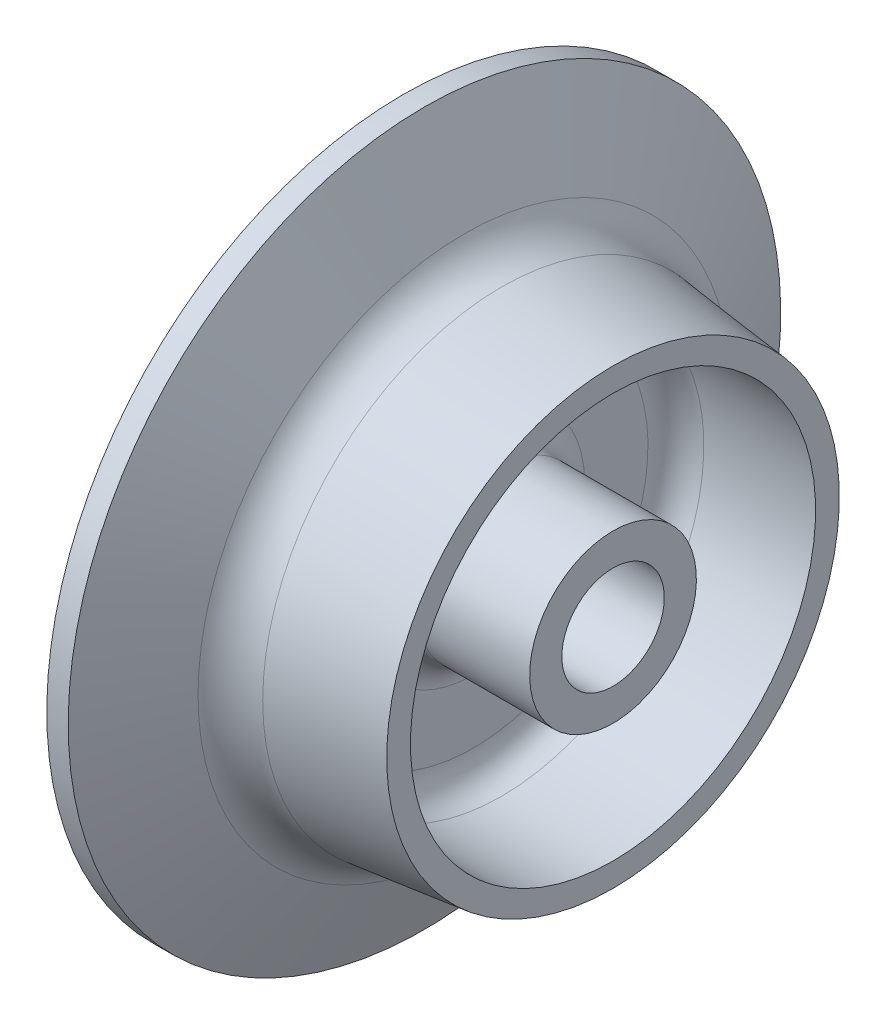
ISO-10303-21;
HEADER;
FILE_DESCRIPTION(('STEP AP214'),'2;1');
FILE_NAME('part.step','',(''),(''),'','','');
FILE_SCHEMA(('AUTOMOTIVE_DESIGN { 1 0 10303 214 1 1 1 1 }'));
ENDSEC;
DATA;
#1=APPLICATION_CONTEXT('core data for automotive mechanical design processes');
#2=APPLICATION_PROTOCOL_DEFINITION('international standard','automotive_design',2000,#1);
#3=PRODUCT_CONTEXT('',#1,'mechanical');
#4=PRODUCT('Part','Part','',(#3));
#5=PRODUCT_RELATED_PRODUCT_CATEGORY('part','',(#4));
#6=PRODUCT_DEFINITION_FORMATION('','',#4);
#7=PRODUCT_DEFINITION_CONTEXT('part definition',#1,'design');
#8=PRODUCT_DEFINITION('design','',#6,#7);
#9=PRODUCT_DEFINITION_SHAPE('','',#8);
#10=(LENGTH_UNIT() NAMED_UNIT(*) SI_UNIT(.MILLI.,.METRE.));
#11=(NAMED_UNIT(*) PLANE_ANGLE_UNIT() SI_UNIT($,.RADIAN.));
#12=(NAMED_UNIT(*) SI_UNIT($,.STERADIAN.) SOLID_ANGLE_UNIT());
#13=UNCERTAINTY_MEASURE_WITH_UNIT(LENGTH_MEASURE(1.E-05),#10,'distance_accuracy_value','');
#14=(GEOMETRIC_REPRESENTATION_CONTEXT(3) GLOBAL_UNCERTAINTY_ASSIGNED_CONTEXT((#13)) GLOBAL_UNIT_ASSIGNED_CONTEXT((#10,
#11,#12)) REPRESENTATION_CONTEXT('',''));
#15=CARTESIAN_POINT('',(0.,0.,0.));
#16=DIRECTION('',(0.,0.,1.));
#17=DIRECTION('',(1.,0.,0.));
#18=AXIS2_PLACEMENT_3D('',#15,#16,#17);
#19=CARTESIAN_POINT('',(-22.55,0.,0.));
#20=DIRECTION('',(1.,0.,0.));
#21=DIRECTION('',(0.,1.,0.));
#22=AXIS2_PLACEMENT_3D('',#19,#20,#21);
#23=CYLINDRICAL_SURFACE('',#22,3.2);
#24=CARTESIAN_POINT('',(-14.65,0.,0.));
#25=DIRECTION('',(-1.,0.,0.));
#26=DIRECTION('',(0.,-1.,0.));
#27=AXIS2_PLACEMENT_3D('',#24,#25,#26);
#28=CIRCLE('',#27,3.2);
#29=CARTESIAN_POINT('',(-14.65,-3.2,0.));
#30=VERTEX_POINT('',#29);
#31=EDGE_CURVE('E617',#30,#30,#28,.T.);
#32=ORIENTED_EDGE('',*,*,#31,.T.);
#33=EDGE_LOOP('',(#32));
#34=FACE_BOUND('',#33,.T.);
#35=CARTESIAN_POINT('',(-12.4,0.,0.));
#36=DIRECTION('',(1.,0.,0.));
#37=DIRECTION('',(0.,1.,0.));
#38=AXIS2_PLACEMENT_3D('',#35,#36,#37);
#39=CIRCLE('',#38,3.2);
#40=CARTESIAN_POINT('',(-12.4,3.2,0.));
#41=VERTEX_POINT('',#40);
#42=EDGE_CURVE('E38',#41,#41,#39,.F.);
#43=ORIENTED_EDGE('',*,*,#42,.F.);
#44=EDGE_LOOP('',(#43));
#45=FACE_BOUND('',#44,.T.);
#46=ADVANCED_FACE('F34',(#34,#45),#23,.F.);
#47=CARTESIAN_POINT('',(-22.55,36.5,0.));
#48=DIRECTION('',(-1.,0.,0.));
#49=DIRECTION('',(0.,-1.,0.));
#50=AXIS2_PLACEMENT_3D('',#47,#48,#49);
#51=PLANE('',#50);
#52=CARTESIAN_POINT('',(-22.55,0.,0.));
#53=DIRECTION('',(1.,0.,0.));
#54=DIRECTION('',(0.,1.,0.));
#55=AXIS2_PLACEMENT_3D('',#52,#53,#54);
#56=CIRCLE('',#55,36.5);
#57=CARTESIAN_POINT('',(-22.55,36.5,0.));
#58=VERTEX_POINT('',#57);
#59=EDGE_CURVE('E631',#58,#58,#56,.T.);
#60=ORIENTED_EDGE('',*,*,#59,.T.);
#61=EDGE_LOOP('',(#60));
#62=FACE_BOUND('',#61,.T.);
#63=CARTESIAN_POINT('',(-22.55,0.,0.));
#64=DIRECTION('',(1.,0.,0.));
#65=DIRECTION('',(0.,1.,0.));
#66=AXIS2_PLACEMENT_3D('',#63,#64,#65);
#67=CIRCLE('',#66,38.25);
#68=CARTESIAN_POINT('',(-22.55,38.25,0.));
#69=VERTEX_POINT('',#68);
#70=EDGE_CURVE('E682',#69,#69,#67,.T.);
#71=ORIENTED_EDGE('',*,*,#70,.F.);
#72=EDGE_LOOP('',(#71));
#73=FACE_BOUND('',#72,.T.);
#74=ADVANCED_FACE('F36',(#62,#73),#51,.T.);
#75=CARTESIAN_POINT('',(14.65,0.,0.));
#76=DIRECTION('',(1.,0.,0.));
#77=DIRECTION('',(0.,1.,0.));
#78=AXIS2_PLACEMENT_3D('',#75,#76,#77);
#79=CYLINDRICAL_SURFACE('',#78,38.25);
#80=ORIENTED_EDGE('',*,*,#70,.T.);
#81=EDGE_LOOP('',(#80));
#82=FACE_BOUND('',#81,.T.);
#83=CARTESIAN_POINT('',(-20.25,0.,0.));
#84=DIRECTION('',(1.,0.,0.));
#85=DIRECTION('',(0.,1.,0.));
#86=AXIS2_PLACEMENT_3D('',#83,#84,#85);
#87=CIRCLE('',#86,38.25);
#88=CARTESIAN_POINT('',(-20.25,38.25,0.));
#89=VERTEX_POINT('',#88);
#90=EDGE_CURVE('E679',#89,#89,#87,.T.);
#91=ORIENTED_EDGE('',*,*,#90,.F.);
#92=EDGE_LOOP('',(#91));
#93=FACE_BOUND('',#92,.T.);
#94=ADVANCED_FACE('F1036',(#82,#93),#79,.T.);
#95=CARTESIAN_POINT('',(-15.9646179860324,0.,0.));
#96=DIRECTION('',(-1.,0.,0.));
#97=DIRECTION('',(0.,-1.,0.));
#98=AXIS2_PLACEMENT_3D('',#95,#96,#97);
#99=CONICAL_SURFACE('',#98,28.596117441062,1.15302469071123);
#100=ORIENTED_EDGE('',*,*,#90,.T.);
#101=EDGE_LOOP('',(#100));
#102=FACE_BOUND('',#101,.T.);
#103=CARTESIAN_POINT('',(-15.9646179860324,0.,0.));
#104=DIRECTION('',(1.,0.,0.));
#105=DIRECTION('',(0.,1.,0.));
#106=AXIS2_PLACEMENT_3D('',#103,#104,#105);
#107=CIRCLE('',#106,28.596117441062);
#108=CARTESIAN_POINT('',(-15.9646179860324,28.596117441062,0.));
#109=VERTEX_POINT('',#108);
#110=EDGE_CURVE('E676',#109,#109,#107,.T.);
#111=ORIENTED_EDGE('',*,*,#110,.F.);
#112=EDGE_LOOP('',(#111));
#113=FACE_BOUND('',#112,.T.);
#114=ADVANCED_FACE('F1099',(#102,#113),#99,.T.);
#115=CARTESIAN_POINT('',(-11.3946414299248,0.,0.));
#116=DIRECTION('',(1.,0.,0.));
#117=DIRECTION('',(0.,1.,0.));
#118=AXIS2_PLACEMENT_3D('',#115,#116,#117);
#119=TOROIDAL_SURFACE('',#118,30.6247411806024,4.99999999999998);
#120=ORIENTED_EDGE('',*,*,#110,.T.);
#121=EDGE_LOOP('',(#120));
#122=FACE_BOUND('',#121,.T.);
#123=CARTESIAN_POINT('',(-11.9582531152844,0.,0.));
#124=DIRECTION('',(1.,0.,0.));
#125=DIRECTION('',(0.,1.,0.));
#126=AXIS2_PLACEMENT_3D('',#123,#124,#125);
#127=CIRCLE('',#126,25.6566085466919);
#128=CARTESIAN_POINT('',(-11.9582531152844,25.6566085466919,0.));
#129=VERTEX_POINT('',#128);
#130=EDGE_CURVE('E673',#129,#129,#127,.T.);
#131=ORIENTED_EDGE('',*,*,#130,.F.);
#132=EDGE_LOOP('',(#131));
#133=FACE_BOUND('',#132,.T.);
#134=ADVANCED_FACE('F1095',(#122,#133),#119,.F.);
#135=CARTESIAN_POINT('',(0.,0.,0.));
#136=DIRECTION('',(-1.,0.,0.));
#137=DIRECTION('',(0.,-1.,0.));
#138=AXIS2_PLACEMENT_3D('',#135,#136,#137);
#139=CONICAL_SURFACE('',#138,24.3,0.11296242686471);
#140=ORIENTED_EDGE('',*,*,#130,.T.);
#141=EDGE_LOOP('',(#140));
#142=FACE_BOUND('',#141,.T.);
#143=CARTESIAN_POINT('',(0.,0.,0.));
#144=DIRECTION('',(1.,0.,0.));
#145=DIRECTION('',(0.,1.,0.));
#146=AXIS2_PLACEMENT_3D('',#143,#144,#145);
#147=CIRCLE('',#146,24.3);
#148=CARTESIAN_POINT('',(0.,24.3,0.));
#149=VERTEX_POINT('',#148);
#150=EDGE_CURVE('E670',#149,#149,#147,.T.);
#151=ORIENTED_EDGE('',*,*,#150,.F.);
#152=EDGE_LOOP('',(#151));
#153=FACE_BOUND('',#152,.T.);
#154=ADVANCED_FACE('F1091',(#142,#153),#139,.T.);
#155=CARTESIAN_POINT('',(0.,24.3,0.));
#156=DIRECTION('',(1.,0.,0.));
#157=DIRECTION('',(0.,1.,0.));
#158=AXIS2_PLACEMENT_3D('',#155,#156,#157);
#159=PLANE('',#158);
#160=ORIENTED_EDGE('',*,*,#150,.T.);
#161=EDGE_LOOP('',(#160));
#162=FACE_BOUND('',#161,.T.);
#163=CARTESIAN_POINT('',(0.,0.,0.));
#164=DIRECTION('',(1.,0.,0.));
#165=DIRECTION('',(0.,1.,0.));
#166=AXIS2_PLACEMENT_3D('',#163,#164,#165);
#167=CIRCLE('',#166,21.75);
#168=CARTESIAN_POINT('',(0.,21.75,0.));
#169=VERTEX_POINT('',#168);
#170=EDGE_CURVE('E667',#169,#169,#167,.T.);
#171=ORIENTED_EDGE('',*,*,#170,.F.);
#172=EDGE_LOOP('',(#171));
#173=FACE_BOUND('',#172,.T.);
#174=ADVANCED_FACE('F1087',(#162,#173),#159,.T.);
#175=CARTESIAN_POINT('',(14.65,0.,0.));
#176=DIRECTION('',(1.,0.,0.));
#177=DIRECTION('',(0.,1.,0.));
#178=AXIS2_PLACEMENT_3D('',#175,#176,#177);
#179=CYLINDRICAL_SURFACE('',#178,21.75);
#180=ORIENTED_EDGE('',*,*,#170,.T.);
#181=EDGE_LOOP('',(#180));
#182=FACE_BOUND('',#181,.T.);
#183=CARTESIAN_POINT('',(-12.,0.,0.));
#184=DIRECTION('',(1.,0.,0.));
#185=DIRECTION('',(0.,1.,0.));
#186=AXIS2_PLACEMENT_3D('',#183,#184,#185);
#187=CIRCLE('',#186,21.75);
#188=CARTESIAN_POINT('',(-12.,21.75,0.));
#189=VERTEX_POINT('',#188);
#190=EDGE_CURVE('E664',#189,#189,#187,.T.);
#191=ORIENTED_EDGE('',*,*,#190,.F.);
#192=EDGE_LOOP('',(#191));
#193=FACE_BOUND('',#192,.T.);
#194=ADVANCED_FACE('F1083',(#182,#193),#179,.F.);
#195=CARTESIAN_POINT('',(-12.,0.,0.));
#196=DIRECTION('',(1.,0.,0.));
#197=DIRECTION('',(0.,1.,0.));
#198=AXIS2_PLACEMENT_3D('',#195,#196,#197);
#199=TOROIDAL_SURFACE('',#198,18.75,3.);
#200=ORIENTED_EDGE('',*,*,#190,.T.);
#201=EDGE_LOOP('',(#200));
#202=FACE_BOUND('',#201,.T.);
#203=CARTESIAN_POINT('',(-15.,0.,0.));
#204=DIRECTION('',(1.,0.,0.));
#205=DIRECTION('',(0.,1.,0.));
#206=AXIS2_PLACEMENT_3D('',#203,#204,#205);
#207=CIRCLE('',#206,18.75);
#208=CARTESIAN_POINT('',(-15.,18.75,0.));
#209=VERTEX_POINT('',#208);
#210=EDGE_CURVE('E661',#209,#209,#207,.T.);
#211=ORIENTED_EDGE('',*,*,#210,.F.);
#212=EDGE_LOOP('',(#211));
#213=FACE_BOUND('',#212,.T.);
#214=ADVANCED_FACE('F1079',(#202,#213),#199,.F.);
#215=CARTESIAN_POINT('',(-15.,18.75,0.));
#216=DIRECTION('',(1.,0.,0.));
#217=DIRECTION('',(0.,1.,0.));
#218=AXIS2_PLACEMENT_3D('',#215,#216,#217);
#219=PLANE('',#218);
#220=ORIENTED_EDGE('',*,*,#210,.T.);
#221=EDGE_LOOP('',(#220));
#222=FACE_BOUND('',#221,.T.);
#223=CARTESIAN_POINT('',(-15.,0.,0.));
#224=DIRECTION('',(1.,0.,0.));
#225=DIRECTION('',(0.,1.,0.));
#226=AXIS2_PLACEMENT_3D('',#223,#224,#225);
#227=CIRCLE('',#226,11.95);
#228=CARTESIAN_POINT('',(-15.,11.95,0.));
#229=VERTEX_POINT('',#228);
#230=EDGE_CURVE('E658',#229,#229,#227,.T.);
#231=ORIENTED_EDGE('',*,*,#230,.F.);
#232=EDGE_LOOP('',(#231));
#233=FACE_BOUND('',#232,.T.);
#234=ADVANCED_FACE('F1073',(#222,#233),#219,.T.);
#235=CARTESIAN_POINT('',(-12.,0.,0.));
#236=DIRECTION('',(1.,0.,0.));
#237=DIRECTION('',(0.,1.,0.));
#238=AXIS2_PLACEMENT_3D('',#235,#236,#237);
#239=TOROIDAL_SURFACE('',#238,11.95,3.);
#240=ORIENTED_EDGE('',*,*,#230,.T.);
#241=EDGE_LOOP('',(#240));
#242=FACE_BOUND('',#241,.T.);
#243=CARTESIAN_POINT('',(-12.,0.,0.));
#244=DIRECTION('',(1.,0.,0.));
#245=DIRECTION('',(0.,1.,0.));
#246=AXIS2_PLACEMENT_3D('',#243,#244,#245);
#247=CIRCLE('',#246,8.95);
#248=CARTESIAN_POINT('',(-12.,8.95,0.));
#249=VERTEX_POINT('',#248);
#250=EDGE_CURVE('E655',#249,#249,#247,.T.);
#251=ORIENTED_EDGE('',*,*,#250,.F.);
#252=EDGE_LOOP('',(#251));
#253=FACE_BOUND('',#252,.T.);
#254=ADVANCED_FACE('F1067',(#242,#253),#239,.F.);
#255=CARTESIAN_POINT('',(14.65,0.,0.));
#256=DIRECTION('',(1.,0.,0.));
#257=DIRECTION('',(0.,1.,0.));
#258=AXIS2_PLACEMENT_3D('',#255,#256,#257);
#259=CYLINDRICAL_SURFACE('',#258,8.95);
#260=ORIENTED_EDGE('',*,*,#250,.T.);
#261=EDGE_LOOP('',(#260));
#262=FACE_BOUND('',#261,.T.);
#263=CARTESIAN_POINT('',(0.,0.,0.));
#264=DIRECTION('',(1.,0.,0.));
#265=DIRECTION('',(0.,1.,0.));
#266=AXIS2_PLACEMENT_3D('',#263,#264,#265);
#267=CIRCLE('',#266,8.95);
#268=CARTESIAN_POINT('',(0.,8.95,0.));
#269=VERTEX_POINT('',#268);
#270=EDGE_CURVE('E652',#269,#269,#267,.T.);
#271=ORIENTED_EDGE('',*,*,#270,.F.);
#272=EDGE_LOOP('',(#271));
#273=FACE_BOUND('',#272,.T.);
#274=ADVANCED_FACE('F1062',(#262,#273),#259,.T.);
#275=CARTESIAN_POINT('',(0.,8.95,0.));
#276=DIRECTION('',(1.,0.,0.));
#277=DIRECTION('',(0.,1.,0.));
#278=AXIS2_PLACEMENT_3D('',#275,#276,#277);
#279=PLANE('',#278);
#280=CARTESIAN_POINT('',(0.,0.,0.));
#281=DIRECTION('',(1.,0.,0.));
#282=DIRECTION('',(0.,1.,0.));
#283=AXIS2_PLACEMENT_3D('',#280,#281,#282);
#284=CIRCLE('',#283,5.5);
#285=CARTESIAN_POINT('',(0.,5.5,0.));
#286=VERTEX_POINT('',#285);
#287=EDGE_CURVE('E364',#286,#286,#284,.T.);
#288=ORIENTED_EDGE('',*,*,#287,.F.);
#289=EDGE_LOOP('',(#288));
#290=FACE_BOUND('',#289,.T.);
#291=ORIENTED_EDGE('',*,*,#270,.T.);
#292=EDGE_LOOP('',(#291));
#293=FACE_BOUND('',#292,.T.);
#294=ADVANCED_FACE('F1058',(#290,#293),#279,.T.);
#295=CARTESIAN_POINT('',(-14.65,0.,0.));
#296=DIRECTION('',(-1.,0.,0.));
#297=DIRECTION('',(0.,-1.,0.));
#298=AXIS2_PLACEMENT_3D('',#295,#296,#297);
#299=PLANE('',#298);
#300=ORIENTED_EDGE('',*,*,#31,.F.);
#301=EDGE_LOOP('',(#300));
#302=FACE_BOUND('',#301,.T.);
#303=CARTESIAN_POINT('',(-14.65,0.,0.));
#304=DIRECTION('',(1.,0.,0.));
#305=DIRECTION('',(0.,1.,0.));
#306=AXIS2_PLACEMENT_3D('',#303,#304,#305);
#307=CIRCLE('',#306,7.5);
#308=CARTESIAN_POINT('',(-14.65,7.5,0.));
#309=VERTEX_POINT('',#308);
#310=EDGE_CURVE('E649',#309,#309,#307,.T.);
#311=ORIENTED_EDGE('',*,*,#310,.F.);
#312=EDGE_LOOP('',(#311));
#313=FACE_BOUND('',#312,.T.);
#314=ADVANCED_FACE('F1061',(#302,#313),#299,.T.);
#315=CARTESIAN_POINT('',(-22.05,0.,0.));
#316=DIRECTION('',(-1.,0.,0.));
#317=DIRECTION('',(0.,-1.,0.));
#318=AXIS2_PLACEMENT_3D('',#315,#316,#317);
#319=CONICAL_SURFACE('',#318,29.,1.23931033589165);
#320=CARTESIAN_POINT('',(-17.6106206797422,13.1777297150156,9.25286495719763));
#321=CARTESIAN_POINT('',(-17.5817627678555,13.0985194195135,9.21976154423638));
#322=CARTESIAN_POINT('',(-17.5531681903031,13.0178460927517,9.1900350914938));
#323=CARTESIAN_POINT('',(-17.4967075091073,12.8539979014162,9.13754972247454));
#324=CARTESIAN_POINT('',(-17.4688415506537,12.7708225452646,9.11479218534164));
#325=CARTESIAN_POINT('',(-17.3865804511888,12.5179948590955,9.05725804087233));
#326=CARTESIAN_POINT('',(-17.3336033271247,12.3452631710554,9.03331301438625));
#327=CARTESIAN_POINT('',(-17.2335385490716,11.9963001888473,9.01581885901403));
#328=CARTESIAN_POINT('',(-17.1864610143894,11.8200634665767,9.02232124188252));
#329=CARTESIAN_POINT('',(-17.1005561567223,11.4696260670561,9.06661372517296));
#330=CARTESIAN_POINT('',(-17.0617192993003,11.2954232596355,9.10436741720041));
#331=CARTESIAN_POINT('',(-16.9961116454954,10.9628906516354,9.20840154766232));
#332=CARTESIAN_POINT('',(-16.968848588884,10.8042005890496,9.27321579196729));
#333=CARTESIAN_POINT('',(-16.9254652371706,10.499006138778,9.42977871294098));
#334=CARTESIAN_POINT('',(-16.9093421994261,10.3524987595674,9.52152075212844));
#335=CARTESIAN_POINT('',(-16.8900538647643,10.0865711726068,9.72201648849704));
#336=CARTESIAN_POINT('',(-16.8860615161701,9.96597335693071,9.82913258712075));
#337=CARTESIAN_POINT('',(-16.8889262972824,9.74358628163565,10.0612136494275));
#338=CARTESIAN_POINT('',(-16.8957805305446,9.64179200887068,10.1861738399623));
#339=CARTESIAN_POINT('',(-16.9195400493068,9.46258209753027,10.4461283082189));
#340=CARTESIAN_POINT('',(-16.9361419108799,9.38453420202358,10.5807162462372));
#341=CARTESIAN_POINT('',(-16.9782171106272,9.25054195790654,10.8591515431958));
#342=CARTESIAN_POINT('',(-17.0036907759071,9.1945984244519,11.0029992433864));
#343=CARTESIAN_POINT('',(-17.0631450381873,9.10427760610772,11.3005885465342));
#344=CARTESIAN_POINT('',(-17.0973622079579,9.07061303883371,11.4544982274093));
#345=CARTESIAN_POINT('',(-17.1723516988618,9.02772330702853,11.7641779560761));
#346=CARTESIAN_POINT('',(-17.2131287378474,9.01851581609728,11.9199492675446));
#347=CARTESIAN_POINT('',(-17.3025833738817,9.02427382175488,12.2400779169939));
#348=CARTESIAN_POINT('',(-17.351608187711,9.0409099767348,12.4043065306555));
#349=CARTESIAN_POINT('',(-17.4534903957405,9.10039725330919,12.7264451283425));
#350=CARTESIAN_POINT('',(-17.5063412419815,9.14320447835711,12.8843652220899));
#351=CARTESIAN_POINT('',(-17.5769640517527,9.21530310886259,13.0846044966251));
#352=CARTESIAN_POINT('',(-17.593753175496,9.23350985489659,13.1314350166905));
#353=CARTESIAN_POINT('',(-17.6106206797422,9.25286495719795,13.1777297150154));
#354=B_SPLINE_CURVE_WITH_KNOTS('',3,(#320,#321,#322,#323,#324,#325,#326,#327,#328,#329,#330,
#331,#332,#333,#334,#335,#336,#337,#338,#339,#340,#341,#342,#343,#344,#345,#346,#347,#348,#349,
#350,#351,#352,#353),.UNSPECIFIED.,.F.,.F.,(4,2,2,2,2,2,2,2,2,2,2,2,2,2,2,2,4),(0.,
0.271554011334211,0.543161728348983,1.08713077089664,1.63202044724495,2.17627620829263,
2.69423972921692,3.21207568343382,3.69371089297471,4.17521750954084,4.64247579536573,
5.10975131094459,5.59133306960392,6.0732627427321,6.58766635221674,7.1012095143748,
7.26006931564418),.UNSPECIFIED.);
#355=CARTESIAN_POINT('',(-17.6105478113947,13.1775297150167,9.252781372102));
#356=VERTEX_POINT('',#355);
#357=CARTESIAN_POINT('',(-17.6105478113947,9.25278137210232,13.1775297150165));
#358=VERTEX_POINT('',#357);
#359=EDGE_CURVE('E11',#356,#358,#354,.T.);
#360=ORIENTED_EDGE('',*,*,#359,.F.);
#361=CARTESIAN_POINT('',(-20.4661215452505,20.9519121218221,12.5015639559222));
#362=CARTESIAN_POINT('',(-20.2270189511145,20.3043846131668,12.2309731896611));
#363=CARTESIAN_POINT('',(-19.9880893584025,19.6568026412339,11.9603596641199));
#364=CARTESIAN_POINT('',(-19.5107249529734,18.361484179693,11.4190680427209));
#365=CARTESIAN_POINT('',(-19.2722901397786,17.7137476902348,11.1483899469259));
#366=CARTESIAN_POINT('',(-18.79606347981,16.418073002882,10.6069494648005));
#367=CARTESIAN_POINT('',(-18.5582716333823,15.770134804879,10.3361870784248));
#368=CARTESIAN_POINT('',(-18.0836109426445,14.4739700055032,9.79454178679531));
#369=CARTESIAN_POINT('',(-17.8467420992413,13.8257434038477,9.52365888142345));
#370=CARTESIAN_POINT('',(-17.6104749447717,13.1773297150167,9.25269779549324));
#371=B_SPLINE_CURVE_WITH_KNOTS('',3,(#361,#362,#363,#364,#365,#366,#367,#368,#369,#370),
.UNSPECIFIED.,.F.,.F.,(4,2,2,2,4),(0.,2.22421490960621,4.44842767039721,6.67264162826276,
8.89685777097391),.UNSPECIFIED.);
#372=CARTESIAN_POINT('',(-20.4660476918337,20.9517121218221,12.5014803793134));
#373=VERTEX_POINT('',#372);
#374=EDGE_CURVE('E43',#373,#356,#371,.T.);
#375=ORIENTED_EDGE('',*,*,#374,.F.);
#376=CARTESIAN_POINT('',(-21.7058139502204,22.1702431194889,17.1020560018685));
#377=CARTESIAN_POINT('',(-21.7058184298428,22.2201032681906,17.0374461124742));
#378=CARTESIAN_POINT('',(-21.7047947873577,22.2673081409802,16.9707937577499));
#379=CARTESIAN_POINT('',(-21.7007097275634,22.3561051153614,16.833920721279));
#380=CARTESIAN_POINT('',(-21.6976485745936,22.3976979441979,16.7637005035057));
#381=CARTESIAN_POINT('',(-21.6895144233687,22.4749108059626,16.6203229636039));
#382=CARTESIAN_POINT('',(-21.6844451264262,22.5105416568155,16.5471712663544));
#383=CARTESIAN_POINT('',(-21.6723356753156,22.5756944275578,16.3983772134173));
#384=CARTESIAN_POINT('',(-21.6652955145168,22.6052163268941,16.322734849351));
#385=CARTESIAN_POINT('',(-21.6412822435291,22.6843350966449,16.0928743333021));
#386=CARTESIAN_POINT('',(-21.6214095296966,22.7245491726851,15.9356031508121));
#387=CARTESIAN_POINT('',(-21.5744982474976,22.7790820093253,15.6177781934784));
#388=CARTESIAN_POINT('',(-21.5474589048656,22.7933979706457,15.4572240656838));
#389=CARTESIAN_POINT('',(-21.4863703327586,22.7963685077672,15.1342832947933));
#390=CARTESIAN_POINT('',(-21.4522060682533,22.7845668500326,14.971914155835));
#391=CARTESIAN_POINT('',(-21.3780284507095,22.7353083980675,14.6524971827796));
#392=CARTESIAN_POINT('',(-21.3380136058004,22.6978450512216,14.4954507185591));
#393=CARTESIAN_POINT('',(-21.2513007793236,22.5967678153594,14.1841737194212));
#394=CARTESIAN_POINT('',(-21.2043932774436,22.5321257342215,14.0303356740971));
#395=CARTESIAN_POINT('',(-21.1063801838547,22.3790242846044,13.7364531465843));
#396=CARTESIAN_POINT('',(-21.0552732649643,22.2905573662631,13.5964130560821));
#397=CARTESIAN_POINT('',(-20.947601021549,22.0879261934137,13.3273091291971));
#398=CARTESIAN_POINT('',(-20.8908923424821,21.9727571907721,13.1990600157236));
#399=CARTESIAN_POINT('',(-20.7756002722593,21.7227705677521,12.9645138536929));
#400=CARTESIAN_POINT('',(-20.7170180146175,21.5879646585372,12.8582038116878));
#401=CARTESIAN_POINT('',(-20.626140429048,21.3672426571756,12.7127969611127));
#402=CARTESIAN_POINT('',(-20.5939568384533,21.2868376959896,12.665066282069));
#403=CARTESIAN_POINT('',(-20.5297813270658,21.1220468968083,12.5773724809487));
#404=CARTESIAN_POINT('',(-20.497789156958,21.0376689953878,12.5373946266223));
#405=CARTESIAN_POINT('',(-20.4659738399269,20.9515121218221,12.5013968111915));
#406=B_SPLINE_CURVE_WITH_KNOTS('',3,(#376,#377,#378,#379,#380,#381,#382,#383,#384,#385,#386,
#387,#388,#389,#390,#391,#392,#393,#394,#395,#396,#397,#398,#399,#400,#401,#402,#403,#404,#405),
.UNSPECIFIED.,.F.,.F.,(4,2,2,2,2,2,2,2,2,2,2,2,2,2,4),(0.,0.244751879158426,0.48947201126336,
0.733743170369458,0.978015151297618,1.46615659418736,1.9543507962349,2.45114017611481,
2.94805645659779,3.46575586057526,3.98361951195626,4.52559672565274,5.06725202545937,
5.36357569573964,5.65933063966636),.UNSPECIFIED.);
#407=CARTESIAN_POINT('',(-21.7058139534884,22.1703974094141,17.1018560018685));
#408=VERTEX_POINT('',#407);
#409=EDGE_CURVE('E1010',#408,#373,#406,.T.);
#410=ORIENTED_EDGE('',*,*,#409,.F.);
#411=CARTESIAN_POINT('',(-21.7058139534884,0.,0.));
#412=DIRECTION('',(-1.,0.,0.));
#413=DIRECTION('',(0.,-1.,0.));
#414=AXIS2_PLACEMENT_3D('',#411,#412,#413);
#415=CIRCLE('',#414,28.);
#416=CARTESIAN_POINT('',(-21.7058139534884,17.101856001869,22.1703974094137));
#417=VERTEX_POINT('',#416);
#418=EDGE_CURVE('E1837',#417,#408,#415,.T.);
#419=ORIENTED_EDGE('',*,*,#418,.F.);
#420=CARTESIAN_POINT('',(-20.4659738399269,12.501396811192,20.9515121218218));
#421=CARTESIAN_POINT('',(-20.4962625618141,12.5356694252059,21.0335346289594));
#422=CARTESIAN_POINT('',(-20.5267098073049,12.5735436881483,21.1139408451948));
#423=CARTESIAN_POINT('',(-20.5877324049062,12.6562439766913,21.2710430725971));
#424=CARTESIAN_POINT('',(-20.6183077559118,12.7010699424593,21.3477391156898));
#425=CARTESIAN_POINT('',(-20.7099144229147,12.8455534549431,21.5714769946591));
#426=CARTESIAN_POINT('',(-20.7708553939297,12.9552495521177,21.7122471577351));
#427=CARTESIAN_POINT('',(-20.8907315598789,13.1983593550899,21.9726345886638));
#428=CARTESIAN_POINT('',(-20.9496654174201,13.3317885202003,22.0922379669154));
#429=CARTESIAN_POINT('',(-21.0639232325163,13.6187624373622,22.3063776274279));
#430=CARTESIAN_POINT('',(-21.11924878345,13.772298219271,22.4009250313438));
#431=CARTESIAN_POINT('',(-21.2238958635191,14.0925163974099,22.5601585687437));
#432=CARTESIAN_POINT('',(-21.2733029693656,14.2589331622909,22.6253217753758));
#433=CARTESIAN_POINT('',(-21.3658022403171,14.6023420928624,22.7253284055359));
#434=CARTESIAN_POINT('',(-21.4088952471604,14.7793328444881,22.7601758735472));
#435=CARTESIAN_POINT('',(-21.4857658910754,15.1305189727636,22.7967447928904));
#436=CARTESIAN_POINT('',(-21.5198678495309,15.3044995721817,22.7998447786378));
#437=CARTESIAN_POINT('',(-21.5801359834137,15.6517963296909,22.7756236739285));
#438=CARTESIAN_POINT('',(-21.6063017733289,15.8251124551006,22.7483011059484));
#439=CARTESIAN_POINT('',(-21.6488591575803,16.1573853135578,22.6654782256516));
#440=CARTESIAN_POINT('',(-21.6656489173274,16.3166349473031,22.6113482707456));
#441=CARTESIAN_POINT('',(-21.6907483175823,16.6242079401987,22.4769457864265));
#442=CARTESIAN_POINT('',(-21.6990755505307,16.7725533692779,22.3967279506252));
#443=CARTESIAN_POINT('',(-21.7039813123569,16.9453885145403,22.2835629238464));
#444=CARTESIAN_POINT('',(-21.704669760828,16.9773550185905,22.2617333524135));
#445=CARTESIAN_POINT('',(-21.7055859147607,17.0403798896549,22.2168816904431));
#446=CARTESIAN_POINT('',(-21.7058142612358,17.0714394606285,22.1938613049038));
#447=CARTESIAN_POINT('',(-21.7058139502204,17.102056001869,22.1702431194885));
#448=B_SPLINE_CURVE_WITH_KNOTS('',3,(#420,#421,#422,#423,#424,#425,#426,#427,#428,#429,#430,
#431,#432,#433,#434,#435,#436,#437,#438,#439,#440,#441,#442,#443,#444,#445,#446,#447),
.UNSPECIFIED.,.F.,.F.,(4,2,2,2,2,2,2,2,2,2,2,2,2,4),(0.,0.281565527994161,0.563128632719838,
1.12598819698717,1.68921575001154,2.25219288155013,2.80566791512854,3.35906909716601,
3.88833309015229,4.4176227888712,4.92228304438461,5.42589202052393,5.54202034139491,
5.65798676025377),.UNSPECIFIED.);
#449=CARTESIAN_POINT('',(-20.4660476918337,12.5014803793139,20.9517121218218));
#450=VERTEX_POINT('',#449);
#451=EDGE_CURVE('E985',#450,#417,#448,.T.);
#452=ORIENTED_EDGE('',*,*,#451,.F.);
#453=CARTESIAN_POINT('',(-17.6104749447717,9.25269779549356,13.1773297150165));
#454=CARTESIAN_POINT('',(-17.8467420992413,9.52365888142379,13.8257434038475));
#455=CARTESIAN_POINT('',(-18.0836109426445,9.79454178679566,14.473970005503));
#456=CARTESIAN_POINT('',(-18.5582716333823,10.3361870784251,15.7701348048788));
#457=CARTESIAN_POINT('',(-18.79606347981,10.6069494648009,16.4180730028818));
#458=CARTESIAN_POINT('',(-19.2722901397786,11.1483899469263,17.7137476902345));
#459=CARTESIAN_POINT('',(-19.5107249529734,11.4190680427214,18.3614841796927));
#460=CARTESIAN_POINT('',(-19.9880893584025,11.9603596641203,19.6568026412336));
#461=CARTESIAN_POINT('',(-20.2270189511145,12.2309731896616,20.3043846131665));
#462=CARTESIAN_POINT('',(-20.4661215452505,12.5015639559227,20.9519121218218));
#463=B_SPLINE_CURVE_WITH_KNOTS('',3,(#453,#454,#455,#456,#457,#458,#459,#460,#461,#462),
.UNSPECIFIED.,.F.,.F.,(4,2,2,2,4),(0.,2.22421614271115,4.44843010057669,6.6726428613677,
8.89685777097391),.UNSPECIFIED.);
#464=EDGE_CURVE('E973',#358,#450,#463,.T.);
#465=ORIENTED_EDGE('',*,*,#464,.F.);
#466=EDGE_LOOP('',(#360,#375,#410,#419,#452,#465));
#467=FACE_BOUND('',#466,.T.);
#468=CARTESIAN_POINT('',(-17.6106204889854,2.77529827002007,15.8608250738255));
#469=CARTESIAN_POINT('',(-17.5817625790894,2.74269576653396,15.7814072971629));
#470=CARTESIAN_POINT('',(-17.5531680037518,2.70667087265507,15.7033428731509));
#471=CARTESIAN_POINT('',(-17.4967073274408,2.62792543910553,15.5503719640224));
#472=CARTESIAN_POINT('',(-17.4688413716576,2.58520357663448,15.4754661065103));
#473=CARTESIAN_POINT('',(-17.3865802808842,2.44711015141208,15.2560071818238));
#474=CARTESIAN_POINT('',(-17.3336031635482,2.34190207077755,15.1169357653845));
#475=CARTESIAN_POINT('',(-17.2335384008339,2.10751817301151,14.8578114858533));
#476=CARTESIAN_POINT('',(-17.1864608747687,1.9783020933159,14.7377912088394));
#477=CARTESIAN_POINT('',(-17.1005560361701,1.69918588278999,14.5213141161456));
#478=CARTESIAN_POINT('',(-17.0617191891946,1.54930999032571,14.4248300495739));
#479=CARTESIAN_POINT('',(-16.9961115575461,1.24061066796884,14.2632572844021));
#480=CARTESIAN_POINT('',(-16.9688485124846,1.08256925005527,14.196877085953));
#481=CARTESIAN_POINT('',(-16.9254651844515,0.756057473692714,14.0917787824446));
#482=CARTESIAN_POINT('',(-16.9093421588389,0.587589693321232,14.0530538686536));
#483=CARTESIAN_POINT('',(-16.8900538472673,0.257778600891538,14.0067866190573));
#484=CARTESIAN_POINT('',(-16.8860615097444,0.0967605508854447,13.9972536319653));
#485=CARTESIAN_POINT('',(-16.8889263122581,-0.224596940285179,14.004108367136));
#486=CARTESIAN_POINT('',(-16.8957805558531,-0.384936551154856,14.02048916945));
#487=CARTESIAN_POINT('',(-16.9195400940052,-0.695472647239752,14.0775842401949));
#488=CARTESIAN_POINT('',(-16.9361419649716,-0.845828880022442,14.1175641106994));
#489=CARTESIAN_POINT('',(-16.9782171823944,-1.13745917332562,14.2197008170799));
#490=CARTESIAN_POINT('',(-17.0036908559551,-1.27873289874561,14.2818584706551));
#491=CARTESIAN_POINT('',(-17.0631451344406,-1.55302675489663,14.4284194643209));
#492=CARTESIAN_POINT('',(-17.0973623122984,-1.68566176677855,14.5134456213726));
#493=CARTESIAN_POINT('',(-17.1723518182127,-1.93496599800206,14.7020946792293));
#494=CARTESIAN_POINT('',(-17.2131288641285,-2.05162361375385,14.8057309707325));
#495=CARTESIAN_POINT('',(-17.3025835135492,-2.27391719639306,15.0361676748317));
#496=CARTESIAN_POINT('',(-17.3516083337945,-2.37828080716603,15.1640583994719));
#497=CARTESIAN_POINT('',(-17.4534905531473,-2.56400329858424,15.4339086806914));
#498=CARTESIAN_POINT('',(-17.5063414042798,-2.64540036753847,15.5758443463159));
#499=CARTESIAN_POINT('',(-17.5769641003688,-2.73600930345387,15.7684160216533));
#500=CARTESIAN_POINT('',(-17.5937531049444,-2.7562492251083,15.8144039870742));
#501=CARTESIAN_POINT('',(-17.6106204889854,-2.77529827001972,15.8608250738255));
#502=B_SPLINE_CURVE_WITH_KNOTS('',3,(#468,#469,#470,#471,#472,#473,#474,#475,#476,#477,#478,
#479,#480,#481,#482,#483,#484,#485,#486,#487,#488,#489,#490,#491,#492,#493,#494,#495,#496,#497,
#498,#499,#500,#501),.UNSPECIFIED.,.F.,.F.,(4,2,2,2,2,2,2,2,2,2,2,2,2,2,2,2,4),(0.,
0.271554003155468,0.543161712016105,1.08713073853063,1.63202039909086,2.17627614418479,
2.6942396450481,3.21207557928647,3.69371077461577,4.1752173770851,4.64247566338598,
5.10975117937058,5.59133295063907,6.07326263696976,6.58766626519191,7.10120944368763,
7.26006811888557),.UNSPECIFIED.);
#503=CARTESIAN_POINT('',(-17.6105478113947,2.77521616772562,15.8606250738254));
#504=VERTEX_POINT('',#503);
#505=CARTESIAN_POINT('',(-17.6105478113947,-2.77521616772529,15.8606250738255));
#506=VERTEX_POINT('',#505);
#507=EDGE_CURVE('E967',#504,#506,#502,.T.);
#508=ORIENTED_EDGE('',*,*,#507,.F.);
#509=CARTESIAN_POINT('',(-20.4661213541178,5.97529827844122,23.6551792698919));
#510=CARTESIAN_POINT('',(-20.227018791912,5.70876378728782,23.0059716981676));
#511=CARTESIAN_POINT('',(-19.9880892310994,5.44220687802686,22.3567095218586));
#512=CARTESIAN_POINT('',(-19.510724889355,4.90902945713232,21.058030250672));
#513=CARTESIAN_POINT('',(-19.2722901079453,4.64240894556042,20.4086131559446));
#514=CARTESIAN_POINT('',(-18.79606351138,4.10908489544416,19.10957673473));
#515=CARTESIAN_POINT('',(-18.5582716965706,3.84238135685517,18.4599574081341));
#516=CARTESIAN_POINT('',(-18.0836110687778,3.30885556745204,17.1604296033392));
#517=CARTESIAN_POINT('',(-17.8467422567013,3.04203331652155,16.5105211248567));
#518=CARTESIAN_POINT('',(-17.6104751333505,2.77513405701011,15.8604250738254));
#519=B_SPLINE_CURVE_WITH_KNOTS('',3,(#509,#510,#511,#512,#513,#514,#515,#516,#517,#518),
.UNSPECIFIED.,.F.,.F.,(4,2,2,2,4),(0.,2.2242146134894,4.44842707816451,6.67264073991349,
8.89685658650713),.UNSPECIFIED.);
#520=CARTESIAN_POINT('',(-20.4660476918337,5.9752161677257,23.6549792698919));
#521=VERTEX_POINT('',#520);
#522=EDGE_CURVE('E974',#521,#504,#519,.T.);
#523=ORIENTED_EDGE('',*,*,#522,.F.);
#524=CARTESIAN_POINT('',(-21.7058139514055,3.58380000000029,27.7697025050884));
#525=CARTESIAN_POINT('',(-21.7058180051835,3.66474245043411,27.7592714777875));
#526=CARTESIAN_POINT('',(-21.7047939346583,3.74525151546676,27.7455186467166));
#527=CARTESIAN_POINT('',(-21.7007080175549,3.90482388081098,27.7115209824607));
#528=CARTESIAN_POINT('',(-21.6976464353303,3.98388736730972,27.6912769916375));
#529=CARTESIAN_POINT('',(-21.6895114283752,4.13986765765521,27.6444887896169));
#530=CARTESIAN_POINT('',(-21.6844417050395,4.21678813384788,27.6179562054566));
#531=CARTESIAN_POINT('',(-21.6723314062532,4.36807046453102,27.5588102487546));
#532=CARTESIAN_POINT('',(-21.6652908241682,4.44243231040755,27.5261968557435));
#533=CARTESIAN_POINT('',(-21.6412763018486,4.66091193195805,27.4196025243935));
#534=CARTESIAN_POINT('',(-21.6214027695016,4.8005537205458,27.3368282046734));
#535=CARTESIAN_POINT('',(-21.5744899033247,5.06384730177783,27.1506479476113));
#536=CARTESIAN_POINT('',(-21.5474497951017,5.18749736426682,27.0472397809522));
#537=CARTESIAN_POINT('',(-21.4863597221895,5.41794767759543,26.8209825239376));
#538=CARTESIAN_POINT('',(-21.4521947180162,5.52441292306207,26.6978231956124));
#539=CARTESIAN_POINT('',(-21.3780156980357,5.7154394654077,26.4371267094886));
#540=CARTESIAN_POINT('',(-21.3380001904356,5.79999516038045,26.299585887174));
#541=CARTESIAN_POINT('',(-21.2512860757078,5.94862387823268,26.0080044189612));
#542=CARTESIAN_POINT('',(-21.2043779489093,6.01169230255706,25.8535142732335));
#543=CARTESIAN_POINT('',(-21.1063637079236,6.11123405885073,25.5374465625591));
#544=CARTESIAN_POINT('',(-21.0552562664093,6.14769894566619,25.3758667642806));
#545=CARTESIAN_POINT('',(-20.9475830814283,6.194696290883,25.0422982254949));
#546=CARTESIAN_POINT('',(-20.8908739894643,6.20394218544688,24.870175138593));
#547=CARTESIAN_POINT('',(-20.7755812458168,6.19301776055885,24.5275582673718));
#548=CARTESIAN_POINT('',(-20.7169987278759,6.17286491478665,24.3570635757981));
#549=CARTESIAN_POINT('',(-20.6261242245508,6.11960602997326,24.0981813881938));
#550=CARTESIAN_POINT('',(-20.593943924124,6.09650290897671,24.0075853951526));
#551=CARTESIAN_POINT('',(-20.5297749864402,6.04199099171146,23.8290705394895));
#552=CARTESIAN_POINT('',(-20.4977860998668,6.01059822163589,23.7411468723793));
#553=CARTESIAN_POINT('',(-20.4659740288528,5.97513404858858,23.6547792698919));
#554=B_SPLINE_CURVE_WITH_KNOTS('',3,(#524,#525,#526,#527,#528,#529,#530,#531,#532,#533,#534,
#535,#536,#537,#538,#539,#540,#541,#542,#543,#544,#545,#546,#547,#548,#549,#550,#551,#552,#553),
.UNSPECIFIED.,.F.,.F.,(4,2,2,2,2,2,2,2,2,2,2,2,2,2,4),(0.,0.244752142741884,0.489472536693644,
0.733743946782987,0.978016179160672,1.46615810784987,1.95435280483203,2.4511431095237,
2.94806031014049,3.46576098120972,3.98362592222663,4.52560442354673,5.0672609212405,
5.36355438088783,5.65927916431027),.UNSPECIFIED.);
#555=CARTESIAN_POINT('',(-21.7058139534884,3.58400000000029,27.7696766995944));
#556=VERTEX_POINT('',#555);
#557=EDGE_CURVE('E1688',#556,#521,#554,.T.);
#558=ORIENTED_EDGE('',*,*,#557,.F.);
#559=CARTESIAN_POINT('',(-21.7058139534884,0.,0.));
#560=DIRECTION('',(-1.,0.,0.));
#561=DIRECTION('',(0.,-1.,0.));
#562=AXIS2_PLACEMENT_3D('',#559,#560,#561);
#563=CIRCLE('',#562,28.);
#564=CARTESIAN_POINT('',(-21.7058139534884,-3.58399999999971,27.7696766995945));
#565=VERTEX_POINT('',#564);
#566=EDGE_CURVE('E1686',#565,#556,#563,.T.);
#567=ORIENTED_EDGE('',*,*,#566,.F.);
#568=CARTESIAN_POINT('',(-20.4659740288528,-5.97513404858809,23.654779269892));
#569=CARTESIAN_POINT('',(-20.4962627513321,-6.00889830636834,23.7370123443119));
#570=CARTESIAN_POINT('',(-20.5267099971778,-6.03897292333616,23.8206492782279));
#571=CARTESIAN_POINT('',(-20.5877325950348,-6.09158300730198,23.9902152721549));
#572=CARTESIAN_POINT('',(-20.6183079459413,-6.11411853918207,24.076144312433));
#573=CARTESIAN_POINT('',(-20.7099146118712,-6.17015979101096,24.3365161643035));
#574=CARTESIAN_POINT('',(-20.7708555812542,-6.1921324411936,24.5136225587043));
#575=CARTESIAN_POINT('',(-20.8907317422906,-6.20434950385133,24.8696488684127));
#576=CARTESIAN_POINT('',(-20.9496655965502,-6.19457316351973,25.0485698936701));
#577=CARTESIAN_POINT('',(-21.0639234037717,-6.1430715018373,25.4029106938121));
#578=CARTESIAN_POINT('',(-21.1192489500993,-6.10136038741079,25.5783319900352));
#579=CARTESIAN_POINT('',(-21.2238960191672,-5.9875269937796,25.9173555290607));
#580=CARTESIAN_POINT('',(-21.2733031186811,-5.91592988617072,26.0811072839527));
#581=CARTESIAN_POINT('',(-21.3658023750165,-5.74381841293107,26.394649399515));
#582=CARTESIAN_POINT('',(-21.4088953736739,-5.6433079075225,26.5444416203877));
#583=CARTESIAN_POINT('',(-21.4857659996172,-5.4208399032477,26.8186257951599));
#584=CARTESIAN_POINT('',(-21.5198679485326,-5.30000904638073,26.9438406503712));
#585=CARTESIAN_POINT('',(-21.5801360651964,-5.03730621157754,27.1722895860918));
#586=CARTESIAN_POINT('',(-21.6063018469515,-4.89543321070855,27.2755225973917));
#587=CARTESIAN_POINT('',(-21.648859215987,-4.60191615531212,27.4519103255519));
#588=CARTESIAN_POINT('',(-21.6656489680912,-4.45103397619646,27.5262411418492));
#589=CARTESIAN_POINT('',(-21.6907483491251,-4.13851009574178,27.648691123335));
#590=CARTESIAN_POINT('',(-21.6990755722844,-3.97689146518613,27.6968645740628));
#591=CARTESIAN_POINT('',(-21.7039811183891,-3.77466723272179,27.739055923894));
#592=CARTESIAN_POINT('',(-21.7046694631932,-3.73663613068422,27.7462223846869));
#593=CARTESIAN_POINT('',(-21.705585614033,-3.66037291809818,27.7590705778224));
#594=CARTESIAN_POINT('',(-21.7058140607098,-3.62214116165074,27.7647543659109));
#595=CARTESIAN_POINT('',(-21.7058139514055,-3.58379999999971,27.7697025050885));
#596=B_SPLINE_CURVE_WITH_KNOTS('',3,(#568,#569,#570,#571,#572,#573,#574,#575,#576,#577,#578,
#579,#580,#581,#582,#583,#584,#585,#586,#587,#588,#589,#590,#591,#592,#593,#594,#595),
.UNSPECIFIED.,.F.,.F.,(4,2,2,2,2,2,2,2,2,2,2,2,2,4),(0.,0.281565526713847,0.563128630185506,
1.12598819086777,1.68921574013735,2.25219287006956,2.80566789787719,3.35906906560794,
3.88833302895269,4.41762273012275,4.92228302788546,5.42589193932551,5.54199451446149,
5.65793524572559),.UNSPECIFIED.);
#597=CARTESIAN_POINT('',(-20.4660476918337,-5.97521616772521,23.654979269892));
#598=VERTEX_POINT('',#597);
#599=EDGE_CURVE('E946',#598,#565,#596,.T.);
#600=ORIENTED_EDGE('',*,*,#599,.F.);
#601=CARTESIAN_POINT('',(-17.6104751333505,-2.77513405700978,15.8604250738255));
#602=CARTESIAN_POINT('',(-17.8467422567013,-3.0420333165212,16.5105211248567));
#603=CARTESIAN_POINT('',(-18.0836110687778,-3.30885556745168,17.1604296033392));
#604=CARTESIAN_POINT('',(-18.5582716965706,-3.84238135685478,18.4599574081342));
#605=CARTESIAN_POINT('',(-18.79606351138,-4.10908489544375,19.1095767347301));
#606=CARTESIAN_POINT('',(-19.2722901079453,-4.64240894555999,20.4086131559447));
#607=CARTESIAN_POINT('',(-19.510724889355,-4.90902945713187,21.0580302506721));
#608=CARTESIAN_POINT('',(-19.9880892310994,-5.44220687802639,22.3567095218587));
#609=CARTESIAN_POINT('',(-20.227018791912,-5.70876378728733,23.0059716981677));
#610=CARTESIAN_POINT('',(-20.4661213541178,-5.97529827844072,23.655179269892));
#611=B_SPLINE_CURVE_WITH_KNOTS('',3,(#601,#602,#603,#604,#605,#606,#607,#608,#609,#610),
.UNSPECIFIED.,.F.,.F.,(4,2,2,2,4),(0.,2.22421584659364,4.44842950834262,6.67264197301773,
8.89685658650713),.UNSPECIFIED.);
#612=EDGE_CURVE('E934',#506,#598,#611,.T.);
#613=ORIENTED_EDGE('',*,*,#612,.F.);
#614=EDGE_LOOP('',(#508,#523,#558,#567,#600,#613));
#615=FACE_BOUND('',#614,.T.);
#616=CARTESIAN_POINT('',(-17.6106206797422,-9.25286495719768,13.1777297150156));
#617=CARTESIAN_POINT('',(-17.5817627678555,-9.21976154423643,13.0985194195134));
#618=CARTESIAN_POINT('',(-17.5531681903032,-9.19003509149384,13.0178460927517));
#619=CARTESIAN_POINT('',(-17.4967075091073,-9.13754972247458,12.8539979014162));
#620=CARTESIAN_POINT('',(-17.4688415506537,-9.11479218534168,12.7708225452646));
#621=CARTESIAN_POINT('',(-17.3865804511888,-9.05725804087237,12.5179948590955));
#622=CARTESIAN_POINT('',(-17.3336033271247,-9.03331301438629,12.3452631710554));
#623=CARTESIAN_POINT('',(-17.2335385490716,-9.01581885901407,11.9963001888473));
#624=CARTESIAN_POINT('',(-17.1864610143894,-9.02232124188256,11.8200634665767));
#625=CARTESIAN_POINT('',(-17.1005561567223,-9.066613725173,11.4696260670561));
#626=CARTESIAN_POINT('',(-17.0617192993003,-9.10436741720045,11.2954232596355));
#627=CARTESIAN_POINT('',(-16.9961116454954,-9.20840154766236,10.9628906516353));
#628=CARTESIAN_POINT('',(-16.968848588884,-9.27321579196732,10.8042005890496));
#629=CARTESIAN_POINT('',(-16.9254652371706,-9.42977871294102,10.499006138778));
#630=CARTESIAN_POINT('',(-16.9093421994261,-9.52152075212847,10.3524987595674));
#631=CARTESIAN_POINT('',(-16.8900538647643,-9.72201648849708,10.0865711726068));
#632=CARTESIAN_POINT('',(-16.8860615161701,-9.82913258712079,9.96597335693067));
#633=CARTESIAN_POINT('',(-16.8889262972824,-10.0612136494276,9.74358628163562));
#634=CARTESIAN_POINT('',(-16.8957805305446,-10.1861738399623,9.64179200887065));
#635=CARTESIAN_POINT('',(-16.9195400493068,-10.4461283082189,9.46258209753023));
#636=CARTESIAN_POINT('',(-16.9361419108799,-10.5807162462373,9.38453420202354));
#637=CARTESIAN_POINT('',(-16.9782171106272,-10.8591515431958,9.2505419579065));
#638=CARTESIAN_POINT('',(-17.0036907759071,-11.0029992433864,9.19459842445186));
#639=CARTESIAN_POINT('',(-17.0631450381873,-11.3005885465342,9.10427760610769));
#640=CARTESIAN_POINT('',(-17.0973622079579,-11.4544982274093,9.07061303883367));
#641=CARTESIAN_POINT('',(-17.1723516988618,-11.7641779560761,9.02772330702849));
#642=CARTESIAN_POINT('',(-17.2131287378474,-11.9199492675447,9.01851581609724));
#643=CARTESIAN_POINT('',(-17.3025833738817,-12.240077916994,9.02427382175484));
#644=CARTESIAN_POINT('',(-17.351608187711,-12.4043065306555,9.04090997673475));
#645=CARTESIAN_POINT('',(-17.4534903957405,-12.7264451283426,9.10039725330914));
#646=CARTESIAN_POINT('',(-17.5063412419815,-12.8843652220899,9.14320447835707));
#647=CARTESIAN_POINT('',(-17.5769640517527,-13.0846044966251,9.21530310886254));
#648=CARTESIAN_POINT('',(-17.593753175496,-13.1314350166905,9.23350985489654));
#649=CARTESIAN_POINT('',(-17.6106206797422,-13.1777297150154,9.25286495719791));
#650=B_SPLINE_CURVE_WITH_KNOTS('',3,(#616,#617,#618,#619,#620,#621,#622,#623,#624,#625,#626,
#627,#628,#629,#630,#631,#632,#633,#634,#635,#636,#637,#638,#639,#640,#641,#642,#643,#644,#645,
#646,#647,#648,#649),.UNSPECIFIED.,.F.,.F.,(4,2,2,2,2,2,2,2,2,2,2,2,2,2,2,2,4),(0.,
0.27155401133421,0.543161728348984,1.08713077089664,1.63202044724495,2.17627620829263,
2.69423972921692,3.21207568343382,3.69371089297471,4.17521750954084,4.64247579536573,
5.10975131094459,5.59133306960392,6.07326274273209,6.58766635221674,7.10120951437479,
7.26006931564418),.UNSPECIFIED.);
#651=CARTESIAN_POINT('',(-17.6105478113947,-9.25278137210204,13.1775297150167));
#652=VERTEX_POINT('',#651);
#653=CARTESIAN_POINT('',(-17.6105478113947,-13.1775297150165,9.25278137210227));
#654=VERTEX_POINT('',#653);
#655=EDGE_CURVE('E927',#652,#654,#650,.T.);
#656=ORIENTED_EDGE('',*,*,#655,.F.);
#657=CARTESIAN_POINT('',(-20.4661215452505,-12.5015639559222,20.9519121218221));
#658=CARTESIAN_POINT('',(-20.2270189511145,-12.2309731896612,20.3043846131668));
#659=CARTESIAN_POINT('',(-19.9880893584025,-11.9603596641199,19.6568026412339));
#660=CARTESIAN_POINT('',(-19.5107249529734,-11.419068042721,18.3614841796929));
#661=CARTESIAN_POINT('',(-19.2722901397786,-11.148389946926,17.7137476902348));
#662=CARTESIAN_POINT('',(-18.79606347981,-10.6069494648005,16.418073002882));
#663=CARTESIAN_POINT('',(-18.5582716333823,-10.3361870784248,15.770134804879));
#664=CARTESIAN_POINT('',(-18.0836109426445,-9.79454178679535,14.4739700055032));
#665=CARTESIAN_POINT('',(-17.8467420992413,-9.5236588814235,13.8257434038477));
#666=CARTESIAN_POINT('',(-17.6104749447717,-9.25269779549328,13.1773297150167));
#667=B_SPLINE_CURVE_WITH_KNOTS('',3,(#657,#658,#659,#660,#661,#662,#663,#664,#665,#666),
.UNSPECIFIED.,.F.,.F.,(4,2,2,2,4),(0.,2.22421490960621,4.44842767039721,6.67264162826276,
8.89685777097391),.UNSPECIFIED.);
#668=CARTESIAN_POINT('',(-20.4660476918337,-12.5014803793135,20.9517121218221));
#669=VERTEX_POINT('',#668);
#670=EDGE_CURVE('E935',#669,#652,#667,.T.);
#671=ORIENTED_EDGE('',*,*,#670,.F.);
#672=CARTESIAN_POINT('',(-21.7058139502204,-17.1020560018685,22.1702431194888));
#673=CARTESIAN_POINT('',(-21.7058184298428,-17.0374461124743,22.2201032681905));
#674=CARTESIAN_POINT('',(-21.7047947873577,-16.97079375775,22.2673081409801));
#675=CARTESIAN_POINT('',(-21.7007097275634,-16.833920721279,22.3561051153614));
#676=CARTESIAN_POINT('',(-21.6976485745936,-16.7637005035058,22.3976979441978));
#677=CARTESIAN_POINT('',(-21.6895144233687,-16.6203229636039,22.4749108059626));
#678=CARTESIAN_POINT('',(-21.6844451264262,-16.5471712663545,22.5105416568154));
#679=CARTESIAN_POINT('',(-21.6723356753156,-16.3983772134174,22.5756944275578));
#680=CARTESIAN_POINT('',(-21.6652955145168,-16.3227348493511,22.6052163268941));
#681=CARTESIAN_POINT('',(-21.6412822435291,-16.0928743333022,22.6843350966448));
#682=CARTESIAN_POINT('',(-21.6214095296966,-15.9356031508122,22.7245491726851));
#683=CARTESIAN_POINT('',(-21.5744982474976,-15.6177781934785,22.7790820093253));
#684=CARTESIAN_POINT('',(-21.5474589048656,-15.4572240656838,22.7933979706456));
#685=CARTESIAN_POINT('',(-21.4863703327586,-15.1342832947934,22.7963685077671));
#686=CARTESIAN_POINT('',(-21.4522060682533,-14.971914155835,22.7845668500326));
#687=CARTESIAN_POINT('',(-21.3780284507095,-14.6524971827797,22.7353083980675));
#688=CARTESIAN_POINT('',(-21.3380136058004,-14.4954507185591,22.6978450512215));
#689=CARTESIAN_POINT('',(-21.2513007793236,-14.1841737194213,22.5967678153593));
#690=CARTESIAN_POINT('',(-21.2043932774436,-14.0303356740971,22.5321257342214));
#691=CARTESIAN_POINT('',(-21.1063801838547,-13.7364531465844,22.3790242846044));
#692=CARTESIAN_POINT('',(-21.0552732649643,-13.5964130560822,22.2905573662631));
#693=CARTESIAN_POINT('',(-20.947601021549,-13.3273091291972,22.0879261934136));
#694=CARTESIAN_POINT('',(-20.8908923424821,-13.1990600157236,21.9727571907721));
#695=CARTESIAN_POINT('',(-20.7756002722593,-12.964513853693,21.7227705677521));
#696=CARTESIAN_POINT('',(-20.7170180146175,-12.8582038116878,21.5879646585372));
#697=CARTESIAN_POINT('',(-20.626140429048,-12.7127969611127,21.3672426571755));
#698=CARTESIAN_POINT('',(-20.5939568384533,-12.665066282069,21.2868376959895));
#699=CARTESIAN_POINT('',(-20.5297813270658,-12.5773724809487,21.1220468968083));
#700=CARTESIAN_POINT('',(-20.497789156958,-12.5373946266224,21.0376689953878));
#701=CARTESIAN_POINT('',(-20.4659738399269,-12.5013968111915,20.9515121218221));
#702=B_SPLINE_CURVE_WITH_KNOTS('',3,(#672,#673,#674,#675,#676,#677,#678,#679,#680,#681,#682,
#683,#684,#685,#686,#687,#688,#689,#690,#691,#692,#693,#694,#695,#696,#697,#698,#699,#700,#701),
.UNSPECIFIED.,.F.,.F.,(4,2,2,2,2,2,2,2,2,2,2,2,2,2,4),(0.,0.244751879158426,0.489472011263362,
0.733743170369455,0.978015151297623,1.46615659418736,1.9543507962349,2.45114017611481,
2.9480564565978,3.46575586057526,3.98361951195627,4.52559672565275,5.06725202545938,
5.36357569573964,5.65933063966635),.UNSPECIFIED.);
#703=CARTESIAN_POINT('',(-21.7058139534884,-17.1018560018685,22.1703974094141));
#704=VERTEX_POINT('',#703);
#705=EDGE_CURVE('E1820',#704,#669,#702,.T.);
#706=ORIENTED_EDGE('',*,*,#705,.F.);
#707=CARTESIAN_POINT('',(-21.7058139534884,0.,0.));
#708=DIRECTION('',(-1.,0.,0.));
#709=DIRECTION('',(0.,-1.,0.));
#710=AXIS2_PLACEMENT_3D('',#707,#708,#709);
#711=CIRCLE('',#710,28.);
#712=CARTESIAN_POINT('',(-21.7058139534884,-22.1703974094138,17.1018560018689));
#713=VERTEX_POINT('',#712);
#714=EDGE_CURVE('E1821',#713,#704,#711,.T.);
#715=ORIENTED_EDGE('',*,*,#714,.F.);
#716=CARTESIAN_POINT('',(-20.4659738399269,-20.9515121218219,12.5013968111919));
#717=CARTESIAN_POINT('',(-20.4962625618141,-21.0335346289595,12.5356694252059));
#718=CARTESIAN_POINT('',(-20.5267098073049,-21.1139408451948,12.5735436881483));
#719=CARTESIAN_POINT('',(-20.5877324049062,-21.2710430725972,12.6562439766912));
#720=CARTESIAN_POINT('',(-20.6183077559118,-21.3477391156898,12.7010699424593));
#721=CARTESIAN_POINT('',(-20.7099144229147,-21.5714769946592,12.8455534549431));
#722=CARTESIAN_POINT('',(-20.7708553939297,-21.7122471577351,12.9552495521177));
#723=CARTESIAN_POINT('',(-20.8907315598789,-21.9726345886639,13.1983593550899));
#724=CARTESIAN_POINT('',(-20.9496654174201,-22.0922379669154,13.3317885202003));
#725=CARTESIAN_POINT('',(-21.0639232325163,-22.3063776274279,13.6187624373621));
#726=CARTESIAN_POINT('',(-21.11924878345,-22.4009250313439,13.772298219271));
#727=CARTESIAN_POINT('',(-21.2238958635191,-22.5601585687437,14.0925163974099));
#728=CARTESIAN_POINT('',(-21.2733029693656,-22.6253217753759,14.2589331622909));
#729=CARTESIAN_POINT('',(-21.3658022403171,-22.7253284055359,14.6023420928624));
#730=CARTESIAN_POINT('',(-21.4088952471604,-22.7601758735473,14.7793328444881));
#731=CARTESIAN_POINT('',(-21.4857658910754,-22.7967447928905,15.1305189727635));
#732=CARTESIAN_POINT('',(-21.5198678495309,-22.7998447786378,15.3044995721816));
#733=CARTESIAN_POINT('',(-21.5801359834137,-22.7756236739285,15.6517963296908));
#734=CARTESIAN_POINT('',(-21.6063017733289,-22.7483011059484,15.8251124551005));
#735=CARTESIAN_POINT('',(-21.6488591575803,-22.6654782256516,16.1573853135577));
#736=CARTESIAN_POINT('',(-21.6656489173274,-22.6113482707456,16.316634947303));
#737=CARTESIAN_POINT('',(-21.6907483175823,-22.4769457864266,16.6242079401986));
#738=CARTESIAN_POINT('',(-21.6990755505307,-22.3967279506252,16.7725533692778));
#739=CARTESIAN_POINT('',(-21.7039813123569,-22.2835629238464,16.9453885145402));
#740=CARTESIAN_POINT('',(-21.704669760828,-22.2617333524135,16.9773550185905));
#741=CARTESIAN_POINT('',(-21.7055859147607,-22.2168816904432,17.0403798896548));
#742=CARTESIAN_POINT('',(-21.7058142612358,-22.1938613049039,17.0714394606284));
#743=CARTESIAN_POINT('',(-21.7058139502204,-22.1702431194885,17.1020560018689));
#744=B_SPLINE_CURVE_WITH_KNOTS('',3,(#716,#717,#718,#719,#720,#721,#722,#723,#724,#725,#726,
#727,#728,#729,#730,#731,#732,#733,#734,#735,#736,#737,#738,#739,#740,#741,#742,#743),
.UNSPECIFIED.,.F.,.F.,(4,2,2,2,2,2,2,2,2,2,2,2,2,4),(0.,0.281565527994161,0.563128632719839,
1.12598819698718,1.68921575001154,2.25219288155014,2.80566791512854,3.35906909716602,
3.8883330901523,4.41762278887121,4.92228304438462,5.42589202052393,5.5420203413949,
5.65798676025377),.UNSPECIFIED.);
#745=CARTESIAN_POINT('',(-20.4660476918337,-20.9517121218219,12.5014803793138));
#746=VERTEX_POINT('',#745);
#747=EDGE_CURVE('E905',#746,#713,#744,.T.);
#748=ORIENTED_EDGE('',*,*,#747,.F.);
#749=CARTESIAN_POINT('',(-17.6104749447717,-13.1773297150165,9.25269779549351));
#750=CARTESIAN_POINT('',(-17.8467420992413,-13.8257434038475,9.52365888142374));
#751=CARTESIAN_POINT('',(-18.0836109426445,-14.473970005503,9.79454178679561));
#752=CARTESIAN_POINT('',(-18.5582716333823,-15.7701348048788,10.3361870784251));
#753=CARTESIAN_POINT('',(-18.79606347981,-16.4180730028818,10.6069494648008));
#754=CARTESIAN_POINT('',(-19.2722901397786,-17.7137476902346,11.1483899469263));
#755=CARTESIAN_POINT('',(-19.5107249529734,-18.3614841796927,11.4190680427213));
#756=CARTESIAN_POINT('',(-19.9880893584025,-19.6568026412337,11.9603596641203));
#757=CARTESIAN_POINT('',(-20.2270189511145,-20.3043846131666,12.2309731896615));
#758=CARTESIAN_POINT('',(-20.4661215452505,-20.9519121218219,12.5015639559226));
#759=B_SPLINE_CURVE_WITH_KNOTS('',3,(#749,#750,#751,#752,#753,#754,#755,#756,#757,#758),
.UNSPECIFIED.,.F.,.F.,(4,2,2,2,4),(0.,2.22421614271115,4.44843010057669,6.6726428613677,
8.89685777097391),.UNSPECIFIED.);
#760=EDGE_CURVE('E893',#654,#746,#759,.T.);
#761=ORIENTED_EDGE('',*,*,#760,.F.);
#762=EDGE_LOOP('',(#656,#671,#706,#715,#748,#761));
#763=FACE_BOUND('',#762,.T.);
#764=CARTESIAN_POINT('',(-17.6106204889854,-15.8608250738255,2.77529827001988));
#765=CARTESIAN_POINT('',(-17.5817625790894,-15.7814072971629,2.74269576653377));
#766=CARTESIAN_POINT('',(-17.5531680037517,-15.7033428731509,2.70667087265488));
#767=CARTESIAN_POINT('',(-17.4967073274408,-15.5503719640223,2.62792543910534));
#768=CARTESIAN_POINT('',(-17.4688413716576,-15.4754661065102,2.58520357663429));
#769=CARTESIAN_POINT('',(-17.3865802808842,-15.2560071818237,2.44711015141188));
#770=CARTESIAN_POINT('',(-17.3336031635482,-15.1169357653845,2.34190207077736));
#771=CARTESIAN_POINT('',(-17.2335384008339,-14.8578114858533,2.10751817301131));
#772=CARTESIAN_POINT('',(-17.1864608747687,-14.7377912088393,1.97830209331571));
#773=CARTESIAN_POINT('',(-17.1005560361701,-14.5213141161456,1.69918588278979));
#774=CARTESIAN_POINT('',(-17.0617191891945,-14.4248300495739,1.54930999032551));
#775=CARTESIAN_POINT('',(-16.9961115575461,-14.263257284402,1.24061066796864));
#776=CARTESIAN_POINT('',(-16.9688485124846,-14.196877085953,1.08256925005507));
#777=CARTESIAN_POINT('',(-16.9254651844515,-14.0917787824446,0.756057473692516));
#778=CARTESIAN_POINT('',(-16.9093421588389,-14.0530538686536,0.587589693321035));
#779=CARTESIAN_POINT('',(-16.8900538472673,-14.0067866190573,0.257778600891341));
#780=CARTESIAN_POINT('',(-16.8860615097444,-13.9972536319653,0.096760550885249));
#781=CARTESIAN_POINT('',(-16.8889263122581,-14.004108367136,-0.224596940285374));
#782=CARTESIAN_POINT('',(-16.8957805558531,-14.0204891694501,-0.384936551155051));
#783=CARTESIAN_POINT('',(-16.9195400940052,-14.0775842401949,-0.695472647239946));
#784=CARTESIAN_POINT('',(-16.9361419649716,-14.1175641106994,-0.845828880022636));
#785=CARTESIAN_POINT('',(-16.9782171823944,-14.2197008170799,-1.13745917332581));
#786=CARTESIAN_POINT('',(-17.0036908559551,-14.2818584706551,-1.2787328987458));
#787=CARTESIAN_POINT('',(-17.0631451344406,-14.428419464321,-1.55302675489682));
#788=CARTESIAN_POINT('',(-17.0973623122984,-14.5134456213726,-1.68566176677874));
#789=CARTESIAN_POINT('',(-17.1723518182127,-14.7020946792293,-1.93496599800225));
#790=CARTESIAN_POINT('',(-17.2131288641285,-14.8057309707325,-2.05162361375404));
#791=CARTESIAN_POINT('',(-17.3025835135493,-15.0361676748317,-2.27391719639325));
#792=CARTESIAN_POINT('',(-17.3516083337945,-15.1640583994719,-2.37828080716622));
#793=CARTESIAN_POINT('',(-17.4534905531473,-15.4339086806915,-2.56400329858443));
#794=CARTESIAN_POINT('',(-17.5063414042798,-15.5758443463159,-2.64540036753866));
#795=CARTESIAN_POINT('',(-17.5769641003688,-15.7684160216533,-2.73600930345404));
#796=CARTESIAN_POINT('',(-17.5937531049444,-15.8144039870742,-2.75624922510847));
#797=CARTESIAN_POINT('',(-17.6106204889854,-15.8608250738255,-2.77529827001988));
#798=B_SPLINE_CURVE_WITH_KNOTS('',3,(#764,#765,#766,#767,#768,#769,#770,#771,#772,#773,#774,
#775,#776,#777,#778,#779,#780,#781,#782,#783,#784,#785,#786,#787,#788,#789,#790,#791,#792,#793,
#794,#795,#796,#797),.UNSPECIFIED.,.F.,.F.,(4,2,2,2,2,2,2,2,2,2,2,2,2,2,2,2,4),(0.,
0.271554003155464,0.543161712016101,1.08713073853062,1.63202039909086,2.17627614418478,
2.69423964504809,3.21207557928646,3.69371077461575,4.17521737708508,4.64247566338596,
5.10975117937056,5.59133295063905,6.07326263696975,6.5876662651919,7.10120944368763,
7.2600681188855),.UNSPECIFIED.);
#799=CARTESIAN_POINT('',(-17.6105478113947,-15.8606250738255,2.77521616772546));
#800=VERTEX_POINT('',#799);
#801=CARTESIAN_POINT('',(-17.6105478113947,-15.8606250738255,-2.77521616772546));
#802=VERTEX_POINT('',#801);
#803=EDGE_CURVE('E886',#800,#802,#798,.T.);
#804=ORIENTED_EDGE('',*,*,#803,.F.);
#805=CARTESIAN_POINT('',(-20.4661213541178,-23.655179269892,5.97529827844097));
#806=CARTESIAN_POINT('',(-20.227018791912,-23.0059716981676,5.70876378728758));
#807=CARTESIAN_POINT('',(-19.9880892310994,-22.3567095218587,5.44220687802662));
#808=CARTESIAN_POINT('',(-19.510724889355,-21.0580302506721,4.90902945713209));
#809=CARTESIAN_POINT('',(-19.2722901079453,-20.4086131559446,4.64240894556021));
#810=CARTESIAN_POINT('',(-18.79606351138,-19.10957673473,4.10908489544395));
#811=CARTESIAN_POINT('',(-18.5582716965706,-18.4599574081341,3.84238135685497));
#812=CARTESIAN_POINT('',(-18.0836110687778,-17.1604296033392,3.30885556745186));
#813=CARTESIAN_POINT('',(-17.8467422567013,-16.5105211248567,3.04203331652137));
#814=CARTESIAN_POINT('',(-17.6104751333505,-15.8604250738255,2.77513405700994));
#815=B_SPLINE_CURVE_WITH_KNOTS('',3,(#805,#806,#807,#808,#809,#810,#811,#812,#813,#814),
.UNSPECIFIED.,.F.,.F.,(4,2,2,2,4),(0.,2.2242146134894,4.44842707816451,6.67264073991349,
8.89685658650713),.UNSPECIFIED.);
#816=CARTESIAN_POINT('',(-20.4660476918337,-23.654979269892,5.97521616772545));
#817=VERTEX_POINT('',#816);
#818=EDGE_CURVE('E894',#817,#800,#815,.T.);
#819=ORIENTED_EDGE('',*,*,#818,.F.);
#820=CARTESIAN_POINT('',(-21.7058139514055,-27.7697025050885,3.5838));
#821=CARTESIAN_POINT('',(-21.7058180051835,-27.7592714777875,3.66474245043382));
#822=CARTESIAN_POINT('',(-21.7047939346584,-27.7455186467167,3.74525151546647));
#823=CARTESIAN_POINT('',(-21.7007080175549,-27.7115209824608,3.90482388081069));
#824=CARTESIAN_POINT('',(-21.6976464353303,-27.6912769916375,3.98388736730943));
#825=CARTESIAN_POINT('',(-21.6895114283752,-27.6444887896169,4.13986765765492));
#826=CARTESIAN_POINT('',(-21.6844417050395,-27.6179562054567,4.21678813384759));
#827=CARTESIAN_POINT('',(-21.6723314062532,-27.5588102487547,4.36807046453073));
#828=CARTESIAN_POINT('',(-21.6652908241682,-27.5261968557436,4.44243231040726));
#829=CARTESIAN_POINT('',(-21.6412763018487,-27.4196025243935,4.66091193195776));
#830=CARTESIAN_POINT('',(-21.6214027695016,-27.3368282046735,4.80055372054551));
#831=CARTESIAN_POINT('',(-21.5744899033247,-27.1506479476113,5.06384730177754));
#832=CARTESIAN_POINT('',(-21.5474497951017,-27.0472397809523,5.18749736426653));
#833=CARTESIAN_POINT('',(-21.4863597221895,-26.8209825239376,5.41794767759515));
#834=CARTESIAN_POINT('',(-21.4521947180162,-26.6978231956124,5.52441292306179));
#835=CARTESIAN_POINT('',(-21.3780156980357,-26.4371267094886,5.71543946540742));
#836=CARTESIAN_POINT('',(-21.3380001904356,-26.2995858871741,5.79999516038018));
#837=CARTESIAN_POINT('',(-21.2512860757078,-26.0080044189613,5.9486238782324));
#838=CARTESIAN_POINT('',(-21.2043779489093,-25.8535142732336,6.01169230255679));
#839=CARTESIAN_POINT('',(-21.1063637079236,-25.5374465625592,6.11123405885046));
#840=CARTESIAN_POINT('',(-21.0552562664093,-25.3758667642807,6.14769894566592));
#841=CARTESIAN_POINT('',(-20.9475830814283,-25.0422982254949,6.19469629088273));
#842=CARTESIAN_POINT('',(-20.8908739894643,-24.870175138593,6.20394218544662));
#843=CARTESIAN_POINT('',(-20.7755812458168,-24.5275582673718,6.19301776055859));
#844=CARTESIAN_POINT('',(-20.7169987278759,-24.3570635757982,6.1728649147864));
#845=CARTESIAN_POINT('',(-20.6261242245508,-24.0981813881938,6.11960602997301));
#846=CARTESIAN_POINT('',(-20.593943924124,-24.0075853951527,6.09650290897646));
#847=CARTESIAN_POINT('',(-20.5297749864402,-23.8290705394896,6.04199099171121));
#848=CARTESIAN_POINT('',(-20.4977860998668,-23.7411468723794,6.01059822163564));
#849=CARTESIAN_POINT('',(-20.4659740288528,-23.654779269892,5.97513404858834));
#850=B_SPLINE_CURVE_WITH_KNOTS('',3,(#820,#821,#822,#823,#824,#825,#826,#827,#828,#829,#830,
#831,#832,#833,#834,#835,#836,#837,#838,#839,#840,#841,#842,#843,#844,#845,#846,#847,#848,#849),
.UNSPECIFIED.,.F.,.F.,(4,2,2,2,2,2,2,2,2,2,2,2,2,2,4),(0.,0.244752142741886,0.489472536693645,
0.733743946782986,0.97801617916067,1.46615810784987,1.95435280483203,2.45114310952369,
2.94806031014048,3.46576098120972,3.98362592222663,4.52560442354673,5.0672609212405,
5.36355438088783,5.65927916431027),.UNSPECIFIED.);
#851=CARTESIAN_POINT('',(-21.7058139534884,-27.7696766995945,3.584));
#852=VERTEX_POINT('',#851);
#853=EDGE_CURVE('E1804',#852,#817,#850,.T.);
#854=ORIENTED_EDGE('',*,*,#853,.F.);
#855=CARTESIAN_POINT('',(-21.7058139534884,0.,0.));
#856=DIRECTION('',(-1.,0.,0.));
#857=DIRECTION('',(0.,-1.,0.));
#858=AXIS2_PLACEMENT_3D('',#855,#856,#857);
#859=CIRCLE('',#858,28.);
#860=CARTESIAN_POINT('',(-21.7058139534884,-27.7696766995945,-3.584));
#861=VERTEX_POINT('',#860);
#862=EDGE_CURVE('E1805',#861,#852,#859,.T.);
#863=ORIENTED_EDGE('',*,*,#862,.F.);
#864=CARTESIAN_POINT('',(-20.4659740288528,-23.654779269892,-5.97513404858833));
#865=CARTESIAN_POINT('',(-20.4962627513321,-23.7370123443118,-6.00889830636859));
#866=CARTESIAN_POINT('',(-20.5267099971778,-23.8206492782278,-6.03897292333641));
#867=CARTESIAN_POINT('',(-20.5877325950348,-23.9902152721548,-6.09158300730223));
#868=CARTESIAN_POINT('',(-20.6183079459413,-24.0761443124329,-6.11411853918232));
#869=CARTESIAN_POINT('',(-20.7099146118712,-24.3365161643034,-6.17015979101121));
#870=CARTESIAN_POINT('',(-20.7708555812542,-24.5136225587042,-6.19213244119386));
#871=CARTESIAN_POINT('',(-20.8907317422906,-24.8696488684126,-6.20434950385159));
#872=CARTESIAN_POINT('',(-20.9496655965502,-25.04856989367,-6.19457316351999));
#873=CARTESIAN_POINT('',(-21.0639234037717,-25.402910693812,-6.14307150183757));
#874=CARTESIAN_POINT('',(-21.1192489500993,-25.5783319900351,-6.10136038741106));
#875=CARTESIAN_POINT('',(-21.2238960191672,-25.9173555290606,-5.98752699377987));
#876=CARTESIAN_POINT('',(-21.2733031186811,-26.0811072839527,-5.915929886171));
#877=CARTESIAN_POINT('',(-21.3658023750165,-26.394649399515,-5.74381841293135));
#878=CARTESIAN_POINT('',(-21.4088953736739,-26.5444416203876,-5.64330790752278));
#879=CARTESIAN_POINT('',(-21.4857659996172,-26.8186257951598,-5.42083990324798));
#880=CARTESIAN_POINT('',(-21.5198679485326,-26.9438406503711,-5.30000904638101));
#881=CARTESIAN_POINT('',(-21.5801360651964,-27.1722895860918,-5.03730621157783));
#882=CARTESIAN_POINT('',(-21.6063018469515,-27.2755225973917,-4.89543321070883));
#883=CARTESIAN_POINT('',(-21.648859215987,-27.4519103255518,-4.60191615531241));
#884=CARTESIAN_POINT('',(-21.6656489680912,-27.5262411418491,-4.45103397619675));
#885=CARTESIAN_POINT('',(-21.6907483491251,-27.6486911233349,-4.13851009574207));
#886=CARTESIAN_POINT('',(-21.6990755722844,-27.6968645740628,-3.97689146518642));
#887=CARTESIAN_POINT('',(-21.7039811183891,-27.739055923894,-3.77466723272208));
#888=CARTESIAN_POINT('',(-21.7046694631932,-27.7462223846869,-3.73663613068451));
#889=CARTESIAN_POINT('',(-21.705585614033,-27.7590705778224,-3.66037291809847));
#890=CARTESIAN_POINT('',(-21.7058140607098,-27.7647543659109,-3.62214116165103));
#891=CARTESIAN_POINT('',(-21.7058139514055,-27.7697025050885,-3.5838));
#892=B_SPLINE_CURVE_WITH_KNOTS('',3,(#864,#865,#866,#867,#868,#869,#870,#871,#872,#873,#874,
#875,#876,#877,#878,#879,#880,#881,#882,#883,#884,#885,#886,#887,#888,#889,#890,#891),
.UNSPECIFIED.,.F.,.F.,(4,2,2,2,2,2,2,2,2,2,2,2,2,4),(0.,0.281565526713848,0.563128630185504,
1.12598819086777,1.68921574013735,2.25219287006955,2.80566789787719,3.35906906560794,
3.88833302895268,4.41762273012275,4.92228302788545,5.4258919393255,5.54199451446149,
5.65793524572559),.UNSPECIFIED.);
#893=CARTESIAN_POINT('',(-20.4660476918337,-23.654979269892,-5.97521616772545));
#894=VERTEX_POINT('',#893);
#895=EDGE_CURVE('E864',#894,#861,#892,.T.);
#896=ORIENTED_EDGE('',*,*,#895,.F.);
#897=CARTESIAN_POINT('',(-17.6104751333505,-15.8604250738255,-2.77513405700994));
#898=CARTESIAN_POINT('',(-17.8467422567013,-16.5105211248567,-3.04203331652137));
#899=CARTESIAN_POINT('',(-18.0836110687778,-17.1604296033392,-3.30885556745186));
#900=CARTESIAN_POINT('',(-18.5582716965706,-18.4599574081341,-3.84238135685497));
#901=CARTESIAN_POINT('',(-18.79606351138,-19.10957673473,-4.10908489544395));
#902=CARTESIAN_POINT('',(-19.2722901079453,-20.4086131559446,-4.64240894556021));
#903=CARTESIAN_POINT('',(-19.510724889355,-21.0580302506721,-4.90902945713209));
#904=CARTESIAN_POINT('',(-19.9880892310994,-22.3567095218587,-5.44220687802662));
#905=CARTESIAN_POINT('',(-20.227018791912,-23.0059716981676,-5.70876378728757));
#906=CARTESIAN_POINT('',(-20.4661213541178,-23.655179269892,-5.97529827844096));
#907=B_SPLINE_CURVE_WITH_KNOTS('',3,(#897,#898,#899,#900,#901,#902,#903,#904,#905,#906),
.UNSPECIFIED.,.F.,.F.,(4,2,2,2,4),(0.,2.22421584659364,4.44842950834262,6.67264197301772,
8.89685658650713),.UNSPECIFIED.);
#908=EDGE_CURVE('E852',#802,#894,#907,.T.);
#909=ORIENTED_EDGE('',*,*,#908,.F.);
#910=EDGE_LOOP('',(#804,#819,#854,#863,#896,#909));
#911=FACE_BOUND('',#910,.T.);
#912=CARTESIAN_POINT('',(-17.6106206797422,-13.1777297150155,-9.25286495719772));
#913=CARTESIAN_POINT('',(-17.5817627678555,-13.0985194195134,-9.21976154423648));
#914=CARTESIAN_POINT('',(-17.5531681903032,-13.0178460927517,-9.19003509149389));
#915=CARTESIAN_POINT('',(-17.4967075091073,-12.8539979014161,-9.13754972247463));
#916=CARTESIAN_POINT('',(-17.4688415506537,-12.7708225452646,-9.11479218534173));
#917=CARTESIAN_POINT('',(-17.3865804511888,-12.5179948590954,-9.05725804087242));
#918=CARTESIAN_POINT('',(-17.3336033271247,-12.3452631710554,-9.03331301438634));
#919=CARTESIAN_POINT('',(-17.2335385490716,-11.9963001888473,-9.01581885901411));
#920=CARTESIAN_POINT('',(-17.1864610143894,-11.8200634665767,-9.0223212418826));
#921=CARTESIAN_POINT('',(-17.1005561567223,-11.469626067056,-9.06661372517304));
#922=CARTESIAN_POINT('',(-17.0617192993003,-11.2954232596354,-9.10436741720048));
#923=CARTESIAN_POINT('',(-16.9961116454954,-10.9628906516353,-9.20840154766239));
#924=CARTESIAN_POINT('',(-16.968848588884,-10.8042005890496,-9.27321579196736));
#925=CARTESIAN_POINT('',(-16.9254652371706,-10.499006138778,-9.42977871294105));
#926=CARTESIAN_POINT('',(-16.9093421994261,-10.3524987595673,-9.52152075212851));
#927=CARTESIAN_POINT('',(-16.8900538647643,-10.0865711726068,-9.72201648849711));
#928=CARTESIAN_POINT('',(-16.8860615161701,-9.96597335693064,-9.82913258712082));
#929=CARTESIAN_POINT('',(-16.8889262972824,-9.74358628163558,-10.0612136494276));
#930=CARTESIAN_POINT('',(-16.8957805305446,-9.64179200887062,-10.1861738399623));
#931=CARTESIAN_POINT('',(-16.9195400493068,-9.4625820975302,-10.446128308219));
#932=CARTESIAN_POINT('',(-16.9361419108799,-9.38453420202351,-10.5807162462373));
#933=CARTESIAN_POINT('',(-16.9782171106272,-9.25054195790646,-10.8591515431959));
#934=CARTESIAN_POINT('',(-17.0036907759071,-9.19459842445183,-11.0029992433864));
#935=CARTESIAN_POINT('',(-17.0631450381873,-9.10427760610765,-11.3005885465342));
#936=CARTESIAN_POINT('',(-17.0973622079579,-9.07061303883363,-11.4544982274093));
#937=CARTESIAN_POINT('',(-17.1723516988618,-9.02772330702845,-11.7641779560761));
#938=CARTESIAN_POINT('',(-17.2131287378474,-9.0185158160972,-11.9199492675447));
#939=CARTESIAN_POINT('',(-17.3025833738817,-9.02427382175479,-12.240077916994));
#940=CARTESIAN_POINT('',(-17.351608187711,-9.04090997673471,-12.4043065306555));
#941=CARTESIAN_POINT('',(-17.4534903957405,-9.1003972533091,-12.7264451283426));
#942=CARTESIAN_POINT('',(-17.5063412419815,-9.14320447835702,-12.88436522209));
#943=CARTESIAN_POINT('',(-17.5769640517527,-9.21530310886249,-13.0846044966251));
#944=CARTESIAN_POINT('',(-17.593753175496,-9.23350985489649,-13.1314350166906));
#945=CARTESIAN_POINT('',(-17.6106206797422,-9.25286495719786,-13.1777297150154));
#946=B_SPLINE_CURVE_WITH_KNOTS('',3,(#912,#913,#914,#915,#916,#917,#918,#919,#920,#921,#922,
#923,#924,#925,#926,#927,#928,#929,#930,#931,#932,#933,#934,#935,#936,#937,#938,#939,#940,#941,
#942,#943,#944,#945),.UNSPECIFIED.,.F.,.F.,(4,2,2,2,2,2,2,2,2,2,2,2,2,2,2,2,4),(0.,
0.271554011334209,0.543161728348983,1.08713077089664,1.63202044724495,2.17627620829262,
2.69423972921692,3.21207568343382,3.6937108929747,4.17521750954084,4.64247579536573,
5.10975131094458,5.59133306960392,6.07326274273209,6.58766635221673,7.10120951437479,
7.26006931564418),.UNSPECIFIED.);
#947=CARTESIAN_POINT('',(-17.6105478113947,-13.1775297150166,-9.25278137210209));
#948=VERTEX_POINT('',#947);
#949=CARTESIAN_POINT('',(-17.6105478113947,-9.25278137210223,-13.1775297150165));
#950=VERTEX_POINT('',#949);
#951=EDGE_CURVE('E845',#948,#950,#946,.T.);
#952=ORIENTED_EDGE('',*,*,#951,.F.);
#953=CARTESIAN_POINT('',(-20.4661215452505,-20.951912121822,-12.5015639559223));
#954=CARTESIAN_POINT('',(-20.2270189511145,-20.3043846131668,-12.2309731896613));
#955=CARTESIAN_POINT('',(-19.9880893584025,-19.6568026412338,-11.96035966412));
#956=CARTESIAN_POINT('',(-19.5107249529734,-18.3614841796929,-11.4190680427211));
#957=CARTESIAN_POINT('',(-19.2722901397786,-17.7137476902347,-11.148389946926));
#958=CARTESIAN_POINT('',(-18.79606347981,-16.418073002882,-10.6069494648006));
#959=CARTESIAN_POINT('',(-18.5582716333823,-15.7701348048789,-10.3361870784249));
#960=CARTESIAN_POINT('',(-18.0836109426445,-14.4739700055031,-9.7945417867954));
#961=CARTESIAN_POINT('',(-17.8467420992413,-13.8257434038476,-9.52365888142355));
#962=CARTESIAN_POINT('',(-17.6104749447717,-13.1773297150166,-9.25269779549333));
#963=B_SPLINE_CURVE_WITH_KNOTS('',3,(#953,#954,#955,#956,#957,#958,#959,#960,#961,#962),
.UNSPECIFIED.,.F.,.F.,(4,2,2,2,4),(0.,2.22421490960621,4.44842767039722,6.67264162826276,
8.89685777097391),.UNSPECIFIED.);
#964=CARTESIAN_POINT('',(-20.4660476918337,-20.951712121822,-12.5014803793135));
#965=VERTEX_POINT('',#964);
#966=EDGE_CURVE('E853',#965,#948,#963,.T.);
#967=ORIENTED_EDGE('',*,*,#966,.F.);
#968=CARTESIAN_POINT('',(-21.7058139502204,-22.1702431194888,-17.1020560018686));
#969=CARTESIAN_POINT('',(-21.7058184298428,-22.2201032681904,-17.0374461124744));
#970=CARTESIAN_POINT('',(-21.7047947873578,-22.2673081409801,-16.97079375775));
#971=CARTESIAN_POINT('',(-21.7007097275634,-22.3561051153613,-16.8339207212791));
#972=CARTESIAN_POINT('',(-21.6976485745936,-22.3976979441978,-16.7637005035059));
#973=CARTESIAN_POINT('',(-21.6895144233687,-22.4749108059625,-16.620322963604));
#974=CARTESIAN_POINT('',(-21.6844451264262,-22.5105416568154,-16.5471712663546));
#975=CARTESIAN_POINT('',(-21.6723356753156,-22.5756944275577,-16.3983772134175));
#976=CARTESIAN_POINT('',(-21.6652955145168,-22.605216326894,-16.3227348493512));
#977=CARTESIAN_POINT('',(-21.6412822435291,-22.6843350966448,-16.0928743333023));
#978=CARTESIAN_POINT('',(-21.6214095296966,-22.724549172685,-15.9356031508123));
#979=CARTESIAN_POINT('',(-21.5744982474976,-22.7790820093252,-15.6177781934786));
#980=CARTESIAN_POINT('',(-21.5474589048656,-22.7933979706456,-15.4572240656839));
#981=CARTESIAN_POINT('',(-21.4863703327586,-22.7963685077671,-15.1342832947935));
#982=CARTESIAN_POINT('',(-21.4522060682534,-22.7845668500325,-14.9719141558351));
#983=CARTESIAN_POINT('',(-21.3780284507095,-22.7353083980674,-14.6524971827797));
#984=CARTESIAN_POINT('',(-21.3380136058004,-22.6978450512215,-14.4954507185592));
#985=CARTESIAN_POINT('',(-21.2513007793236,-22.5967678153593,-14.1841737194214));
#986=CARTESIAN_POINT('',(-21.2043932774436,-22.5321257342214,-14.0303356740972));
#987=CARTESIAN_POINT('',(-21.1063801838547,-22.3790242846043,-13.7364531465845));
#988=CARTESIAN_POINT('',(-21.0552732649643,-22.290557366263,-13.5964130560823));
#989=CARTESIAN_POINT('',(-20.947601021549,-22.0879261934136,-13.3273091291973));
#990=CARTESIAN_POINT('',(-20.8908923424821,-21.9727571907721,-13.1990600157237));
#991=CARTESIAN_POINT('',(-20.7756002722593,-21.722770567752,-12.9645138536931));
#992=CARTESIAN_POINT('',(-20.7170180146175,-21.5879646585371,-12.8582038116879));
#993=CARTESIAN_POINT('',(-20.626140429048,-21.3672426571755,-12.7127969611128));
#994=CARTESIAN_POINT('',(-20.5939568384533,-21.2868376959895,-12.6650662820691));
#995=CARTESIAN_POINT('',(-20.5297813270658,-21.1220468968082,-12.5773724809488));
#996=CARTESIAN_POINT('',(-20.497789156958,-21.0376689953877,-12.5373946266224));
#997=CARTESIAN_POINT('',(-20.4659738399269,-20.951512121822,-12.5013968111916));
#998=B_SPLINE_CURVE_WITH_KNOTS('',3,(#968,#969,#970,#971,#972,#973,#974,#975,#976,#977,#978,
#979,#980,#981,#982,#983,#984,#985,#986,#987,#988,#989,#990,#991,#992,#993,#994,#995,#996,#997),
.UNSPECIFIED.,.F.,.F.,(4,2,2,2,2,2,2,2,2,2,2,2,2,2,4),(0.,0.244751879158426,0.489472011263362,
0.733743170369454,0.978015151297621,1.46615659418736,1.9543507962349,2.45114017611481,
2.9480564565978,3.46575586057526,3.98361951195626,4.52559672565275,5.06725202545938,
5.36357569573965,5.65933063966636),.UNSPECIFIED.);
#999=CARTESIAN_POINT('',(-21.7058139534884,-22.170397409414,-17.1018560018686));
#1000=VERTEX_POINT('',#999);
#1001=EDGE_CURVE('E1788',#1000,#965,#998,.T.);
#1002=ORIENTED_EDGE('',*,*,#1001,.F.);
#1003=CARTESIAN_POINT('',(-21.7058139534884,0.,0.));
#1004=DIRECTION('',(-1.,0.,0.));
#1005=DIRECTION('',(0.,-1.,0.));
#1006=AXIS2_PLACEMENT_3D('',#1003,#1004,#1005);
#1007=CIRCLE('',#1006,28.);
#1008=CARTESIAN_POINT('',(-21.7058139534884,-17.1018560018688,-22.1703974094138));
#1009=VERTEX_POINT('',#1008);
#1010=EDGE_CURVE('E1789',#1009,#1000,#1007,.T.);
#1011=ORIENTED_EDGE('',*,*,#1010,.F.);
#1012=CARTESIAN_POINT('',(-20.4659738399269,-12.5013968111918,-20.9515121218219));
#1013=CARTESIAN_POINT('',(-20.4962625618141,-12.5356694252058,-21.0335346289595));
#1014=CARTESIAN_POINT('',(-20.5267098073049,-12.5735436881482,-21.1139408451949));
#1015=CARTESIAN_POINT('',(-20.5877324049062,-12.6562439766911,-21.2710430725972));
#1016=CARTESIAN_POINT('',(-20.6183077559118,-12.7010699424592,-21.3477391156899));
#1017=CARTESIAN_POINT('',(-20.7099144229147,-12.845553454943,-21.5714769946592));
#1018=CARTESIAN_POINT('',(-20.7708553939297,-12.9552495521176,-21.7122471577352));
#1019=CARTESIAN_POINT('',(-20.8907315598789,-13.1983593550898,-21.9726345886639));
#1020=CARTESIAN_POINT('',(-20.9496654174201,-13.3317885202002,-22.0922379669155));
#1021=CARTESIAN_POINT('',(-21.0639232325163,-13.618762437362,-22.306377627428));
#1022=CARTESIAN_POINT('',(-21.11924878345,-13.7722982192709,-22.4009250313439));
#1023=CARTESIAN_POINT('',(-21.2238958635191,-14.0925163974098,-22.5601585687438));
#1024=CARTESIAN_POINT('',(-21.2733029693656,-14.2589331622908,-22.6253217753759));
#1025=CARTESIAN_POINT('',(-21.3658022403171,-14.6023420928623,-22.725328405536));
#1026=CARTESIAN_POINT('',(-21.4088952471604,-14.779332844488,-22.7601758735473));
#1027=CARTESIAN_POINT('',(-21.4857658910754,-15.1305189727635,-22.7967447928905));
#1028=CARTESIAN_POINT('',(-21.5198678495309,-15.3044995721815,-22.7998447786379));
#1029=CARTESIAN_POINT('',(-21.5801359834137,-15.6517963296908,-22.7756236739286));
#1030=CARTESIAN_POINT('',(-21.6063017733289,-15.8251124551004,-22.7483011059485));
#1031=CARTESIAN_POINT('',(-21.6488591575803,-16.1573853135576,-22.6654782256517));
#1032=CARTESIAN_POINT('',(-21.6656489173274,-16.316634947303,-22.6113482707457));
#1033=CARTESIAN_POINT('',(-21.6907483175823,-16.6242079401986,-22.4769457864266));
#1034=CARTESIAN_POINT('',(-21.6990755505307,-16.7725533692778,-22.3967279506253));
#1035=CARTESIAN_POINT('',(-21.7039813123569,-16.9453885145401,-22.2835629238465));
#1036=CARTESIAN_POINT('',(-21.704669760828,-16.9773550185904,-22.2617333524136));
#1037=CARTESIAN_POINT('',(-21.7055859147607,-17.0403798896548,-22.2168816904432));
#1038=CARTESIAN_POINT('',(-21.7058142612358,-17.0714394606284,-22.193861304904));
#1039=CARTESIAN_POINT('',(-21.7058139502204,-17.1020560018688,-22.1702431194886));
#1040=B_SPLINE_CURVE_WITH_KNOTS('',3,(#1012,#1013,#1014,#1015,#1016,#1017,#1018,#1019,#1020,
#1021,#1022,#1023,#1024,#1025,#1026,#1027,#1028,#1029,#1030,#1031,#1032,#1033,#1034,#1035,#1036,
#1037,#1038,#1039),.UNSPECIFIED.,.F.,.F.,(4,2,2,2,2,2,2,2,2,2,2,2,2,4),(0.,0.281565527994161,
0.563128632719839,1.12598819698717,1.68921575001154,2.25219288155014,2.80566791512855,
3.35906909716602,3.8883330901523,4.4176227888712,4.92228304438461,5.42589202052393,
5.54202034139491,5.65798676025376),.UNSPECIFIED.);
#1041=CARTESIAN_POINT('',(-20.4660476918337,-12.5014803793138,-20.9517121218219));
#1042=VERTEX_POINT('',#1041);
#1043=EDGE_CURVE('E823',#1042,#1009,#1040,.T.);
#1044=ORIENTED_EDGE('',*,*,#1043,.F.);
#1045=CARTESIAN_POINT('',(-17.6104749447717,-9.25269779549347,-13.1773297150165));
#1046=CARTESIAN_POINT('',(-17.8467420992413,-9.5236588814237,-13.8257434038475));
#1047=CARTESIAN_POINT('',(-18.0836109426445,-9.79454178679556,-14.473970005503));
#1048=CARTESIAN_POINT('',(-18.5582716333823,-10.336187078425,-15.7701348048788));
#1049=CARTESIAN_POINT('',(-18.79606347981,-10.6069494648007,-16.4180730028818));
#1050=CARTESIAN_POINT('',(-19.2722901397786,-11.1483899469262,-17.7137476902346));
#1051=CARTESIAN_POINT('',(-19.5107249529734,-11.4190680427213,-18.3614841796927));
#1052=CARTESIAN_POINT('',(-19.9880893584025,-11.9603596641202,-19.6568026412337));
#1053=CARTESIAN_POINT('',(-20.2270189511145,-12.2309731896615,-20.3043846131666));
#1054=CARTESIAN_POINT('',(-20.4661215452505,-12.5015639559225,-20.9519121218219));
#1055=B_SPLINE_CURVE_WITH_KNOTS('',3,(#1045,#1046,#1047,#1048,#1049,#1050,#1051,#1052,#1053,
#1054),.UNSPECIFIED.,.F.,.F.,(4,2,2,2,4),(0.,2.22421614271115,4.44843010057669,6.6726428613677,
8.8968577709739),.UNSPECIFIED.);
#1056=EDGE_CURVE('E811',#950,#1042,#1055,.T.);
#1057=ORIENTED_EDGE('',*,*,#1056,.F.);
#1058=EDGE_LOOP('',(#952,#967,#1002,#1011,#1044,#1057));
#1059=FACE_BOUND('',#1058,.T.);
#1060=CARTESIAN_POINT('',(-17.6106204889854,-2.77529827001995,-15.8608250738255));
#1061=CARTESIAN_POINT('',(-17.5817625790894,-2.74269576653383,-15.7814072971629));
#1062=CARTESIAN_POINT('',(-17.5531680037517,-2.70667087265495,-15.7033428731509));
#1063=CARTESIAN_POINT('',(-17.4967073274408,-2.6279254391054,-15.5503719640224));
#1064=CARTESIAN_POINT('',(-17.4688413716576,-2.58520357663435,-15.4754661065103));
#1065=CARTESIAN_POINT('',(-17.3865802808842,-2.44711015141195,-15.2560071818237));
#1066=CARTESIAN_POINT('',(-17.3336031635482,-2.34190207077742,-15.1169357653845));
#1067=CARTESIAN_POINT('',(-17.2335384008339,-2.10751817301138,-14.8578114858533));
#1068=CARTESIAN_POINT('',(-17.1864608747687,-1.97830209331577,-14.7377912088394));
#1069=CARTESIAN_POINT('',(-17.1005560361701,-1.69918588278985,-14.5213141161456));
#1070=CARTESIAN_POINT('',(-17.0617191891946,-1.54930999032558,-14.4248300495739));
#1071=CARTESIAN_POINT('',(-16.9961115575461,-1.24061066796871,-14.263257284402));
#1072=CARTESIAN_POINT('',(-16.9688485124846,-1.08256925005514,-14.196877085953));
#1073=CARTESIAN_POINT('',(-16.9254651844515,-0.756057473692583,-14.0917787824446));
#1074=CARTESIAN_POINT('',(-16.9093421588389,-0.587589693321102,-14.0530538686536));
#1075=CARTESIAN_POINT('',(-16.8900538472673,-0.257778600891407,-14.0067866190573));
#1076=CARTESIAN_POINT('',(-16.8860615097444,-0.0967605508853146,-13.9972536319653));
#1077=CARTESIAN_POINT('',(-16.8889263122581,0.224596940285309,-14.004108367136));
#1078=CARTESIAN_POINT('',(-16.8957805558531,0.384936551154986,-14.02048916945));
#1079=CARTESIAN_POINT('',(-16.9195400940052,0.695472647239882,-14.0775842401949));
#1080=CARTESIAN_POINT('',(-16.9361419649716,0.845828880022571,-14.1175641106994));
#1081=CARTESIAN_POINT('',(-16.9782171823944,1.13745917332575,-14.2197008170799));
#1082=CARTESIAN_POINT('',(-17.0036908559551,1.27873289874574,-14.2818584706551));
#1083=CARTESIAN_POINT('',(-17.0631451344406,1.55302675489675,-14.428419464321));
#1084=CARTESIAN_POINT('',(-17.0973623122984,1.68566176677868,-14.5134456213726));
#1085=CARTESIAN_POINT('',(-17.1723518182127,1.93496599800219,-14.7020946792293));
#1086=CARTESIAN_POINT('',(-17.2131288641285,2.05162361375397,-14.8057309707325));
#1087=CARTESIAN_POINT('',(-17.3025835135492,2.27391719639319,-15.0361676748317));
#1088=CARTESIAN_POINT('',(-17.3516083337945,2.37828080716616,-15.1640583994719));
#1089=CARTESIAN_POINT('',(-17.4534905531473,2.56400329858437,-15.4339086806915));
#1090=CARTESIAN_POINT('',(-17.5063414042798,2.6454003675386,-15.5758443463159));
#1091=CARTESIAN_POINT('',(-17.5769641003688,2.73600930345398,-15.7684160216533));
#1092=CARTESIAN_POINT('',(-17.5937531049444,2.75624922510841,-15.8144039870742));
#1093=CARTESIAN_POINT('',(-17.6106204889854,2.77529827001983,-15.8608250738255));
#1094=B_SPLINE_CURVE_WITH_KNOTS('',3,(#1060,#1061,#1062,#1063,#1064,#1065,#1066,#1067,#1068,
#1069,#1070,#1071,#1072,#1073,#1074,#1075,#1076,#1077,#1078,#1079,#1080,#1081,#1082,#1083,#1084,
#1085,#1086,#1087,#1088,#1089,#1090,#1091,#1092,#1093),.UNSPECIFIED.,.F.,.F.,(4,2,2,2,2,2,2,2,2,
2,2,2,2,2,2,2,4),(0.,0.271554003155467,0.543161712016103,1.08713073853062,1.63202039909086,
2.17627614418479,2.6942396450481,3.21207557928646,3.69371077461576,4.17521737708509,
4.64247566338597,5.10975117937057,5.59133295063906,6.07326263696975,6.5876662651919,
7.10120944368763,7.26006811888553),.UNSPECIFIED.);
#1095=CARTESIAN_POINT('',(-17.6105478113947,-2.77521616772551,-15.8606250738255));
#1096=VERTEX_POINT('',#1095);
#1097=CARTESIAN_POINT('',(-17.6105478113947,2.7752161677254,-15.8606250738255));
#1098=VERTEX_POINT('',#1097);
#1099=EDGE_CURVE('E804',#1096,#1098,#1094,.T.);
#1100=ORIENTED_EDGE('',*,*,#1099,.F.);
#1101=CARTESIAN_POINT('',(-20.4661213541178,-5.97529827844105,-23.6551792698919));
#1102=CARTESIAN_POINT('',(-20.227018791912,-5.70876378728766,-23.0059716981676));
#1103=CARTESIAN_POINT('',(-19.9880892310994,-5.4422068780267,-22.3567095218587));
#1104=CARTESIAN_POINT('',(-19.510724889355,-4.90902945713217,-21.058030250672));
#1105=CARTESIAN_POINT('',(-19.2722901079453,-4.64240894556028,-20.4086131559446));
#1106=CARTESIAN_POINT('',(-18.79606351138,-4.10908489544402,-19.10957673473));
#1107=CARTESIAN_POINT('',(-18.5582716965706,-3.84238135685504,-18.4599574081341));
#1108=CARTESIAN_POINT('',(-18.0836110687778,-3.30885556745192,-17.1604296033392));
#1109=CARTESIAN_POINT('',(-17.8467422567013,-3.04203331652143,-16.5105211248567));
#1110=CARTESIAN_POINT('',(-17.6104751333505,-2.77513405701,-15.8604250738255));
#1111=B_SPLINE_CURVE_WITH_KNOTS('',3,(#1101,#1102,#1103,#1104,#1105,#1106,#1107,#1108,#1109,
#1110),.UNSPECIFIED.,.F.,.F.,(4,2,2,2,4),(0.,2.2242146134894,4.44842707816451,6.67264073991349,
8.89685658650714),.UNSPECIFIED.);
#1112=CARTESIAN_POINT('',(-20.4660476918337,-5.97521616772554,-23.6549792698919));
#1113=VERTEX_POINT('',#1112);
#1114=EDGE_CURVE('E812',#1113,#1096,#1111,.T.);
#1115=ORIENTED_EDGE('',*,*,#1114,.F.);
#1116=CARTESIAN_POINT('',(-21.7058139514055,-3.58380000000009,-27.7697025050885));
#1117=CARTESIAN_POINT('',(-21.7058180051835,-3.66474245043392,-27.7592714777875));
#1118=CARTESIAN_POINT('',(-21.7047939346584,-3.74525151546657,-27.7455186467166));
#1119=CARTESIAN_POINT('',(-21.7007080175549,-3.90482388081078,-27.7115209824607));
#1120=CARTESIAN_POINT('',(-21.6976464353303,-3.98388736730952,-27.6912769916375));
#1121=CARTESIAN_POINT('',(-21.6895114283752,-4.13986765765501,-27.6444887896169));
#1122=CARTESIAN_POINT('',(-21.6844417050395,-4.21678813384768,-27.6179562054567));
#1123=CARTESIAN_POINT('',(-21.6723314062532,-4.36807046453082,-27.5588102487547));
#1124=CARTESIAN_POINT('',(-21.6652908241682,-4.44243231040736,-27.5261968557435));
#1125=CARTESIAN_POINT('',(-21.6412763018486,-4.66091193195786,-27.4196025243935));
#1126=CARTESIAN_POINT('',(-21.6214027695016,-4.8005537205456,-27.3368282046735));
#1127=CARTESIAN_POINT('',(-21.5744899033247,-5.06384730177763,-27.1506479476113));
#1128=CARTESIAN_POINT('',(-21.5474497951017,-5.18749736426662,-27.0472397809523));
#1129=CARTESIAN_POINT('',(-21.4863597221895,-5.41794767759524,-26.8209825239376));
#1130=CARTESIAN_POINT('',(-21.4521947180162,-5.52441292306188,-26.6978231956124));
#1131=CARTESIAN_POINT('',(-21.3780156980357,-5.71543946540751,-26.4371267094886));
#1132=CARTESIAN_POINT('',(-21.3380001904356,-5.79999516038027,-26.2995858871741));
#1133=CARTESIAN_POINT('',(-21.2512860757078,-5.94862387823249,-26.0080044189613));
#1134=CARTESIAN_POINT('',(-21.2043779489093,-6.01169230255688,-25.8535142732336));
#1135=CARTESIAN_POINT('',(-21.1063637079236,-6.11123405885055,-25.5374465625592));
#1136=CARTESIAN_POINT('',(-21.0552562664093,-6.14769894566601,-25.3758667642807));
#1137=CARTESIAN_POINT('',(-20.9475830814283,-6.19469629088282,-25.0422982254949));
#1138=CARTESIAN_POINT('',(-20.8908739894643,-6.20394218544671,-24.870175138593));
#1139=CARTESIAN_POINT('',(-20.7755812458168,-6.19301776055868,-24.5275582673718));
#1140=CARTESIAN_POINT('',(-20.7169987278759,-6.17286491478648,-24.3570635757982));
#1141=CARTESIAN_POINT('',(-20.6261242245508,-6.11960602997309,-24.0981813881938));
#1142=CARTESIAN_POINT('',(-20.593943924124,-6.09650290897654,-24.0075853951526));
#1143=CARTESIAN_POINT('',(-20.5297749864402,-6.0419909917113,-23.8290705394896));
#1144=CARTESIAN_POINT('',(-20.4977860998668,-6.01059822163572,-23.7411468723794));
#1145=CARTESIAN_POINT('',(-20.4659740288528,-5.97513404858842,-23.6547792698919));
#1146=B_SPLINE_CURVE_WITH_KNOTS('',3,(#1116,#1117,#1118,#1119,#1120,#1121,#1122,#1123,#1124,
#1125,#1126,#1127,#1128,#1129,#1130,#1131,#1132,#1133,#1134,#1135,#1136,#1137,#1138,#1139,#1140,
#1141,#1142,#1143,#1144,#1145),.UNSPECIFIED.,.F.,.F.,(4,2,2,2,2,2,2,2,2,2,2,2,2,2,4),(0.,
0.244752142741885,0.489472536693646,0.733743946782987,0.978016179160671,1.46615810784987,
1.95435280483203,2.45114310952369,2.94806031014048,3.46576098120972,3.98362592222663,
4.52560442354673,5.0672609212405,5.36355438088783,5.65927916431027),.UNSPECIFIED.);
#1147=CARTESIAN_POINT('',(-21.7058139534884,-3.58400000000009,-27.7696766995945));
#1148=VERTEX_POINT('',#1147);
#1149=EDGE_CURVE('E1772',#1148,#1113,#1146,.T.);
#1150=ORIENTED_EDGE('',*,*,#1149,.F.);
#1151=CARTESIAN_POINT('',(-21.7058139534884,0.,0.));
#1152=DIRECTION('',(-1.,0.,0.));
#1153=DIRECTION('',(0.,-1.,0.));
#1154=AXIS2_PLACEMENT_3D('',#1151,#1152,#1153);
#1155=CIRCLE('',#1154,28.);
#1156=CARTESIAN_POINT('',(-21.7058139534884,3.5839999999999,-27.7696766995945));
#1157=VERTEX_POINT('',#1156);
#1158=EDGE_CURVE('E1773',#1157,#1148,#1155,.T.);
#1159=ORIENTED_EDGE('',*,*,#1158,.F.);
#1160=CARTESIAN_POINT('',(-20.4659740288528,5.97513404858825,-23.654779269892));
#1161=CARTESIAN_POINT('',(-20.4962627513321,6.00889830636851,-23.7370123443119));
#1162=CARTESIAN_POINT('',(-20.5267099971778,6.03897292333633,-23.8206492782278));
#1163=CARTESIAN_POINT('',(-20.5877325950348,6.09158300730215,-23.9902152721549));
#1164=CARTESIAN_POINT('',(-20.6183079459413,6.11411853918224,-24.0761443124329));
#1165=CARTESIAN_POINT('',(-20.7099146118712,6.17015979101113,-24.3365161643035));
#1166=CARTESIAN_POINT('',(-20.7708555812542,6.19213244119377,-24.5136225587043));
#1167=CARTESIAN_POINT('',(-20.8907317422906,6.20434950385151,-24.8696488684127));
#1168=CARTESIAN_POINT('',(-20.9496655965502,6.1945731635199,-25.04856989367));
#1169=CARTESIAN_POINT('',(-21.0639234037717,6.14307150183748,-25.4029106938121));
#1170=CARTESIAN_POINT('',(-21.1192489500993,6.10136038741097,-25.5783319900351));
#1171=CARTESIAN_POINT('',(-21.2238960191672,5.98752699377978,-25.9173555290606));
#1172=CARTESIAN_POINT('',(-21.2733031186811,5.9159298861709,-26.0811072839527));
#1173=CARTESIAN_POINT('',(-21.3658023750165,5.74381841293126,-26.394649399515));
#1174=CARTESIAN_POINT('',(-21.4088953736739,5.64330790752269,-26.5444416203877));
#1175=CARTESIAN_POINT('',(-21.4857659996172,5.42083990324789,-26.8186257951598));
#1176=CARTESIAN_POINT('',(-21.5198679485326,5.30000904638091,-26.9438406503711));
#1177=CARTESIAN_POINT('',(-21.5801360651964,5.03730621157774,-27.1722895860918));
#1178=CARTESIAN_POINT('',(-21.6063018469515,4.89543321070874,-27.2755225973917));
#1179=CARTESIAN_POINT('',(-21.648859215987,4.60191615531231,-27.4519103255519));
#1180=CARTESIAN_POINT('',(-21.6656489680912,4.45103397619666,-27.5262411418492));
#1181=CARTESIAN_POINT('',(-21.6907483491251,4.13851009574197,-27.6486911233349));
#1182=CARTESIAN_POINT('',(-21.6990755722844,3.97689146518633,-27.6968645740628));
#1183=CARTESIAN_POINT('',(-21.7039811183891,3.77466723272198,-27.739055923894));
#1184=CARTESIAN_POINT('',(-21.7046694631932,3.73663613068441,-27.7462223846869));
#1185=CARTESIAN_POINT('',(-21.705585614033,3.66037291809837,-27.7590705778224));
#1186=CARTESIAN_POINT('',(-21.7058140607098,3.62214116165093,-27.7647543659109));
#1187=CARTESIAN_POINT('',(-21.7058139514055,3.5837999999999,-27.7697025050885));
#1188=B_SPLINE_CURVE_WITH_KNOTS('',3,(#1160,#1161,#1162,#1163,#1164,#1165,#1166,#1167,#1168,
#1169,#1170,#1171,#1172,#1173,#1174,#1175,#1176,#1177,#1178,#1179,#1180,#1181,#1182,#1183,#1184,
#1185,#1186,#1187),.UNSPECIFIED.,.F.,.F.,(4,2,2,2,2,2,2,2,2,2,2,2,2,4),(0.,0.281565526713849,
0.563128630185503,1.12598819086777,1.68921574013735,2.25219287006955,2.80566789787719,
3.35906906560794,3.88833302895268,4.41762273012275,4.92228302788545,5.4258919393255,
5.54199451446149,5.65793524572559),.UNSPECIFIED.);
#1189=CARTESIAN_POINT('',(-20.4660476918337,5.97521616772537,-23.654979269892));
#1190=VERTEX_POINT('',#1189);
#1191=EDGE_CURVE('E782',#1190,#1157,#1188,.T.);
#1192=ORIENTED_EDGE('',*,*,#1191,.F.);
#1193=CARTESIAN_POINT('',(-17.6104751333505,2.77513405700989,-15.8604250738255));
#1194=CARTESIAN_POINT('',(-17.8467422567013,3.04203331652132,-16.5105211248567));
#1195=CARTESIAN_POINT('',(-18.0836110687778,3.3088555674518,-17.1604296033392));
#1196=CARTESIAN_POINT('',(-18.5582716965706,3.84238135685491,-18.4599574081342));
#1197=CARTESIAN_POINT('',(-18.79606351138,4.10908489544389,-19.10957673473));
#1198=CARTESIAN_POINT('',(-19.2722901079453,4.64240894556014,-20.4086131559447));
#1199=CARTESIAN_POINT('',(-19.510724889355,4.90902945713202,-21.0580302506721));
#1200=CARTESIAN_POINT('',(-19.9880892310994,5.44220687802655,-22.3567095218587));
#1201=CARTESIAN_POINT('',(-20.227018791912,5.70876378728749,-23.0059716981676));
#1202=CARTESIAN_POINT('',(-20.4661213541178,5.97529827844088,-23.655179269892));
#1203=B_SPLINE_CURVE_WITH_KNOTS('',3,(#1193,#1194,#1195,#1196,#1197,#1198,#1199,#1200,#1201,
#1202),.UNSPECIFIED.,.F.,.F.,(4,2,2,2,4),(0.,2.22421584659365,4.44842950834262,6.67264197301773,
8.89685658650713),.UNSPECIFIED.);
#1204=EDGE_CURVE('E770',#1098,#1190,#1203,.T.);
#1205=ORIENTED_EDGE('',*,*,#1204,.F.);
#1206=EDGE_LOOP('',(#1100,#1115,#1150,#1159,#1192,#1205));
#1207=FACE_BOUND('',#1206,.T.);
#1208=CARTESIAN_POINT('',(-17.6106206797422,9.25286495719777,-13.1777297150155));
#1209=CARTESIAN_POINT('',(-17.5817627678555,9.21976154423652,-13.0985194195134));
#1210=CARTESIAN_POINT('',(-17.5531681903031,9.19003509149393,-13.0178460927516));
#1211=CARTESIAN_POINT('',(-17.4967075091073,9.13754972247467,-12.8539979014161));
#1212=CARTESIAN_POINT('',(-17.4688415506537,9.11479218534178,-12.7708225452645));
#1213=CARTESIAN_POINT('',(-17.3865804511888,9.05725804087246,-12.5179948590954));
#1214=CARTESIAN_POINT('',(-17.3336033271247,9.03331301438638,-12.3452631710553));
#1215=CARTESIAN_POINT('',(-17.2335385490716,9.01581885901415,-11.9963001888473));
#1216=CARTESIAN_POINT('',(-17.1864610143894,9.02232124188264,-11.8200634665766));
#1217=CARTESIAN_POINT('',(-17.1005561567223,9.06661372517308,-11.469626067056));
#1218=CARTESIAN_POINT('',(-17.0617192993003,9.10436741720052,-11.2954232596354));
#1219=CARTESIAN_POINT('',(-16.9961116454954,9.20840154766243,-10.9628906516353));
#1220=CARTESIAN_POINT('',(-16.968848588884,9.2732157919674,-10.8042005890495));
#1221=CARTESIAN_POINT('',(-16.9254652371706,9.42977871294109,-10.4990061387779));
#1222=CARTESIAN_POINT('',(-16.9093421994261,9.52152075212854,-10.3524987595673));
#1223=CARTESIAN_POINT('',(-16.8900538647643,9.72201648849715,-10.0865711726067));
#1224=CARTESIAN_POINT('',(-16.8860615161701,9.82913258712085,-9.9659733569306));
#1225=CARTESIAN_POINT('',(-16.8889262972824,10.0612136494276,-9.74358628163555));
#1226=CARTESIAN_POINT('',(-16.8957805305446,10.1861738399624,-9.64179200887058));
#1227=CARTESIAN_POINT('',(-16.9195400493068,10.446128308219,-9.46258209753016));
#1228=CARTESIAN_POINT('',(-16.9361419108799,10.5807162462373,-9.38453420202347));
#1229=CARTESIAN_POINT('',(-16.9782171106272,10.8591515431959,-9.25054195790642));
#1230=CARTESIAN_POINT('',(-17.0036907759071,11.0029992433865,-9.19459842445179));
#1231=CARTESIAN_POINT('',(-17.0631450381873,11.3005885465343,-9.10427760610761));
#1232=CARTESIAN_POINT('',(-17.0973622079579,11.4544982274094,-9.07061303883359));
#1233=CARTESIAN_POINT('',(-17.1723516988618,11.7641779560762,-9.0277233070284));
#1234=CARTESIAN_POINT('',(-17.2131287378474,11.9199492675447,-9.01851581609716));
#1235=CARTESIAN_POINT('',(-17.3025833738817,12.240077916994,-9.02427382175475));
#1236=CARTESIAN_POINT('',(-17.351608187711,12.4043065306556,-9.04090997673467));
#1237=CARTESIAN_POINT('',(-17.4534903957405,12.7264451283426,-9.10039725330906));
#1238=CARTESIAN_POINT('',(-17.5063412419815,12.88436522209,-9.14320447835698));
#1239=CARTESIAN_POINT('',(-17.5769640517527,13.0846044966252,-9.21530310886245));
#1240=CARTESIAN_POINT('',(-17.593753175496,13.1314350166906,-9.23350985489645));
#1241=CARTESIAN_POINT('',(-17.6106206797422,13.1777297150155,-9.25286495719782));
#1242=B_SPLINE_CURVE_WITH_KNOTS('',3,(#1208,#1209,#1210,#1211,#1212,#1213,#1214,#1215,#1216,
#1217,#1218,#1219,#1220,#1221,#1222,#1223,#1224,#1225,#1226,#1227,#1228,#1229,#1230,#1231,#1232,
#1233,#1234,#1235,#1236,#1237,#1238,#1239,#1240,#1241),.UNSPECIFIED.,.F.,.F.,(4,2,2,2,2,2,2,2,2,
2,2,2,2,2,2,2,4),(0.,0.27155401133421,0.543161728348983,1.08713077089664,1.63202044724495,
2.17627620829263,2.69423972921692,3.21207568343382,3.69371089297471,4.17521750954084,
4.64247579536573,5.10975131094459,5.59133306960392,6.0732627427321,6.58766635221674,
7.10120951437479,7.26006931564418),.UNSPECIFIED.);
#1243=CARTESIAN_POINT('',(-17.6105478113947,9.25278137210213,-13.1775297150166));
#1244=VERTEX_POINT('',#1243);
#1245=CARTESIAN_POINT('',(-17.6105478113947,13.1775297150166,-9.25278137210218));
#1246=VERTEX_POINT('',#1245);
#1247=EDGE_CURVE('E763',#1244,#1246,#1242,.T.);
#1248=ORIENTED_EDGE('',*,*,#1247,.F.);
#1249=CARTESIAN_POINT('',(-20.4661215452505,12.5015639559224,-20.951912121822));
#1250=CARTESIAN_POINT('',(-20.2270189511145,12.2309731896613,-20.3043846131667));
#1251=CARTESIAN_POINT('',(-19.9880893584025,11.9603596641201,-19.6568026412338));
#1252=CARTESIAN_POINT('',(-19.5107249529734,11.4190680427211,-18.3614841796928));
#1253=CARTESIAN_POINT('',(-19.2722901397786,11.1483899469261,-17.7137476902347));
#1254=CARTESIAN_POINT('',(-18.79606347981,10.6069494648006,-16.4180730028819));
#1255=CARTESIAN_POINT('',(-18.5582716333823,10.3361870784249,-15.7701348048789));
#1256=CARTESIAN_POINT('',(-18.0836109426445,9.79454178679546,-14.4739700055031));
#1257=CARTESIAN_POINT('',(-17.8467420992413,9.5236588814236,-13.8257434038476));
#1258=CARTESIAN_POINT('',(-17.6104749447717,9.25269779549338,-13.1773297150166));
#1259=B_SPLINE_CURVE_WITH_KNOTS('',3,(#1249,#1250,#1251,#1252,#1253,#1254,#1255,#1256,#1257,
#1258),.UNSPECIFIED.,.F.,.F.,(4,2,2,2,4),(0.,2.22421490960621,4.44842767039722,6.67264162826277,
8.89685777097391),.UNSPECIFIED.);
#1260=CARTESIAN_POINT('',(-20.4660476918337,12.5014803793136,-20.951712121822));
#1261=VERTEX_POINT('',#1260);
#1262=EDGE_CURVE('E771',#1261,#1244,#1259,.T.);
#1263=ORIENTED_EDGE('',*,*,#1262,.F.);
#1264=CARTESIAN_POINT('',(-21.7058139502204,17.1020560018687,-22.1702431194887));
#1265=CARTESIAN_POINT('',(-21.7058184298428,17.0374461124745,-22.2201032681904));
#1266=CARTESIAN_POINT('',(-21.7047947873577,16.9707937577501,-22.26730814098));
#1267=CARTESIAN_POINT('',(-21.7007097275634,16.8339207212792,-22.3561051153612));
#1268=CARTESIAN_POINT('',(-21.6976485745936,16.763700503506,-22.3976979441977));
#1269=CARTESIAN_POINT('',(-21.6895144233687,16.6203229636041,-22.4749108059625));
#1270=CARTESIAN_POINT('',(-21.6844451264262,16.5471712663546,-22.5105416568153));
#1271=CARTESIAN_POINT('',(-21.6723356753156,16.3983772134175,-22.5756944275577));
#1272=CARTESIAN_POINT('',(-21.6652955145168,16.3227348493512,-22.6052163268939));
#1273=CARTESIAN_POINT('',(-21.6412822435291,16.0928743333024,-22.6843350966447));
#1274=CARTESIAN_POINT('',(-21.6214095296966,15.9356031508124,-22.724549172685));
#1275=CARTESIAN_POINT('',(-21.5744982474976,15.6177781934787,-22.7790820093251));
#1276=CARTESIAN_POINT('',(-21.5474589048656,15.457224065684,-22.7933979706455));
#1277=CARTESIAN_POINT('',(-21.4863703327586,15.1342832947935,-22.796368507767));
#1278=CARTESIAN_POINT('',(-21.4522060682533,14.9719141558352,-22.7845668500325));
#1279=CARTESIAN_POINT('',(-21.3780284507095,14.6524971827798,-22.7353083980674));
#1280=CARTESIAN_POINT('',(-21.3380136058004,14.4954507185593,-22.6978450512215));
#1281=CARTESIAN_POINT('',(-21.2513007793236,14.1841737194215,-22.5967678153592));
#1282=CARTESIAN_POINT('',(-21.2043932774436,14.0303356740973,-22.5321257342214));
#1283=CARTESIAN_POINT('',(-21.1063801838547,13.7364531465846,-22.3790242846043));
#1284=CARTESIAN_POINT('',(-21.0552732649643,13.5964130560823,-22.290557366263));
#1285=CARTESIAN_POINT('',(-20.947601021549,13.3273091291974,-22.0879261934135));
#1286=CARTESIAN_POINT('',(-20.8908923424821,13.1990600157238,-21.972757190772));
#1287=CARTESIAN_POINT('',(-20.7756002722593,12.9645138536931,-21.722770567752));
#1288=CARTESIAN_POINT('',(-20.7170180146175,12.858203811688,-21.5879646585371));
#1289=CARTESIAN_POINT('',(-20.626140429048,12.7127969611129,-21.3672426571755));
#1290=CARTESIAN_POINT('',(-20.5939568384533,12.6650662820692,-21.2868376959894));
#1291=CARTESIAN_POINT('',(-20.5297813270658,12.5773724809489,-21.1220468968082));
#1292=CARTESIAN_POINT('',(-20.497789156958,12.5373946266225,-21.0376689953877));
#1293=CARTESIAN_POINT('',(-20.4659738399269,12.5013968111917,-20.951512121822));
#1294=B_SPLINE_CURVE_WITH_KNOTS('',3,(#1264,#1265,#1266,#1267,#1268,#1269,#1270,#1271,#1272,
#1273,#1274,#1275,#1276,#1277,#1278,#1279,#1280,#1281,#1282,#1283,#1284,#1285,#1286,#1287,#1288,
#1289,#1290,#1291,#1292,#1293),.UNSPECIFIED.,.F.,.F.,(4,2,2,2,2,2,2,2,2,2,2,2,2,2,4),(0.,
0.244751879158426,0.489472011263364,0.733743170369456,0.978015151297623,1.46615659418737,
1.95435079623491,2.45114017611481,2.9480564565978,3.46575586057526,3.98361951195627,
4.52559672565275,5.06725202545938,5.36357569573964,5.65933063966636),.UNSPECIFIED.);
#1295=CARTESIAN_POINT('',(-21.7058139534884,17.1018560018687,-22.1703974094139));
#1296=VERTEX_POINT('',#1295);
#1297=EDGE_CURVE('E1756',#1296,#1261,#1294,.T.);
#1298=ORIENTED_EDGE('',*,*,#1297,.F.);
#1299=CARTESIAN_POINT('',(-21.7058139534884,0.,0.));
#1300=DIRECTION('',(-1.,0.,0.));
#1301=DIRECTION('',(0.,-1.,0.));
#1302=AXIS2_PLACEMENT_3D('',#1299,#1300,#1301);
#1303=CIRCLE('',#1302,28.);
#1304=CARTESIAN_POINT('',(-21.7058139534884,22.1703974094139,-17.1018560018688));
#1305=VERTEX_POINT('',#1304);
#1306=EDGE_CURVE('E1757',#1305,#1296,#1303,.T.);
#1307=ORIENTED_EDGE('',*,*,#1306,.F.);
#1308=CARTESIAN_POINT('',(-20.4659738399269,20.9515121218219,-12.5013968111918));
#1309=CARTESIAN_POINT('',(-20.4962625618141,21.0335346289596,-12.5356694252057));
#1310=CARTESIAN_POINT('',(-20.5267098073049,21.1139408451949,-12.5735436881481));
#1311=CARTESIAN_POINT('',(-20.5877324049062,21.2710430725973,-12.6562439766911));
#1312=CARTESIAN_POINT('',(-20.6183077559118,21.3477391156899,-12.7010699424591));
#1313=CARTESIAN_POINT('',(-20.7099144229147,21.5714769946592,-12.8455534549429));
#1314=CARTESIAN_POINT('',(-20.7708553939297,21.7122471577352,-12.9552495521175));
#1315=CARTESIAN_POINT('',(-20.8907315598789,21.9726345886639,-13.1983593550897));
#1316=CARTESIAN_POINT('',(-20.9496654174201,22.0922379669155,-13.3317885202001));
#1317=CARTESIAN_POINT('',(-21.0639232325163,22.306377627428,-13.6187624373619));
#1318=CARTESIAN_POINT('',(-21.11924878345,22.400925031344,-13.7722982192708));
#1319=CARTESIAN_POINT('',(-21.2238958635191,22.5601585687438,-14.0925163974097));
#1320=CARTESIAN_POINT('',(-21.2733029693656,22.6253217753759,-14.2589331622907));
#1321=CARTESIAN_POINT('',(-21.3658022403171,22.725328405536,-14.6023420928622));
#1322=CARTESIAN_POINT('',(-21.4088952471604,22.7601758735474,-14.7793328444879));
#1323=CARTESIAN_POINT('',(-21.4857658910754,22.7967447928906,-15.1305189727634));
#1324=CARTESIAN_POINT('',(-21.5198678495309,22.799844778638,-15.3044995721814));
#1325=CARTESIAN_POINT('',(-21.5801359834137,22.7756236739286,-15.6517963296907));
#1326=CARTESIAN_POINT('',(-21.6063017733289,22.7483011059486,-15.8251124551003));
#1327=CARTESIAN_POINT('',(-21.6488591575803,22.6654782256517,-16.1573853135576));
#1328=CARTESIAN_POINT('',(-21.6656489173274,22.6113482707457,-16.3166349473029));
#1329=CARTESIAN_POINT('',(-21.6907483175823,22.4769457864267,-16.6242079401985));
#1330=CARTESIAN_POINT('',(-21.6990755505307,22.3967279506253,-16.7725533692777));
#1331=CARTESIAN_POINT('',(-21.7039813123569,22.2835629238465,-16.94538851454));
#1332=CARTESIAN_POINT('',(-21.704669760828,22.2617333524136,-16.9773550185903));
#1333=CARTESIAN_POINT('',(-21.7055859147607,22.2168816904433,-17.0403798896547));
#1334=CARTESIAN_POINT('',(-21.7058142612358,22.193861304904,-17.0714394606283));
#1335=CARTESIAN_POINT('',(-21.7058139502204,22.1702431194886,-17.1020560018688));
#1336=B_SPLINE_CURVE_WITH_KNOTS('',3,(#1308,#1309,#1310,#1311,#1312,#1313,#1314,#1315,#1316,
#1317,#1318,#1319,#1320,#1321,#1322,#1323,#1324,#1325,#1326,#1327,#1328,#1329,#1330,#1331,#1332,
#1333,#1334,#1335),.UNSPECIFIED.,.F.,.F.,(4,2,2,2,2,2,2,2,2,2,2,2,2,4),(0.,0.28156552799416,
0.563128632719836,1.12598819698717,1.68921575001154,2.25219288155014,2.80566791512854,
3.35906909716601,3.88833309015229,4.4176227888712,4.92228304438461,5.42589202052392,
5.5420203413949,5.65798676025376),.UNSPECIFIED.);
#1337=CARTESIAN_POINT('',(-20.4660476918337,20.951712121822,-12.5014803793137));
#1338=VERTEX_POINT('',#1337);
#1339=EDGE_CURVE('E741',#1338,#1305,#1336,.T.);
#1340=ORIENTED_EDGE('',*,*,#1339,.F.);
#1341=CARTESIAN_POINT('',(-17.6104749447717,13.1773297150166,-9.25269779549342));
#1342=CARTESIAN_POINT('',(-17.8467420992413,13.8257434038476,-9.52365888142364));
#1343=CARTESIAN_POINT('',(-18.0836109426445,14.4739700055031,-9.79454178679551));
#1344=CARTESIAN_POINT('',(-18.5582716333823,15.7701348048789,-10.336187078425));
#1345=CARTESIAN_POINT('',(-18.79606347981,16.4180730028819,-10.6069494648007));
#1346=CARTESIAN_POINT('',(-19.2722901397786,17.7137476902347,-11.1483899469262));
#1347=CARTESIAN_POINT('',(-19.5107249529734,18.3614841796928,-11.4190680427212));
#1348=CARTESIAN_POINT('',(-19.9880893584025,19.6568026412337,-11.9603596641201));
#1349=CARTESIAN_POINT('',(-20.2270189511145,20.3043846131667,-12.2309731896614));
#1350=CARTESIAN_POINT('',(-20.4661215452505,20.951912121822,-12.5015639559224));
#1351=B_SPLINE_CURVE_WITH_KNOTS('',3,(#1341,#1342,#1343,#1344,#1345,#1346,#1347,#1348,#1349,
#1350),.UNSPECIFIED.,.F.,.F.,(4,2,2,2,4),(0.,2.22421614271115,4.44843010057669,6.6726428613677,
8.89685777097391),.UNSPECIFIED.);
#1352=EDGE_CURVE('E729',#1246,#1338,#1351,.T.);
#1353=ORIENTED_EDGE('',*,*,#1352,.F.);
#1354=EDGE_LOOP('',(#1248,#1263,#1298,#1307,#1340,#1353));
#1355=FACE_BOUND('',#1354,.T.);
#1356=CARTESIAN_POINT('',(-17.6106204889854,15.8608250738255,-2.77529827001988));
#1357=CARTESIAN_POINT('',(-17.5817625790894,15.7814072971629,-2.74269576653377));
#1358=CARTESIAN_POINT('',(-17.5531680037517,15.7033428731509,-2.70667087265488));
#1359=CARTESIAN_POINT('',(-17.4967073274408,15.5503719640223,-2.62792543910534));
#1360=CARTESIAN_POINT('',(-17.4688413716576,15.4754661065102,-2.58520357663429));
#1361=CARTESIAN_POINT('',(-17.3865802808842,15.2560071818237,-2.44711015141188));
#1362=CARTESIAN_POINT('',(-17.3336031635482,15.1169357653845,-2.34190207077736));
#1363=CARTESIAN_POINT('',(-17.2335384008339,14.8578114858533,-2.10751817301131));
#1364=CARTESIAN_POINT('',(-17.1864608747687,14.7377912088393,-1.97830209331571));
#1365=CARTESIAN_POINT('',(-17.1005560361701,14.5213141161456,-1.69918588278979));
#1366=CARTESIAN_POINT('',(-17.0617191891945,14.4248300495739,-1.54930999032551));
#1367=CARTESIAN_POINT('',(-16.9961115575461,14.263257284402,-1.24061066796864));
#1368=CARTESIAN_POINT('',(-16.9688485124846,14.196877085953,-1.08256925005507));
#1369=CARTESIAN_POINT('',(-16.9254651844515,14.0917787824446,-0.756057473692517));
#1370=CARTESIAN_POINT('',(-16.9093421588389,14.0530538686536,-0.587589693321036));
#1371=CARTESIAN_POINT('',(-16.8900538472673,14.0067866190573,-0.257778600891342));
#1372=CARTESIAN_POINT('',(-16.8860615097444,13.9972536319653,-0.0967605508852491));
#1373=CARTESIAN_POINT('',(-16.8889263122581,14.004108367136,0.224596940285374));
#1374=CARTESIAN_POINT('',(-16.8957805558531,14.0204891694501,0.384936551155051));
#1375=CARTESIAN_POINT('',(-16.9195400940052,14.0775842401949,0.695472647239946));
#1376=CARTESIAN_POINT('',(-16.9361419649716,14.1175641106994,0.845828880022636));
#1377=CARTESIAN_POINT('',(-16.9782171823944,14.2197008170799,1.13745917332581));
#1378=CARTESIAN_POINT('',(-17.0036908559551,14.2818584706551,1.2787328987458));
#1379=CARTESIAN_POINT('',(-17.0631451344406,14.428419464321,1.55302675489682));
#1380=CARTESIAN_POINT('',(-17.0973623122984,14.5134456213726,1.68566176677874));
#1381=CARTESIAN_POINT('',(-17.1723518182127,14.7020946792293,1.93496599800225));
#1382=CARTESIAN_POINT('',(-17.2131288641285,14.8057309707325,2.05162361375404));
#1383=CARTESIAN_POINT('',(-17.3025835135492,15.0361676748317,2.27391719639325));
#1384=CARTESIAN_POINT('',(-17.3516083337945,15.1640583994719,2.37828080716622));
#1385=CARTESIAN_POINT('',(-17.4534905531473,15.4339086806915,2.56400329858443));
#1386=CARTESIAN_POINT('',(-17.5063414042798,15.5758443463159,2.64540036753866));
#1387=CARTESIAN_POINT('',(-17.5769641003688,15.7684160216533,2.73600930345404));
#1388=CARTESIAN_POINT('',(-17.5937531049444,15.8144039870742,2.75624922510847));
#1389=CARTESIAN_POINT('',(-17.6106204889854,15.8608250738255,2.77529827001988));
#1390=B_SPLINE_CURVE_WITH_KNOTS('',3,(#1356,#1357,#1358,#1359,#1360,#1361,#1362,#1363,#1364,
#1365,#1366,#1367,#1368,#1369,#1370,#1371,#1372,#1373,#1374,#1375,#1376,#1377,#1378,#1379,#1380,
#1381,#1382,#1383,#1384,#1385,#1386,#1387,#1388,#1389),.UNSPECIFIED.,.F.,.F.,(4,2,2,2,2,2,2,2,2,
2,2,2,2,2,2,2,4),(0.,0.271554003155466,0.543161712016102,1.08713073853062,1.63202039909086,
2.17627614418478,2.69423964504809,3.21207557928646,3.69371077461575,4.17521737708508,
4.64247566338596,5.10975117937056,5.59133295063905,6.07326263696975,6.5876662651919,
7.10120944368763,7.26006811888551),.UNSPECIFIED.);
#1391=CARTESIAN_POINT('',(-17.6105478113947,15.8606250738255,-2.77521616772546));
#1392=VERTEX_POINT('',#1391);
#1393=CARTESIAN_POINT('',(-17.6105478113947,15.8606250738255,2.77521616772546));
#1394=VERTEX_POINT('',#1393);
#1395=EDGE_CURVE('E722',#1392,#1394,#1390,.T.);
#1396=ORIENTED_EDGE('',*,*,#1395,.F.);
#1397=CARTESIAN_POINT('',(-20.4661213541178,23.655179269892,-5.97529827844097));
#1398=CARTESIAN_POINT('',(-20.227018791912,23.0059716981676,-5.70876378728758));
#1399=CARTESIAN_POINT('',(-19.9880892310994,22.3567095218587,-5.44220687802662));
#1400=CARTESIAN_POINT('',(-19.5107248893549,21.0580302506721,-4.90902945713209));
#1401=CARTESIAN_POINT('',(-19.2722901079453,20.4086131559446,-4.64240894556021));
#1402=CARTESIAN_POINT('',(-18.79606351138,19.10957673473,-4.10908489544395));
#1403=CARTESIAN_POINT('',(-18.5582716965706,18.4599574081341,-3.84238135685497));
#1404=CARTESIAN_POINT('',(-18.0836110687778,17.1604296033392,-3.30885556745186));
#1405=CARTESIAN_POINT('',(-17.8467422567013,16.5105211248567,-3.04203331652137));
#1406=CARTESIAN_POINT('',(-17.6104751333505,15.8604250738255,-2.77513405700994));
#1407=B_SPLINE_CURVE_WITH_KNOTS('',3,(#1397,#1398,#1399,#1400,#1401,#1402,#1403,#1404,#1405,
#1406),.UNSPECIFIED.,.F.,.F.,(4,2,2,2,4),(0.,2.2242146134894,4.44842707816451,6.67264073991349,
8.89685658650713),.UNSPECIFIED.);
#1408=CARTESIAN_POINT('',(-20.4660476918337,23.654979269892,-5.97521616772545));
#1409=VERTEX_POINT('',#1408);
#1410=EDGE_CURVE('E730',#1409,#1392,#1407,.T.);
#1411=ORIENTED_EDGE('',*,*,#1410,.F.);
#1412=CARTESIAN_POINT('',(-21.7058139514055,27.7697025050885,-3.5838));
#1413=CARTESIAN_POINT('',(-21.7058180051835,27.7592714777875,-3.66474245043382));
#1414=CARTESIAN_POINT('',(-21.7047939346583,27.7455186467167,-3.74525151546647));
#1415=CARTESIAN_POINT('',(-21.7007080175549,27.7115209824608,-3.90482388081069));
#1416=CARTESIAN_POINT('',(-21.6976464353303,27.6912769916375,-3.98388736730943));
#1417=CARTESIAN_POINT('',(-21.6895114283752,27.6444887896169,-4.13986765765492));
#1418=CARTESIAN_POINT('',(-21.6844417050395,27.6179562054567,-4.21678813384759));
#1419=CARTESIAN_POINT('',(-21.6723314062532,27.5588102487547,-4.36807046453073));
#1420=CARTESIAN_POINT('',(-21.6652908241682,27.5261968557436,-4.44243231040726));
#1421=CARTESIAN_POINT('',(-21.6412763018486,27.4196025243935,-4.66091193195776));
#1422=CARTESIAN_POINT('',(-21.6214027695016,27.3368282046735,-4.80055372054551));
#1423=CARTESIAN_POINT('',(-21.5744899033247,27.1506479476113,-5.06384730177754));
#1424=CARTESIAN_POINT('',(-21.5474497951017,27.0472397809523,-5.18749736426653));
#1425=CARTESIAN_POINT('',(-21.4863597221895,26.8209825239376,-5.41794767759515));
#1426=CARTESIAN_POINT('',(-21.4521947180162,26.6978231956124,-5.52441292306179));
#1427=CARTESIAN_POINT('',(-21.3780156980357,26.4371267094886,-5.71543946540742));
#1428=CARTESIAN_POINT('',(-21.3380001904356,26.2995858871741,-5.79999516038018));
#1429=CARTESIAN_POINT('',(-21.2512860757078,26.0080044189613,-5.9486238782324));
#1430=CARTESIAN_POINT('',(-21.2043779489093,25.8535142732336,-6.01169230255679));
#1431=CARTESIAN_POINT('',(-21.1063637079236,25.5374465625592,-6.11123405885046));
#1432=CARTESIAN_POINT('',(-21.0552562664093,25.3758667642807,-6.14769894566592));
#1433=CARTESIAN_POINT('',(-20.9475830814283,25.0422982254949,-6.19469629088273));
#1434=CARTESIAN_POINT('',(-20.8908739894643,24.870175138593,-6.20394218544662));
#1435=CARTESIAN_POINT('',(-20.7755812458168,24.5275582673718,-6.19301776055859));
#1436=CARTESIAN_POINT('',(-20.7169987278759,24.3570635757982,-6.1728649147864));
#1437=CARTESIAN_POINT('',(-20.6261242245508,24.0981813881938,-6.11960602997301));
#1438=CARTESIAN_POINT('',(-20.593943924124,24.0075853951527,-6.09650290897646));
#1439=CARTESIAN_POINT('',(-20.5297749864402,23.8290705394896,-6.04199099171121));
#1440=CARTESIAN_POINT('',(-20.4977860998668,23.7411468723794,-6.01059822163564));
#1441=CARTESIAN_POINT('',(-20.4659740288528,23.654779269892,-5.97513404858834));
#1442=B_SPLINE_CURVE_WITH_KNOTS('',3,(#1412,#1413,#1414,#1415,#1416,#1417,#1418,#1419,#1420,
#1421,#1422,#1423,#1424,#1425,#1426,#1427,#1428,#1429,#1430,#1431,#1432,#1433,#1434,#1435,#1436,
#1437,#1438,#1439,#1440,#1441),.UNSPECIFIED.,.F.,.F.,(4,2,2,2,2,2,2,2,2,2,2,2,2,2,4),(0.,
0.244752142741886,0.489472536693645,0.733743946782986,0.978016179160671,1.46615810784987,
1.95435280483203,2.45114310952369,2.94806031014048,3.46576098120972,3.98362592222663,
4.52560442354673,5.0672609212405,5.36355438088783,5.65927916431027),.UNSPECIFIED.);
#1443=CARTESIAN_POINT('',(-21.7058139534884,27.7696766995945,-3.584));
#1444=VERTEX_POINT('',#1443);
#1445=EDGE_CURVE('E1740',#1444,#1409,#1442,.T.);
#1446=ORIENTED_EDGE('',*,*,#1445,.F.);
#1447=CARTESIAN_POINT('',(-21.7058139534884,0.,0.));
#1448=DIRECTION('',(-1.,0.,0.));
#1449=DIRECTION('',(0.,-1.,0.));
#1450=AXIS2_PLACEMENT_3D('',#1447,#1448,#1449);
#1451=CIRCLE('',#1450,28.);
#1452=CARTESIAN_POINT('',(-21.7058139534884,27.7696766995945,3.584));
#1453=VERTEX_POINT('',#1452);
#1454=EDGE_CURVE('E1741',#1453,#1444,#1451,.T.);
#1455=ORIENTED_EDGE('',*,*,#1454,.F.);
#1456=CARTESIAN_POINT('',(-20.4659740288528,23.654779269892,5.97513404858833));
#1457=CARTESIAN_POINT('',(-20.4962627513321,23.7370123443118,6.00889830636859));
#1458=CARTESIAN_POINT('',(-20.5267099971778,23.8206492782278,6.03897292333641));
#1459=CARTESIAN_POINT('',(-20.5877325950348,23.9902152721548,6.09158300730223));
#1460=CARTESIAN_POINT('',(-20.6183079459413,24.0761443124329,6.11411853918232));
#1461=CARTESIAN_POINT('',(-20.7099146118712,24.3365161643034,6.17015979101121));
#1462=CARTESIAN_POINT('',(-20.7708555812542,24.5136225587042,6.19213244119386));
#1463=CARTESIAN_POINT('',(-20.8907317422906,24.8696488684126,6.20434950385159));
#1464=CARTESIAN_POINT('',(-20.9496655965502,25.04856989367,6.19457316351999));
#1465=CARTESIAN_POINT('',(-21.0639234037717,25.402910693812,6.14307150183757));
#1466=CARTESIAN_POINT('',(-21.1192489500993,25.5783319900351,6.10136038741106));
#1467=CARTESIAN_POINT('',(-21.2238960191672,25.9173555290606,5.98752699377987));
#1468=CARTESIAN_POINT('',(-21.2733031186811,26.0811072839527,5.915929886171));
#1469=CARTESIAN_POINT('',(-21.3658023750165,26.3946493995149,5.74381841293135));
#1470=CARTESIAN_POINT('',(-21.4088953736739,26.5444416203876,5.64330790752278));
#1471=CARTESIAN_POINT('',(-21.4857659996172,26.8186257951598,5.42083990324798));
#1472=CARTESIAN_POINT('',(-21.5198679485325,26.9438406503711,5.30000904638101));
#1473=CARTESIAN_POINT('',(-21.5801360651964,27.1722895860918,5.03730621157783));
#1474=CARTESIAN_POINT('',(-21.6063018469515,27.2755225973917,4.89543321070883));
#1475=CARTESIAN_POINT('',(-21.648859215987,27.4519103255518,4.60191615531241));
#1476=CARTESIAN_POINT('',(-21.6656489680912,27.5262411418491,4.45103397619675));
#1477=CARTESIAN_POINT('',(-21.6907483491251,27.6486911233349,4.13851009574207));
#1478=CARTESIAN_POINT('',(-21.6990755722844,27.6968645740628,3.97689146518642));
#1479=CARTESIAN_POINT('',(-21.7039811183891,27.739055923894,3.77466723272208));
#1480=CARTESIAN_POINT('',(-21.7046694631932,27.7462223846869,3.73663613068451));
#1481=CARTESIAN_POINT('',(-21.705585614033,27.7590705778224,3.66037291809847));
#1482=CARTESIAN_POINT('',(-21.7058140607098,27.7647543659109,3.62214116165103));
#1483=CARTESIAN_POINT('',(-21.7058139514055,27.7697025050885,3.5838));
#1484=B_SPLINE_CURVE_WITH_KNOTS('',3,(#1456,#1457,#1458,#1459,#1460,#1461,#1462,#1463,#1464,
#1465,#1466,#1467,#1468,#1469,#1470,#1471,#1472,#1473,#1474,#1475,#1476,#1477,#1478,#1479,#1480,
#1481,#1482,#1483),.UNSPECIFIED.,.F.,.F.,(4,2,2,2,2,2,2,2,2,2,2,2,2,4),(0.,0.281565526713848,
0.563128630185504,1.12598819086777,1.68921574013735,2.25219287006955,2.80566789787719,
3.35906906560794,3.88833302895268,4.41762273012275,4.92228302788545,5.4258919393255,
5.54199451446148,5.65793524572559),.UNSPECIFIED.);
#1485=CARTESIAN_POINT('',(-20.4660476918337,23.654979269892,5.97521616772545));
#1486=VERTEX_POINT('',#1485);
#1487=EDGE_CURVE('E694',#1486,#1453,#1484,.T.);
#1488=ORIENTED_EDGE('',*,*,#1487,.F.);
#1489=CARTESIAN_POINT('',(-17.6104751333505,15.8604250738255,2.77513405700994));
#1490=CARTESIAN_POINT('',(-17.8467422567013,16.5105211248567,3.04203331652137));
#1491=CARTESIAN_POINT('',(-18.0836110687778,17.1604296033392,3.30885556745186));
#1492=CARTESIAN_POINT('',(-18.5582716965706,18.4599574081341,3.84238135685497));
#1493=CARTESIAN_POINT('',(-18.79606351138,19.10957673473,4.10908489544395));
#1494=CARTESIAN_POINT('',(-19.2722901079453,20.4086131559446,4.64240894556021));
#1495=CARTESIAN_POINT('',(-19.5107248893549,21.0580302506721,4.90902945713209));
#1496=CARTESIAN_POINT('',(-19.9880892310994,22.3567095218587,5.44220687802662));
#1497=CARTESIAN_POINT('',(-20.227018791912,23.0059716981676,5.70876378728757));
#1498=CARTESIAN_POINT('',(-20.4661213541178,23.655179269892,5.97529827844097));
#1499=B_SPLINE_CURVE_WITH_KNOTS('',3,(#1489,#1490,#1491,#1492,#1493,#1494,#1495,#1496,#1497,
#1498),.UNSPECIFIED.,.F.,.F.,(4,2,2,2,4),(0.,2.22421584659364,4.44842950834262,6.67264197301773,
8.89685658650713),.UNSPECIFIED.);
#1500=EDGE_CURVE('E685',#1394,#1486,#1499,.T.);
#1501=ORIENTED_EDGE('',*,*,#1500,.F.);
#1502=EDGE_LOOP('',(#1396,#1411,#1446,#1455,#1488,#1501));
#1503=FACE_BOUND('',#1502,.T.);
#1504=ORIENTED_EDGE('',*,*,#310,.T.);
#1505=EDGE_LOOP('',(#1504));
#1506=FACE_BOUND('',#1505,.T.);
#1507=CARTESIAN_POINT('',(-22.05,0.,0.));
#1508=DIRECTION('',(1.,0.,0.));
#1509=DIRECTION('',(0.,1.,0.));
#1510=AXIS2_PLACEMENT_3D('',#1507,#1508,#1509);
#1511=CIRCLE('',#1510,29.);
#1512=CARTESIAN_POINT('',(-22.05,29.,0.));
#1513=VERTEX_POINT('',#1512);
#1514=EDGE_CURVE('E646',#1513,#1513,#1511,.T.);
#1515=ORIENTED_EDGE('',*,*,#1514,.F.);
#1516=EDGE_LOOP('',(#1515));
#1517=FACE_BOUND('',#1516,.T.);
#1518=ADVANCED_FACE('F700',(#467,#615,#763,#911,#1059,#1207,#1355,#1503,#1506,#1517),#319,.F.);
#1519=CARTESIAN_POINT('',(14.65,0.,0.));
#1520=DIRECTION('',(1.,0.,0.));
#1521=DIRECTION('',(0.,1.,0.));
#1522=AXIS2_PLACEMENT_3D('',#1519,#1520,#1521);
#1523=CYLINDRICAL_SURFACE('',#1522,29.);
#1524=ORIENTED_EDGE('',*,*,#1514,.T.);
#1525=EDGE_LOOP('',(#1524));
#1526=FACE_BOUND('',#1525,.T.);
#1527=CARTESIAN_POINT('',(-22.55,0.,0.));
#1528=DIRECTION('',(1.,0.,0.));
#1529=DIRECTION('',(0.,1.,0.));
#1530=AXIS2_PLACEMENT_3D('',#1527,#1528,#1529);
#1531=CIRCLE('',#1530,29.);
#1532=CARTESIAN_POINT('',(-22.55,29.,0.));
#1533=VERTEX_POINT('',#1532);
#1534=EDGE_CURVE('E643',#1533,#1533,#1531,.T.);
#1535=ORIENTED_EDGE('',*,*,#1534,.F.);
#1536=EDGE_LOOP('',(#1535));
#1537=FACE_BOUND('',#1536,.T.);
#1538=ADVANCED_FACE('F1171',(#1526,#1537),#1523,.F.);
#1539=CARTESIAN_POINT('',(-22.55,29.,0.));
#1540=DIRECTION('',(-1.,0.,0.));
#1541=DIRECTION('',(0.,-1.,0.));
#1542=AXIS2_PLACEMENT_3D('',#1539,#1540,#1541);
#1543=PLANE('',#1542);
#1544=ORIENTED_EDGE('',*,*,#1534,.T.);
#1545=EDGE_LOOP('',(#1544));
#1546=FACE_BOUND('',#1545,.T.);
#1547=CARTESIAN_POINT('',(-22.55,0.,0.));
#1548=DIRECTION('',(1.,0.,0.));
#1549=DIRECTION('',(0.,1.,0.));
#1550=AXIS2_PLACEMENT_3D('',#1547,#1548,#1549);
#1551=CIRCLE('',#1550,30.75);
#1552=CARTESIAN_POINT('',(-22.55,30.75,0.));
#1553=VERTEX_POINT('',#1552);
#1554=EDGE_CURVE('E640',#1553,#1553,#1551,.T.);
#1555=ORIENTED_EDGE('',*,*,#1554,.F.);
#1556=EDGE_LOOP('',(#1555));
#1557=FACE_BOUND('',#1556,.T.);
#1558=ADVANCED_FACE('F1176',(#1546,#1557),#1543,.T.);
#1559=CARTESIAN_POINT('',(14.65,0.,0.));
#1560=DIRECTION('',(1.,0.,0.));
#1561=DIRECTION('',(0.,1.,0.));
#1562=AXIS2_PLACEMENT_3D('',#1559,#1560,#1561);
#1563=CYLINDRICAL_SURFACE('',#1562,30.75);
#1564=ORIENTED_EDGE('',*,*,#1554,.T.);
#1565=EDGE_LOOP('',(#1564));
#1566=FACE_BOUND('',#1565,.T.);
#1567=CARTESIAN_POINT('',(-21.7,0.,0.));
#1568=DIRECTION('',(1.,0.,0.));
#1569=DIRECTION('',(0.,1.,0.));
#1570=AXIS2_PLACEMENT_3D('',#1567,#1568,#1569);
#1571=CIRCLE('',#1570,30.75);
#1572=CARTESIAN_POINT('',(-21.7,30.75,0.));
#1573=VERTEX_POINT('',#1572);
#1574=EDGE_CURVE('E637',#1573,#1573,#1571,.T.);
#1575=ORIENTED_EDGE('',*,*,#1574,.F.);
#1576=EDGE_LOOP('',(#1575));
#1577=FACE_BOUND('',#1576,.T.);
#1578=ADVANCED_FACE('F1187',(#1566,#1577),#1563,.T.);
#1579=CARTESIAN_POINT('',(-21.7,30.75,0.));
#1580=DIRECTION('',(-1.,0.,0.));
#1581=DIRECTION('',(0.,-1.,0.));
#1582=AXIS2_PLACEMENT_3D('',#1579,#1580,#1581);
#1583=PLANE('',#1582);
#1584=ORIENTED_EDGE('',*,*,#1574,.T.);
#1585=EDGE_LOOP('',(#1584));
#1586=FACE_BOUND('',#1585,.T.);
#1587=CARTESIAN_POINT('',(-21.7,0.,0.));
#1588=DIRECTION('',(1.,0.,0.));
#1589=DIRECTION('',(0.,1.,0.));
#1590=AXIS2_PLACEMENT_3D('',#1587,#1588,#1589);
#1591=CIRCLE('',#1590,36.5);
#1592=CARTESIAN_POINT('',(-21.7,36.5,0.));
#1593=VERTEX_POINT('',#1592);
#1594=EDGE_CURVE('E634',#1593,#1593,#1591,.T.);
#1595=ORIENTED_EDGE('',*,*,#1594,.F.);
#1596=EDGE_LOOP('',(#1595));
#1597=FACE_BOUND('',#1596,.T.);
#1598=ADVANCED_FACE('F1197',(#1586,#1597),#1583,.T.);
#1599=CARTESIAN_POINT('',(14.65,0.,0.));
#1600=DIRECTION('',(1.,0.,0.));
#1601=DIRECTION('',(0.,1.,0.));
#1602=AXIS2_PLACEMENT_3D('',#1599,#1600,#1601);
#1603=CYLINDRICAL_SURFACE('',#1602,36.5);
#1604=ORIENTED_EDGE('',*,*,#1594,.T.);
#1605=EDGE_LOOP('',(#1604));
#1606=FACE_BOUND('',#1605,.T.);
#1607=ORIENTED_EDGE('',*,*,#59,.F.);
#1608=EDGE_LOOP('',(#1607));
#1609=FACE_BOUND('',#1608,.T.);
#1610=ADVANCED_FACE('F718',(#1606,#1609),#1603,.F.);
#1611=CARTESIAN_POINT('',(-16.55,17.,0.));
#1612=DIRECTION('',(-1.,0.,0.));
#1613=DIRECTION('',(0.,-1.,0.));
#1614=AXIS2_PLACEMENT_3D('',#1611,#1612,#1613);
#1615=CYLINDRICAL_SURFACE('',#1614,3.);
#1616=ORIENTED_EDGE('',*,*,#1395,.T.);
#1617=DIRECTION('',(-1.,0.,0.));
#1618=VECTOR('',#1617,1.);
#1619=CARTESIAN_POINT('',(-16.55,15.8606250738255,2.77521616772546));
#1620=LINE('',#1619,#1618);
#1621=CARTESIAN_POINT('',(-16.55,15.8606250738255,2.77521616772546));
#1622=VERTEX_POINT('',#1621);
#1623=EDGE_CURVE('E613',#1622,#1394,#1620,.T.);
#1624=ORIENTED_EDGE('',*,*,#1623,.F.);
#1625=CARTESIAN_POINT('',(-16.55,17.,0.));
#1626=DIRECTION('',(-1.,0.,0.));
#1627=DIRECTION('',(0.,-1.,0.));
#1628=AXIS2_PLACEMENT_3D('',#1625,#1626,#1627);
#1629=CIRCLE('',#1628,3.);
#1630=CARTESIAN_POINT('',(-16.55,15.8606250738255,-2.77521616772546));
#1631=VERTEX_POINT('',#1630);
#1632=EDGE_CURVE('E582',#1631,#1622,#1629,.T.);
#1633=ORIENTED_EDGE('',*,*,#1632,.F.);
#1634=DIRECTION('',(-1.,0.,0.));
#1635=VECTOR('',#1634,1.);
#1636=CARTESIAN_POINT('',(-16.55,15.8606250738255,-2.77521616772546));
#1637=LINE('',#1636,#1635);
#1638=EDGE_CURVE('E614',#1631,#1392,#1637,.T.);
#1639=ORIENTED_EDGE('',*,*,#1638,.T.);
#1640=EDGE_LOOP('',(#1616,#1624,#1633,#1639));
#1641=FACE_BOUND('',#1640,.T.);
#1642=ADVANCED_FACE('F713',(#1641),#1615,.F.);
#1643=CARTESIAN_POINT('',(-16.55,23.654979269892,-5.97521616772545));
#1644=DIRECTION('',(0.,-0.379791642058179,-0.925072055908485));
#1645=DIRECTION('',(0.,0.925072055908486,-0.379791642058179));
#1646=AXIS2_PLACEMENT_3D('',#1643,#1644,#1645);
#1647=PLANE('',#1646);
#1648=ORIENTED_EDGE('',*,*,#1410,.T.);
#1649=ORIENTED_EDGE('',*,*,#1638,.F.);
#1650=DIRECTION('',(0.,-0.925072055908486,0.379791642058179));
#1651=VECTOR('',#1650,1.);
#1652=CARTESIAN_POINT('',(-16.55,23.654979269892,-5.97521616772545));
#1653=LINE('',#1652,#1651);
#1654=CARTESIAN_POINT('',(-16.55,23.654979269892,-5.97521616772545));
#1655=VERTEX_POINT('',#1654);
#1656=EDGE_CURVE('E610',#1655,#1631,#1653,.T.);
#1657=ORIENTED_EDGE('',*,*,#1656,.F.);
#1658=DIRECTION('',(-1.,0.,0.));
#1659=VECTOR('',#1658,1.);
#1660=CARTESIAN_POINT('',(-16.55,23.654979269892,-5.97521616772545));
#1661=LINE('',#1660,#1659);
#1662=EDGE_CURVE('E618',#1655,#1409,#1661,.T.);
#1663=ORIENTED_EDGE('',*,*,#1662,.T.);
#1664=EDGE_LOOP('',(#1648,#1649,#1657,#1663));
#1665=FACE_BOUND('',#1664,.T.);
#1666=ADVANCED_FACE('F717',(#1665),#1647,.F.);
#1667=CARTESIAN_POINT('',(-16.55,24.7943541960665,-3.2));
#1668=DIRECTION('',(-1.,0.,0.));
#1669=DIRECTION('',(0.,-1.,0.));
#1670=AXIS2_PLACEMENT_3D('',#1667,#1668,#1669);
#1671=CYLINDRICAL_SURFACE('',#1670,3.);
#1672=ORIENTED_EDGE('',*,*,#1445,.T.);
#1673=ORIENTED_EDGE('',*,*,#1662,.F.);
#1674=CARTESIAN_POINT('',(-16.55,24.7943541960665,-3.2));
#1675=DIRECTION('',(-1.,0.,0.));
#1676=DIRECTION('',(0.,-1.,0.));
#1677=AXIS2_PLACEMENT_3D('',#1674,#1675,#1676);
#1678=CIRCLE('',#1677,3.);
#1679=CARTESIAN_POINT('',(-16.55,27.7696766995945,-3.584));
#1680=VERTEX_POINT('',#1679);
#1681=EDGE_CURVE('E607',#1680,#1655,#1678,.T.);
#1682=ORIENTED_EDGE('',*,*,#1681,.F.);
#1683=DIRECTION('',(-1.,0.,0.));
#1684=VECTOR('',#1683,1.);
#1685=CARTESIAN_POINT('',(-16.55,27.7696766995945,-3.584));
#1686=LINE('',#1685,#1684);
#1687=EDGE_CURVE('E621',#1680,#1444,#1686,.T.);
#1688=ORIENTED_EDGE('',*,*,#1687,.T.);
#1689=EDGE_LOOP('',(#1672,#1673,#1682,#1688));
#1690=FACE_BOUND('',#1689,.T.);
#1691=ADVANCED_FACE('F1238',(#1690),#1671,.F.);
#1692=CARTESIAN_POINT('',(-16.55,0.,0.));
#1693=DIRECTION('',(-1.,0.,0.));
#1694=DIRECTION('',(0.,-1.,0.));
#1695=AXIS2_PLACEMENT_3D('',#1692,#1693,#1694);
#1696=CYLINDRICAL_SURFACE('',#1695,28.);
#1697=ORIENTED_EDGE('',*,*,#1454,.T.);
#1698=ORIENTED_EDGE('',*,*,#1687,.F.);
#1699=CARTESIAN_POINT('',(-16.55,0.,0.));
#1700=DIRECTION('',(-1.,0.,0.));
#1701=DIRECTION('',(0.,-1.,0.));
#1702=AXIS2_PLACEMENT_3D('',#1699,#1700,#1701);
#1703=CIRCLE('',#1702,28.);
#1704=CARTESIAN_POINT('',(-16.55,27.7696766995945,3.584));
#1705=VERTEX_POINT('',#1704);
#1706=EDGE_CURVE('E604',#1705,#1680,#1703,.T.);
#1707=ORIENTED_EDGE('',*,*,#1706,.F.);
#1708=DIRECTION('',(-1.,0.,0.));
#1709=VECTOR('',#1708,1.);
#1710=CARTESIAN_POINT('',(-16.55,27.7696766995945,3.584));
#1711=LINE('',#1710,#1709);
#1712=EDGE_CURVE('E624',#1705,#1453,#1711,.T.);
#1713=ORIENTED_EDGE('',*,*,#1712,.T.);
#1714=EDGE_LOOP('',(#1697,#1698,#1707,#1713));
#1715=FACE_BOUND('',#1714,.T.);
#1716=ADVANCED_FACE('F1247',(#1715),#1696,.F.);
#1717=CARTESIAN_POINT('',(-16.55,24.7943541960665,3.2));
#1718=DIRECTION('',(-1.,0.,0.));
#1719=DIRECTION('',(0.,-1.,0.));
#1720=AXIS2_PLACEMENT_3D('',#1717,#1718,#1719);
#1721=CYLINDRICAL_SURFACE('',#1720,3.);
#1722=ORIENTED_EDGE('',*,*,#1487,.T.);
#1723=ORIENTED_EDGE('',*,*,#1712,.F.);
#1724=CARTESIAN_POINT('',(-16.55,24.7943541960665,3.2));
#1725=DIRECTION('',(-1.,0.,0.));
#1726=DIRECTION('',(0.,1.,0.));
#1727=AXIS2_PLACEMENT_3D('',#1724,#1725,#1726);
#1728=CIRCLE('',#1727,3.);
#1729=CARTESIAN_POINT('',(-16.55,23.654979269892,5.97521616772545));
#1730=VERTEX_POINT('',#1729);
#1731=EDGE_CURVE('E601',#1730,#1705,#1728,.T.);
#1732=ORIENTED_EDGE('',*,*,#1731,.F.);
#1733=DIRECTION('',(-1.,0.,0.));
#1734=VECTOR('',#1733,1.);
#1735=CARTESIAN_POINT('',(-16.55,23.654979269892,5.97521616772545));
#1736=LINE('',#1735,#1734);
#1737=EDGE_CURVE('E627',#1730,#1486,#1736,.T.);
#1738=ORIENTED_EDGE('',*,*,#1737,.T.);
#1739=EDGE_LOOP('',(#1722,#1723,#1732,#1738));
#1740=FACE_BOUND('',#1739,.T.);
#1741=ADVANCED_FACE('F709',(#1740),#1721,.F.);
#1742=CARTESIAN_POINT('',(-16.55,23.654979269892,5.97521616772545));
#1743=DIRECTION('',(0.,-0.379791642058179,0.925072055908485));
#1744=DIRECTION('',(0.,-0.925072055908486,-0.379791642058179));
#1745=AXIS2_PLACEMENT_3D('',#1742,#1743,#1744);
#1746=PLANE('',#1745);
#1747=ORIENTED_EDGE('',*,*,#1500,.T.);
#1748=ORIENTED_EDGE('',*,*,#1737,.F.);
#1749=DIRECTION('',(0.,0.925072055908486,0.379791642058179));
#1750=VECTOR('',#1749,1.);
#1751=CARTESIAN_POINT('',(-16.55,23.654979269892,5.97521616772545));
#1752=LINE('',#1751,#1750);
#1753=EDGE_CURVE('E598',#1622,#1730,#1752,.T.);
#1754=ORIENTED_EDGE('',*,*,#1753,.F.);
#1755=ORIENTED_EDGE('',*,*,#1623,.T.);
#1756=EDGE_LOOP('',(#1747,#1748,#1754,#1755));
#1757=FACE_BOUND('',#1756,.T.);
#1758=ADVANCED_FACE('F704',(#1757),#1746,.F.);
#1759=CARTESIAN_POINT('',(-16.55,17.,0.));
#1760=DIRECTION('',(-1.,0.,0.));
#1761=DIRECTION('',(0.,-1.,0.));
#1762=AXIS2_PLACEMENT_3D('',#1759,#1760,#1761);
#1763=PLANE('',#1762);
#1764=ORIENTED_EDGE('',*,*,#1632,.T.);
#1765=ORIENTED_EDGE('',*,*,#1753,.T.);
#1766=ORIENTED_EDGE('',*,*,#1731,.T.);
#1767=ORIENTED_EDGE('',*,*,#1706,.T.);
#1768=ORIENTED_EDGE('',*,*,#1681,.T.);
#1769=ORIENTED_EDGE('',*,*,#1656,.T.);
#1770=EDGE_LOOP('',(#1764,#1765,#1766,#1767,#1768,#1769));
#1771=FACE_BOUND('',#1770,.T.);
#1772=ADVANCED_FACE('F708',(#1771),#1763,.T.);
#1773=CARTESIAN_POINT('',(-16.55,12.0208152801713,-12.0208152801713));
#1774=DIRECTION('',(-1.,0.,0.));
#1775=DIRECTION('',(0.,0.,1.));
#1776=AXIS2_PLACEMENT_3D('',#1773,#1774,#1775);
#1777=CYLINDRICAL_SURFACE('',#1776,3.);
#1778=ORIENTED_EDGE('',*,*,#1247,.T.);
#1779=DIRECTION('',(-1.,0.,0.));
#1780=VECTOR('',#1779,1.);
#1781=CARTESIAN_POINT('',(-16.55,13.1775297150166,-9.25278137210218));
#1782=LINE('',#1781,#1780);
#1783=CARTESIAN_POINT('',(-16.55,13.1775297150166,-9.25278137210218));
#1784=VERTEX_POINT('',#1783);
#1785=EDGE_CURVE('E578',#1784,#1246,#1782,.T.);
#1786=ORIENTED_EDGE('',*,*,#1785,.F.);
#1787=CARTESIAN_POINT('',(-16.55,12.0208152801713,-12.0208152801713));
#1788=DIRECTION('',(-1.,0.,0.));
#1789=DIRECTION('',(0.,-0.707106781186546,0.707106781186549));
#1790=AXIS2_PLACEMENT_3D('',#1787,#1788,#1789);
#1791=CIRCLE('',#1790,3.);
#1792=CARTESIAN_POINT('',(-16.55,9.25278137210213,-13.1775297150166));
#1793=VERTEX_POINT('',#1792);
#1794=EDGE_CURVE('E547',#1793,#1784,#1791,.T.);
#1795=ORIENTED_EDGE('',*,*,#1794,.F.);
#1796=DIRECTION('',(-1.,0.,0.));
#1797=VECTOR('',#1796,1.);
#1798=CARTESIAN_POINT('',(-16.55,9.25278137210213,-13.1775297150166));
#1799=LINE('',#1798,#1797);
#1800=EDGE_CURVE('E579',#1793,#1244,#1799,.T.);
#1801=ORIENTED_EDGE('',*,*,#1800,.T.);
#1802=EDGE_LOOP('',(#1778,#1786,#1795,#1801));
#1803=FACE_BOUND('',#1802,.T.);
#1804=ADVANCED_FACE('F756',(#1803),#1777,.F.);
#1805=CARTESIAN_POINT('',(-16.55,12.5014803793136,-20.951712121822));
#1806=DIRECTION('',(0.,-0.922677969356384,-0.385571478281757));
#1807=DIRECTION('',(0.,0.385571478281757,-0.922677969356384));
#1808=AXIS2_PLACEMENT_3D('',#1805,#1806,#1807);
#1809=PLANE('',#1808);
#1810=ORIENTED_EDGE('',*,*,#1262,.T.);
#1811=ORIENTED_EDGE('',*,*,#1800,.F.);
#1812=DIRECTION('',(0.,-0.385571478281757,0.922677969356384));
#1813=VECTOR('',#1812,1.);
#1814=CARTESIAN_POINT('',(-16.55,12.5014803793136,-20.951712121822));
#1815=LINE('',#1814,#1813);
#1816=CARTESIAN_POINT('',(-16.55,12.5014803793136,-20.951712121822));
#1817=VERTEX_POINT('',#1816);
#1818=EDGE_CURVE('E575',#1817,#1793,#1815,.T.);
#1819=ORIENTED_EDGE('',*,*,#1818,.F.);
#1820=DIRECTION('',(-1.,0.,0.));
#1821=VECTOR('',#1820,1.);
#1822=CARTESIAN_POINT('',(-16.55,12.5014803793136,-20.951712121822));
#1823=LINE('',#1822,#1821);
#1824=EDGE_CURVE('E583',#1817,#1261,#1823,.T.);
#1825=ORIENTED_EDGE('',*,*,#1824,.T.);
#1826=EDGE_LOOP('',(#1810,#1811,#1819,#1825));
#1827=FACE_BOUND('',#1826,.T.);
#1828=ADVANCED_FACE('F760',(#1827),#1809,.F.);
#1829=CARTESIAN_POINT('',(-16.55,15.2695142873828,-19.7949976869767));
#1830=DIRECTION('',(-1.,0.,0.));
#1831=DIRECTION('',(0.,0.,1.));
#1832=AXIS2_PLACEMENT_3D('',#1829,#1830,#1831);
#1833=CYLINDRICAL_SURFACE('',#1832,3.);
#1834=ORIENTED_EDGE('',*,*,#1297,.T.);
#1835=ORIENTED_EDGE('',*,*,#1824,.F.);
#1836=CARTESIAN_POINT('',(-16.55,15.2695142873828,-19.7949976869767));
#1837=DIRECTION('',(-1.,0.,0.));
#1838=DIRECTION('',(0.,-0.707106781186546,0.707106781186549));
#1839=AXIS2_PLACEMENT_3D('',#1836,#1837,#1838);
#1840=CIRCLE('',#1839,3.);
#1841=CARTESIAN_POINT('',(-16.55,17.1018560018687,-22.1703974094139));
#1842=VERTEX_POINT('',#1841);
#1843=EDGE_CURVE('E572',#1842,#1817,#1840,.T.);
#1844=ORIENTED_EDGE('',*,*,#1843,.F.);
#1845=DIRECTION('',(-1.,0.,0.));
#1846=VECTOR('',#1845,1.);
#1847=CARTESIAN_POINT('',(-16.55,17.1018560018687,-22.1703974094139));
#1848=LINE('',#1847,#1846);
#1849=EDGE_CURVE('E586',#1842,#1296,#1848,.T.);
#1850=ORIENTED_EDGE('',*,*,#1849,.T.);
#1851=EDGE_LOOP('',(#1834,#1835,#1844,#1850));
#1852=FACE_BOUND('',#1851,.T.);
#1853=ADVANCED_FACE('F1299',(#1852),#1833,.F.);
#1854=CARTESIAN_POINT('',(-16.55,0.,0.));
#1855=DIRECTION('',(-1.,0.,0.));
#1856=DIRECTION('',(0.,0.,1.));
#1857=AXIS2_PLACEMENT_3D('',#1854,#1855,#1856);
#1858=CYLINDRICAL_SURFACE('',#1857,28.);
#1859=ORIENTED_EDGE('',*,*,#1306,.T.);
#1860=ORIENTED_EDGE('',*,*,#1849,.F.);
#1861=CARTESIAN_POINT('',(-16.55,0.,0.));
#1862=DIRECTION('',(-1.,0.,0.));
#1863=DIRECTION('',(0.,-0.707106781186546,0.707106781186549));
#1864=AXIS2_PLACEMENT_3D('',#1861,#1862,#1863);
#1865=CIRCLE('',#1864,28.);
#1866=CARTESIAN_POINT('',(-16.55,22.1703974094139,-17.1018560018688));
#1867=VERTEX_POINT('',#1866);
#1868=EDGE_CURVE('E569',#1867,#1842,#1865,.T.);
#1869=ORIENTED_EDGE('',*,*,#1868,.F.);
#1870=DIRECTION('',(-1.,0.,0.));
#1871=VECTOR('',#1870,1.);
#1872=CARTESIAN_POINT('',(-16.55,22.1703974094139,-17.1018560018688));
#1873=LINE('',#1872,#1871);
#1874=EDGE_CURVE('E589',#1867,#1305,#1873,.T.);
#1875=ORIENTED_EDGE('',*,*,#1874,.T.);
#1876=EDGE_LOOP('',(#1859,#1860,#1869,#1875));
#1877=FACE_BOUND('',#1876,.T.);
#1878=ADVANCED_FACE('F1308',(#1877),#1858,.F.);
#1879=CARTESIAN_POINT('',(-16.55,19.7949976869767,-15.2695142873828));
#1880=DIRECTION('',(-1.,0.,0.));
#1881=DIRECTION('',(0.,0.,1.));
#1882=AXIS2_PLACEMENT_3D('',#1879,#1880,#1881);
#1883=CYLINDRICAL_SURFACE('',#1882,3.);
#1884=ORIENTED_EDGE('',*,*,#1339,.T.);
#1885=ORIENTED_EDGE('',*,*,#1874,.F.);
#1886=CARTESIAN_POINT('',(-16.55,19.7949976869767,-15.2695142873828));
#1887=DIRECTION('',(-1.,0.,0.));
#1888=DIRECTION('',(0.,0.707106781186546,-0.707106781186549));
#1889=AXIS2_PLACEMENT_3D('',#1886,#1887,#1888);
#1890=CIRCLE('',#1889,3.);
#1891=CARTESIAN_POINT('',(-16.55,20.951712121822,-12.5014803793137));
#1892=VERTEX_POINT('',#1891);
#1893=EDGE_CURVE('E566',#1892,#1867,#1890,.T.);
#1894=ORIENTED_EDGE('',*,*,#1893,.F.);
#1895=DIRECTION('',(-1.,0.,0.));
#1896=VECTOR('',#1895,1.);
#1897=CARTESIAN_POINT('',(-16.55,20.951712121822,-12.5014803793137));
#1898=LINE('',#1897,#1896);
#1899=EDGE_CURVE('E592',#1892,#1338,#1898,.T.);
#1900=ORIENTED_EDGE('',*,*,#1899,.T.);
#1901=EDGE_LOOP('',(#1884,#1885,#1894,#1900));
#1902=FACE_BOUND('',#1901,.T.);
#1903=ADVANCED_FACE('F752',(#1902),#1883,.F.);
#1904=CARTESIAN_POINT('',(-16.55,20.951712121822,-12.5014803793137));
#1905=DIRECTION('',(0.,0.38557147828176,0.922677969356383));
#1906=DIRECTION('',(0.,-0.922677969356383,0.38557147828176));
#1907=AXIS2_PLACEMENT_3D('',#1904,#1905,#1906);
#1908=PLANE('',#1907);
#1909=ORIENTED_EDGE('',*,*,#1352,.T.);
#1910=ORIENTED_EDGE('',*,*,#1899,.F.);
#1911=DIRECTION('',(0.,0.922677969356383,-0.38557147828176));
#1912=VECTOR('',#1911,1.);
#1913=CARTESIAN_POINT('',(-16.55,20.951712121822,-12.5014803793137));
#1914=LINE('',#1913,#1912);
#1915=EDGE_CURVE('E563',#1784,#1892,#1914,.T.);
#1916=ORIENTED_EDGE('',*,*,#1915,.F.);
#1917=ORIENTED_EDGE('',*,*,#1785,.T.);
#1918=EDGE_LOOP('',(#1909,#1910,#1916,#1917));
#1919=FACE_BOUND('',#1918,.T.);
#1920=ADVANCED_FACE('F747',(#1919),#1908,.F.);
#1921=CARTESIAN_POINT('',(-16.55,12.0208152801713,-12.0208152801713));
#1922=DIRECTION('',(-1.,0.,0.));
#1923=DIRECTION('',(0.,-0.707106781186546,0.707106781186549));
#1924=AXIS2_PLACEMENT_3D('',#1921,#1922,#1923);
#1925=PLANE('',#1924);
#1926=ORIENTED_EDGE('',*,*,#1794,.T.);
#1927=ORIENTED_EDGE('',*,*,#1915,.T.);
#1928=ORIENTED_EDGE('',*,*,#1893,.T.);
#1929=ORIENTED_EDGE('',*,*,#1868,.T.);
#1930=ORIENTED_EDGE('',*,*,#1843,.T.);
#1931=ORIENTED_EDGE('',*,*,#1818,.T.);
#1932=EDGE_LOOP('',(#1926,#1927,#1928,#1929,#1930,#1931));
#1933=FACE_BOUND('',#1932,.T.);
#1934=ADVANCED_FACE('F751',(#1933),#1925,.T.);
#1935=CARTESIAN_POINT('',(-16.55,0.,-17.));
#1936=DIRECTION('',(-1.,0.,0.));
#1937=DIRECTION('',(0.,0.,1.));
#1938=AXIS2_PLACEMENT_3D('',#1935,#1936,#1937);
#1939=CYLINDRICAL_SURFACE('',#1938,3.);
#1940=ORIENTED_EDGE('',*,*,#1099,.T.);
#1941=DIRECTION('',(-1.,0.,0.));
#1942=VECTOR('',#1941,1.);
#1943=CARTESIAN_POINT('',(-16.55,2.7752161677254,-15.8606250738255));
#1944=LINE('',#1943,#1942);
#1945=CARTESIAN_POINT('',(-16.55,2.7752161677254,-15.8606250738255));
#1946=VERTEX_POINT('',#1945);
#1947=EDGE_CURVE('E543',#1946,#1098,#1944,.T.);
#1948=ORIENTED_EDGE('',*,*,#1947,.F.);
#1949=CARTESIAN_POINT('',(-16.55,0.,-17.));
#1950=DIRECTION('',(-1.,0.,0.));
#1951=DIRECTION('',(0.,0.,1.));
#1952=AXIS2_PLACEMENT_3D('',#1949,#1950,#1951);
#1953=CIRCLE('',#1952,3.);
#1954=CARTESIAN_POINT('',(-16.55,-2.77521616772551,-15.8606250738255));
#1955=VERTEX_POINT('',#1954);
#1956=EDGE_CURVE('E512',#1955,#1946,#1953,.T.);
#1957=ORIENTED_EDGE('',*,*,#1956,.F.);
#1958=DIRECTION('',(-1.,0.,0.));
#1959=VECTOR('',#1958,1.);
#1960=CARTESIAN_POINT('',(-16.55,-2.77521616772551,-15.8606250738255));
#1961=LINE('',#1960,#1959);
#1962=EDGE_CURVE('E544',#1955,#1096,#1961,.T.);
#1963=ORIENTED_EDGE('',*,*,#1962,.T.);
#1964=EDGE_LOOP('',(#1940,#1948,#1957,#1963));
#1965=FACE_BOUND('',#1964,.T.);
#1966=ADVANCED_FACE('F797',(#1965),#1939,.F.);
#1967=CARTESIAN_POINT('',(-16.55,-5.97521616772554,-23.6549792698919));
#1968=DIRECTION('',(0.,-0.925072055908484,0.379791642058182));
#1969=DIRECTION('',(0.,-0.379791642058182,-0.925072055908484));
#1970=AXIS2_PLACEMENT_3D('',#1967,#1968,#1969);
#1971=PLANE('',#1970);
#1972=ORIENTED_EDGE('',*,*,#1114,.T.);
#1973=ORIENTED_EDGE('',*,*,#1962,.F.);
#1974=DIRECTION('',(0.,0.379791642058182,0.925072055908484));
#1975=VECTOR('',#1974,1.);
#1976=CARTESIAN_POINT('',(-16.55,-5.97521616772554,-23.6549792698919));
#1977=LINE('',#1976,#1975);
#1978=CARTESIAN_POINT('',(-16.55,-5.97521616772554,-23.6549792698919));
#1979=VERTEX_POINT('',#1978);
#1980=EDGE_CURVE('E540',#1979,#1955,#1977,.T.);
#1981=ORIENTED_EDGE('',*,*,#1980,.F.);
#1982=DIRECTION('',(-1.,0.,0.));
#1983=VECTOR('',#1982,1.);
#1984=CARTESIAN_POINT('',(-16.55,-5.97521616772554,-23.6549792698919));
#1985=LINE('',#1984,#1983);
#1986=EDGE_CURVE('E548',#1979,#1113,#1985,.T.);
#1987=ORIENTED_EDGE('',*,*,#1986,.T.);
#1988=EDGE_LOOP('',(#1972,#1973,#1981,#1987));
#1989=FACE_BOUND('',#1988,.T.);
#1990=ADVANCED_FACE('F801',(#1989),#1971,.F.);
#1991=CARTESIAN_POINT('',(-16.55,-3.20000000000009,-24.7943541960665));
#1992=DIRECTION('',(-1.,0.,0.));
#1993=DIRECTION('',(0.,0.,1.));
#1994=AXIS2_PLACEMENT_3D('',#1991,#1992,#1993);
#1995=CYLINDRICAL_SURFACE('',#1994,3.);
#1996=ORIENTED_EDGE('',*,*,#1149,.T.);
#1997=ORIENTED_EDGE('',*,*,#1986,.F.);
#1998=CARTESIAN_POINT('',(-16.55,-3.20000000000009,-24.7943541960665));
#1999=DIRECTION('',(-1.,0.,0.));
#2000=DIRECTION('',(0.,0.,1.));
#2001=AXIS2_PLACEMENT_3D('',#1998,#1999,#2000);
#2002=CIRCLE('',#2001,3.);
#2003=CARTESIAN_POINT('',(-16.55,-3.58400000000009,-27.7696766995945));
#2004=VERTEX_POINT('',#2003);
#2005=EDGE_CURVE('E537',#2004,#1979,#2002,.T.);
#2006=ORIENTED_EDGE('',*,*,#2005,.F.);
#2007=DIRECTION('',(-1.,0.,0.));
#2008=VECTOR('',#2007,1.);
#2009=CARTESIAN_POINT('',(-16.55,-3.58400000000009,-27.7696766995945));
#2010=LINE('',#2009,#2008);
#2011=EDGE_CURVE('E551',#2004,#1148,#2010,.T.);
#2012=ORIENTED_EDGE('',*,*,#2011,.T.);
#2013=EDGE_LOOP('',(#1996,#1997,#2006,#2012));
#2014=FACE_BOUND('',#2013,.T.);
#2015=ADVANCED_FACE('F1354',(#2014),#1995,.F.);
#2016=CARTESIAN_POINT('',(-16.55,0.,0.));
#2017=DIRECTION('',(-1.,0.,0.));
#2018=DIRECTION('',(0.,0.,1.));
#2019=AXIS2_PLACEMENT_3D('',#2016,#2017,#2018);
#2020=CYLINDRICAL_SURFACE('',#2019,28.);
#2021=ORIENTED_EDGE('',*,*,#1158,.T.);
#2022=ORIENTED_EDGE('',*,*,#2011,.F.);
#2023=CARTESIAN_POINT('',(-16.55,0.,0.));
#2024=DIRECTION('',(-1.,0.,0.));
#2025=DIRECTION('',(0.,0.,1.));
#2026=AXIS2_PLACEMENT_3D('',#2023,#2024,#2025);
#2027=CIRCLE('',#2026,28.);
#2028=CARTESIAN_POINT('',(-16.55,3.5839999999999,-27.7696766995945));
#2029=VERTEX_POINT('',#2028);
#2030=EDGE_CURVE('E534',#2029,#2004,#2027,.T.);
#2031=ORIENTED_EDGE('',*,*,#2030,.F.);
#2032=DIRECTION('',(-1.,0.,0.));
#2033=VECTOR('',#2032,1.);
#2034=CARTESIAN_POINT('',(-16.55,3.5839999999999,-27.7696766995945));
#2035=LINE('',#2034,#2033);
#2036=EDGE_CURVE('E554',#2029,#1157,#2035,.T.);
#2037=ORIENTED_EDGE('',*,*,#2036,.T.);
#2038=EDGE_LOOP('',(#2021,#2022,#2031,#2037));
#2039=FACE_BOUND('',#2038,.T.);
#2040=ADVANCED_FACE('F1363',(#2039),#2020,.F.);
#2041=CARTESIAN_POINT('',(-16.55,3.19999999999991,-24.7943541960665));
#2042=DIRECTION('',(-1.,0.,0.));
#2043=DIRECTION('',(0.,0.,1.));
#2044=AXIS2_PLACEMENT_3D('',#2041,#2042,#2043);
#2045=CYLINDRICAL_SURFACE('',#2044,3.);
#2046=ORIENTED_EDGE('',*,*,#1191,.T.);
#2047=ORIENTED_EDGE('',*,*,#2036,.F.);
#2048=CARTESIAN_POINT('',(-16.55,3.19999999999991,-24.7943541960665));
#2049=DIRECTION('',(-1.,0.,0.));
#2050=DIRECTION('',(0.,0.,-1.));
#2051=AXIS2_PLACEMENT_3D('',#2048,#2049,#2050);
#2052=CIRCLE('',#2051,3.);
#2053=CARTESIAN_POINT('',(-16.55,5.97521616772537,-23.654979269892));
#2054=VERTEX_POINT('',#2053);
#2055=EDGE_CURVE('E531',#2054,#2029,#2052,.T.);
#2056=ORIENTED_EDGE('',*,*,#2055,.F.);
#2057=DIRECTION('',(-1.,0.,0.));
#2058=VECTOR('',#2057,1.);
#2059=CARTESIAN_POINT('',(-16.55,5.97521616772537,-23.654979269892));
#2060=LINE('',#2059,#2058);
#2061=EDGE_CURVE('E557',#2054,#1190,#2060,.T.);
#2062=ORIENTED_EDGE('',*,*,#2061,.T.);
#2063=EDGE_LOOP('',(#2046,#2047,#2056,#2062));
#2064=FACE_BOUND('',#2063,.T.);
#2065=ADVANCED_FACE('F793',(#2064),#2045,.F.);
#2066=CARTESIAN_POINT('',(-16.55,5.97521616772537,-23.654979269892));
#2067=DIRECTION('',(0.,0.925072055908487,0.379791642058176));
#2068=DIRECTION('',(0.,-0.379791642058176,0.925072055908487));
#2069=AXIS2_PLACEMENT_3D('',#2066,#2067,#2068);
#2070=PLANE('',#2069);
#2071=ORIENTED_EDGE('',*,*,#1204,.T.);
#2072=ORIENTED_EDGE('',*,*,#2061,.F.);
#2073=DIRECTION('',(0.,0.379791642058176,-0.925072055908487));
#2074=VECTOR('',#2073,1.);
#2075=CARTESIAN_POINT('',(-16.55,5.97521616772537,-23.654979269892));
#2076=LINE('',#2075,#2074);
#2077=EDGE_CURVE('E528',#1946,#2054,#2076,.T.);
#2078=ORIENTED_EDGE('',*,*,#2077,.F.);
#2079=ORIENTED_EDGE('',*,*,#1947,.T.);
#2080=EDGE_LOOP('',(#2071,#2072,#2078,#2079));
#2081=FACE_BOUND('',#2080,.T.);
#2082=ADVANCED_FACE('F788',(#2081),#2070,.F.);
#2083=CARTESIAN_POINT('',(-16.55,0.,-17.));
#2084=DIRECTION('',(-1.,0.,0.));
#2085=DIRECTION('',(0.,0.,1.));
#2086=AXIS2_PLACEMENT_3D('',#2083,#2084,#2085);
#2087=PLANE('',#2086);
#2088=ORIENTED_EDGE('',*,*,#1956,.T.);
#2089=ORIENTED_EDGE('',*,*,#2077,.T.);
#2090=ORIENTED_EDGE('',*,*,#2055,.T.);
#2091=ORIENTED_EDGE('',*,*,#2030,.T.);
#2092=ORIENTED_EDGE('',*,*,#2005,.T.);
#2093=ORIENTED_EDGE('',*,*,#1980,.T.);
#2094=EDGE_LOOP('',(#2088,#2089,#2090,#2091,#2092,#2093));
#2095=FACE_BOUND('',#2094,.T.);
#2096=ADVANCED_FACE('F792',(#2095),#2087,.T.);
#2097=CARTESIAN_POINT('',(-16.55,-12.0208152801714,-12.0208152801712));
#2098=DIRECTION('',(-1.,0.,0.));
#2099=DIRECTION('',(0.,-1.,0.));
#2100=AXIS2_PLACEMENT_3D('',#2097,#2098,#2099);
#2101=CYLINDRICAL_SURFACE('',#2100,3.);
#2102=ORIENTED_EDGE('',*,*,#951,.T.);
#2103=DIRECTION('',(-1.,0.,0.));
#2104=VECTOR('',#2103,1.);
#2105=CARTESIAN_POINT('',(-16.55,-9.25278137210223,-13.1775297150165));
#2106=LINE('',#2105,#2104);
#2107=CARTESIAN_POINT('',(-16.55,-9.25278137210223,-13.1775297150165));
#2108=VERTEX_POINT('',#2107);
#2109=EDGE_CURVE('E508',#2108,#950,#2106,.T.);
#2110=ORIENTED_EDGE('',*,*,#2109,.F.);
#2111=CARTESIAN_POINT('',(-16.55,-12.0208152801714,-12.0208152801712));
#2112=DIRECTION('',(-1.,0.,0.));
#2113=DIRECTION('',(0.,0.707106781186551,0.707106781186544));
#2114=AXIS2_PLACEMENT_3D('',#2111,#2112,#2113);
#2115=CIRCLE('',#2114,3.);
#2116=CARTESIAN_POINT('',(-16.55,-13.1775297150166,-9.25278137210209));
#2117=VERTEX_POINT('',#2116);
#2118=EDGE_CURVE('E477',#2117,#2108,#2115,.T.);
#2119=ORIENTED_EDGE('',*,*,#2118,.F.);
#2120=DIRECTION('',(-1.,0.,0.));
#2121=VECTOR('',#2120,1.);
#2122=CARTESIAN_POINT('',(-16.55,-13.1775297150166,-9.25278137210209));
#2123=LINE('',#2122,#2121);
#2124=EDGE_CURVE('E509',#2117,#948,#2123,.T.);
#2125=ORIENTED_EDGE('',*,*,#2124,.T.);
#2126=EDGE_LOOP('',(#2102,#2110,#2119,#2125));
#2127=FACE_BOUND('',#2126,.T.);
#2128=ADVANCED_FACE('F838',(#2127),#2101,.F.);
#2129=CARTESIAN_POINT('',(-16.55,-20.951712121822,-12.5014803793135));
#2130=DIRECTION('',(0.,-0.385571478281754,0.922677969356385));
#2131=DIRECTION('',(0.,-0.922677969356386,-0.385571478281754));
#2132=AXIS2_PLACEMENT_3D('',#2129,#2130,#2131);
#2133=PLANE('',#2132);
#2134=ORIENTED_EDGE('',*,*,#966,.T.);
#2135=ORIENTED_EDGE('',*,*,#2124,.F.);
#2136=DIRECTION('',(0.,0.922677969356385,0.385571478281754));
#2137=VECTOR('',#2136,1.);
#2138=CARTESIAN_POINT('',(-16.55,-20.951712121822,-12.5014803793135));
#2139=LINE('',#2138,#2137);
#2140=CARTESIAN_POINT('',(-16.55,-20.951712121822,-12.5014803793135));
#2141=VERTEX_POINT('',#2140);
#2142=EDGE_CURVE('E505',#2141,#2117,#2139,.T.);
#2143=ORIENTED_EDGE('',*,*,#2142,.F.);
#2144=DIRECTION('',(-1.,0.,0.));
#2145=VECTOR('',#2144,1.);
#2146=CARTESIAN_POINT('',(-16.55,-20.951712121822,-12.5014803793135));
#2147=LINE('',#2146,#2145);
#2148=EDGE_CURVE('E513',#2141,#965,#2147,.T.);
#2149=ORIENTED_EDGE('',*,*,#2148,.T.);
#2150=EDGE_LOOP('',(#2134,#2135,#2143,#2149));
#2151=FACE_BOUND('',#2150,.T.);
#2152=ADVANCED_FACE('F842',(#2151),#2133,.F.);
#2153=CARTESIAN_POINT('',(-16.55,-19.7949976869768,-15.2695142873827));
#2154=DIRECTION('',(-1.,0.,0.));
#2155=DIRECTION('',(0.,-1.,0.));
#2156=AXIS2_PLACEMENT_3D('',#2153,#2154,#2155);
#2157=CYLINDRICAL_SURFACE('',#2156,3.);
#2158=ORIENTED_EDGE('',*,*,#1001,.T.);
#2159=ORIENTED_EDGE('',*,*,#2148,.F.);
#2160=CARTESIAN_POINT('',(-16.55,-19.7949976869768,-15.2695142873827));
#2161=DIRECTION('',(-1.,0.,0.));
#2162=DIRECTION('',(0.,0.707106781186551,0.707106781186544));
#2163=AXIS2_PLACEMENT_3D('',#2160,#2161,#2162);
#2164=CIRCLE('',#2163,3.);
#2165=CARTESIAN_POINT('',(-16.55,-22.170397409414,-17.1018560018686));
#2166=VERTEX_POINT('',#2165);
#2167=EDGE_CURVE('E502',#2166,#2141,#2164,.T.);
#2168=ORIENTED_EDGE('',*,*,#2167,.F.);
#2169=DIRECTION('',(-1.,0.,0.));
#2170=VECTOR('',#2169,1.);
#2171=CARTESIAN_POINT('',(-16.55,-22.170397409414,-17.1018560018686));
#2172=LINE('',#2171,#2170);
#2173=EDGE_CURVE('E516',#2166,#1000,#2172,.T.);
#2174=ORIENTED_EDGE('',*,*,#2173,.T.);
#2175=EDGE_LOOP('',(#2158,#2159,#2168,#2174));
#2176=FACE_BOUND('',#2175,.T.);
#2177=ADVANCED_FACE('F1409',(#2176),#2157,.F.);
#2178=CARTESIAN_POINT('',(-16.55,0.,0.));
#2179=DIRECTION('',(-1.,0.,0.));
#2180=DIRECTION('',(0.,-1.,0.));
#2181=AXIS2_PLACEMENT_3D('',#2178,#2179,#2180);
#2182=CYLINDRICAL_SURFACE('',#2181,28.);
#2183=ORIENTED_EDGE('',*,*,#1010,.T.);
#2184=ORIENTED_EDGE('',*,*,#2173,.F.);
#2185=CARTESIAN_POINT('',(-16.55,0.,0.));
#2186=DIRECTION('',(-1.,0.,0.));
#2187=DIRECTION('',(0.,0.707106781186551,0.707106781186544));
#2188=AXIS2_PLACEMENT_3D('',#2185,#2186,#2187);
#2189=CIRCLE('',#2188,28.);
#2190=CARTESIAN_POINT('',(-16.55,-17.1018560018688,-22.1703974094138));
#2191=VERTEX_POINT('',#2190);
#2192=EDGE_CURVE('E499',#2191,#2166,#2189,.T.);
#2193=ORIENTED_EDGE('',*,*,#2192,.F.);
#2194=DIRECTION('',(-1.,0.,0.));
#2195=VECTOR('',#2194,1.);
#2196=CARTESIAN_POINT('',(-16.55,-17.1018560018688,-22.1703974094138));
#2197=LINE('',#2196,#2195);
#2198=EDGE_CURVE('E519',#2191,#1009,#2197,.T.);
#2199=ORIENTED_EDGE('',*,*,#2198,.T.);
#2200=EDGE_LOOP('',(#2183,#2184,#2193,#2199));
#2201=FACE_BOUND('',#2200,.T.);
#2202=ADVANCED_FACE('F1418',(#2201),#2182,.F.);
#2203=CARTESIAN_POINT('',(-16.55,-15.2695142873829,-19.7949976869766));
#2204=DIRECTION('',(-1.,0.,0.));
#2205=DIRECTION('',(0.,-1.,0.));
#2206=AXIS2_PLACEMENT_3D('',#2203,#2204,#2205);
#2207=CYLINDRICAL_SURFACE('',#2206,3.);
#2208=ORIENTED_EDGE('',*,*,#1043,.T.);
#2209=ORIENTED_EDGE('',*,*,#2198,.F.);
#2210=CARTESIAN_POINT('',(-16.55,-15.2695142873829,-19.7949976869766));
#2211=DIRECTION('',(-1.,0.,0.));
#2212=DIRECTION('',(0.,-0.707106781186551,-0.707106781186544));
#2213=AXIS2_PLACEMENT_3D('',#2210,#2211,#2212);
#2214=CIRCLE('',#2213,3.);
#2215=CARTESIAN_POINT('',(-16.55,-12.5014803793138,-20.9517121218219));
#2216=VERTEX_POINT('',#2215);
#2217=EDGE_CURVE('E496',#2216,#2191,#2214,.T.);
#2218=ORIENTED_EDGE('',*,*,#2217,.F.);
#2219=DIRECTION('',(-1.,0.,0.));
#2220=VECTOR('',#2219,1.);
#2221=CARTESIAN_POINT('',(-16.55,-12.5014803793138,-20.9517121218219));
#2222=LINE('',#2221,#2220);
#2223=EDGE_CURVE('E522',#2216,#1042,#2222,.T.);
#2224=ORIENTED_EDGE('',*,*,#2223,.T.);
#2225=EDGE_LOOP('',(#2208,#2209,#2218,#2224));
#2226=FACE_BOUND('',#2225,.T.);
#2227=ADVANCED_FACE('F834',(#2226),#2207,.F.);
#2228=CARTESIAN_POINT('',(-16.55,-12.5014803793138,-20.9517121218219));
#2229=DIRECTION('',(0.,0.922677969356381,-0.385571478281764));
#2230=DIRECTION('',(0.,0.385571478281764,0.922677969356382));
#2231=AXIS2_PLACEMENT_3D('',#2228,#2229,#2230);
#2232=PLANE('',#2231);
#2233=ORIENTED_EDGE('',*,*,#1056,.T.);
#2234=ORIENTED_EDGE('',*,*,#2223,.F.);
#2235=DIRECTION('',(0.,-0.385571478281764,-0.922677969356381));
#2236=VECTOR('',#2235,1.);
#2237=CARTESIAN_POINT('',(-16.55,-12.5014803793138,-20.9517121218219));
#2238=LINE('',#2237,#2236);
#2239=EDGE_CURVE('E493',#2108,#2216,#2238,.T.);
#2240=ORIENTED_EDGE('',*,*,#2239,.F.);
#2241=ORIENTED_EDGE('',*,*,#2109,.T.);
#2242=EDGE_LOOP('',(#2233,#2234,#2240,#2241));
#2243=FACE_BOUND('',#2242,.T.);
#2244=ADVANCED_FACE('F829',(#2243),#2232,.F.);
#2245=CARTESIAN_POINT('',(-16.55,-12.0208152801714,-12.0208152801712));
#2246=DIRECTION('',(-1.,0.,0.));
#2247=DIRECTION('',(0.,0.707106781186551,0.707106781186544));
#2248=AXIS2_PLACEMENT_3D('',#2245,#2246,#2247);
#2249=PLANE('',#2248);
#2250=ORIENTED_EDGE('',*,*,#2118,.T.);
#2251=ORIENTED_EDGE('',*,*,#2239,.T.);
#2252=ORIENTED_EDGE('',*,*,#2217,.T.);
#2253=ORIENTED_EDGE('',*,*,#2192,.T.);
#2254=ORIENTED_EDGE('',*,*,#2167,.T.);
#2255=ORIENTED_EDGE('',*,*,#2142,.T.);
#2256=EDGE_LOOP('',(#2250,#2251,#2252,#2253,#2254,#2255));
#2257=FACE_BOUND('',#2256,.T.);
#2258=ADVANCED_FACE('F833',(#2257),#2249,.T.);
#2259=CARTESIAN_POINT('',(-16.55,-17.,0.));
#2260=DIRECTION('',(-1.,0.,0.));
#2261=DIRECTION('',(0.,-1.,0.));
#2262=AXIS2_PLACEMENT_3D('',#2259,#2260,#2261);
#2263=CYLINDRICAL_SURFACE('',#2262,3.);
#2264=ORIENTED_EDGE('',*,*,#803,.T.);
#2265=DIRECTION('',(-1.,0.,0.));
#2266=VECTOR('',#2265,1.);
#2267=CARTESIAN_POINT('',(-16.55,-15.8606250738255,-2.77521616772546));
#2268=LINE('',#2267,#2266);
#2269=CARTESIAN_POINT('',(-16.55,-15.8606250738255,-2.77521616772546));
#2270=VERTEX_POINT('',#2269);
#2271=EDGE_CURVE('E473',#2270,#802,#2268,.T.);
#2272=ORIENTED_EDGE('',*,*,#2271,.F.);
#2273=CARTESIAN_POINT('',(-16.55,-17.,0.));
#2274=DIRECTION('',(-1.,0.,0.));
#2275=DIRECTION('',(0.,1.,0.));
#2276=AXIS2_PLACEMENT_3D('',#2273,#2274,#2275);
#2277=CIRCLE('',#2276,3.);
#2278=CARTESIAN_POINT('',(-16.55,-15.8606250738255,2.77521616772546));
#2279=VERTEX_POINT('',#2278);
#2280=EDGE_CURVE('E442',#2279,#2270,#2277,.T.);
#2281=ORIENTED_EDGE('',*,*,#2280,.F.);
#2282=DIRECTION('',(-1.,0.,0.));
#2283=VECTOR('',#2282,1.);
#2284=CARTESIAN_POINT('',(-16.55,-15.8606250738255,2.77521616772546));
#2285=LINE('',#2284,#2283);
#2286=EDGE_CURVE('E474',#2279,#800,#2285,.T.);
#2287=ORIENTED_EDGE('',*,*,#2286,.T.);
#2288=EDGE_LOOP('',(#2264,#2272,#2281,#2287));
#2289=FACE_BOUND('',#2288,.T.);
#2290=ADVANCED_FACE('F879',(#2289),#2263,.F.);
#2291=CARTESIAN_POINT('',(-16.55,-23.654979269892,5.97521616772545));
#2292=DIRECTION('',(0.,0.379791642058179,0.925072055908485));
#2293=DIRECTION('',(0.,-0.925072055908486,0.379791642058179));
#2294=AXIS2_PLACEMENT_3D('',#2291,#2292,#2293);
#2295=PLANE('',#2294);
#2296=ORIENTED_EDGE('',*,*,#818,.T.);
#2297=ORIENTED_EDGE('',*,*,#2286,.F.);
#2298=DIRECTION('',(0.,0.925072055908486,-0.379791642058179));
#2299=VECTOR('',#2298,1.);
#2300=CARTESIAN_POINT('',(-16.55,-23.654979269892,5.97521616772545));
#2301=LINE('',#2300,#2299);
#2302=CARTESIAN_POINT('',(-16.55,-23.654979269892,5.97521616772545));
#2303=VERTEX_POINT('',#2302);
#2304=EDGE_CURVE('E470',#2303,#2279,#2301,.T.);
#2305=ORIENTED_EDGE('',*,*,#2304,.F.);
#2306=DIRECTION('',(-1.,0.,0.));
#2307=VECTOR('',#2306,1.);
#2308=CARTESIAN_POINT('',(-16.55,-23.654979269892,5.97521616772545));
#2309=LINE('',#2308,#2307);
#2310=EDGE_CURVE('E478',#2303,#817,#2309,.T.);
#2311=ORIENTED_EDGE('',*,*,#2310,.T.);
#2312=EDGE_LOOP('',(#2296,#2297,#2305,#2311));
#2313=FACE_BOUND('',#2312,.T.);
#2314=ADVANCED_FACE('F883',(#2313),#2295,.F.);
#2315=CARTESIAN_POINT('',(-16.55,-24.7943541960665,3.2));
#2316=DIRECTION('',(-1.,0.,0.));
#2317=DIRECTION('',(0.,-1.,0.));
#2318=AXIS2_PLACEMENT_3D('',#2315,#2316,#2317);
#2319=CYLINDRICAL_SURFACE('',#2318,3.);
#2320=ORIENTED_EDGE('',*,*,#853,.T.);
#2321=ORIENTED_EDGE('',*,*,#2310,.F.);
#2322=CARTESIAN_POINT('',(-16.55,-24.7943541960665,3.2));
#2323=DIRECTION('',(-1.,0.,0.));
#2324=DIRECTION('',(0.,1.,0.));
#2325=AXIS2_PLACEMENT_3D('',#2322,#2323,#2324);
#2326=CIRCLE('',#2325,3.);
#2327=CARTESIAN_POINT('',(-16.55,-27.7696766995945,3.584));
#2328=VERTEX_POINT('',#2327);
#2329=EDGE_CURVE('E467',#2328,#2303,#2326,.T.);
#2330=ORIENTED_EDGE('',*,*,#2329,.F.);
#2331=DIRECTION('',(-1.,0.,0.));
#2332=VECTOR('',#2331,1.);
#2333=CARTESIAN_POINT('',(-16.55,-27.7696766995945,3.584));
#2334=LINE('',#2333,#2332);
#2335=EDGE_CURVE('E481',#2328,#852,#2334,.T.);
#2336=ORIENTED_EDGE('',*,*,#2335,.T.);
#2337=EDGE_LOOP('',(#2320,#2321,#2330,#2336));
#2338=FACE_BOUND('',#2337,.T.);
#2339=ADVANCED_FACE('F1464',(#2338),#2319,.F.);
#2340=CARTESIAN_POINT('',(-16.55,0.,0.));
#2341=DIRECTION('',(-1.,0.,0.));
#2342=DIRECTION('',(0.,-1.,0.));
#2343=AXIS2_PLACEMENT_3D('',#2340,#2341,#2342);
#2344=CYLINDRICAL_SURFACE('',#2343,28.);
#2345=ORIENTED_EDGE('',*,*,#862,.T.);
#2346=ORIENTED_EDGE('',*,*,#2335,.F.);
#2347=CARTESIAN_POINT('',(-16.55,0.,0.));
#2348=DIRECTION('',(-1.,0.,0.));
#2349=DIRECTION('',(0.,1.,0.));
#2350=AXIS2_PLACEMENT_3D('',#2347,#2348,#2349);
#2351=CIRCLE('',#2350,28.);
#2352=CARTESIAN_POINT('',(-16.55,-27.7696766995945,-3.584));
#2353=VERTEX_POINT('',#2352);
#2354=EDGE_CURVE('E464',#2353,#2328,#2351,.T.);
#2355=ORIENTED_EDGE('',*,*,#2354,.F.);
#2356=DIRECTION('',(-1.,0.,0.));
#2357=VECTOR('',#2356,1.);
#2358=CARTESIAN_POINT('',(-16.55,-27.7696766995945,-3.584));
#2359=LINE('',#2358,#2357);
#2360=EDGE_CURVE('E484',#2353,#861,#2359,.T.);
#2361=ORIENTED_EDGE('',*,*,#2360,.T.);
#2362=EDGE_LOOP('',(#2345,#2346,#2355,#2361));
#2363=FACE_BOUND('',#2362,.T.);
#2364=ADVANCED_FACE('F1473',(#2363),#2344,.F.);
#2365=CARTESIAN_POINT('',(-16.55,-24.7943541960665,-3.2));
#2366=DIRECTION('',(-1.,0.,0.));
#2367=DIRECTION('',(0.,-1.,0.));
#2368=AXIS2_PLACEMENT_3D('',#2365,#2366,#2367);
#2369=CYLINDRICAL_SURFACE('',#2368,3.);
#2370=ORIENTED_EDGE('',*,*,#895,.T.);
#2371=ORIENTED_EDGE('',*,*,#2360,.F.);
#2372=CARTESIAN_POINT('',(-16.55,-24.7943541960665,-3.2));
#2373=DIRECTION('',(-1.,0.,0.));
#2374=DIRECTION('',(0.,-1.,0.));
#2375=AXIS2_PLACEMENT_3D('',#2372,#2373,#2374);
#2376=CIRCLE('',#2375,3.);
#2377=CARTESIAN_POINT('',(-16.55,-23.654979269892,-5.97521616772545));
#2378=VERTEX_POINT('',#2377);
#2379=EDGE_CURVE('E461',#2378,#2353,#2376,.T.);
#2380=ORIENTED_EDGE('',*,*,#2379,.F.);
#2381=DIRECTION('',(-1.,0.,0.));
#2382=VECTOR('',#2381,1.);
#2383=CARTESIAN_POINT('',(-16.55,-23.654979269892,-5.97521616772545));
#2384=LINE('',#2383,#2382);
#2385=EDGE_CURVE('E487',#2378,#894,#2384,.T.);
#2386=ORIENTED_EDGE('',*,*,#2385,.T.);
#2387=EDGE_LOOP('',(#2370,#2371,#2380,#2386));
#2388=FACE_BOUND('',#2387,.T.);
#2389=ADVANCED_FACE('F875',(#2388),#2369,.F.);
#2390=CARTESIAN_POINT('',(-16.55,-23.654979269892,-5.97521616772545));
#2391=DIRECTION('',(0.,0.379791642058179,-0.925072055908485));
#2392=DIRECTION('',(0.,0.925072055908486,0.379791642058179));
#2393=AXIS2_PLACEMENT_3D('',#2390,#2391,#2392);
#2394=PLANE('',#2393);
#2395=ORIENTED_EDGE('',*,*,#908,.T.);
#2396=ORIENTED_EDGE('',*,*,#2385,.F.);
#2397=DIRECTION('',(0.,-0.925072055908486,-0.379791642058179));
#2398=VECTOR('',#2397,1.);
#2399=CARTESIAN_POINT('',(-16.55,-23.654979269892,-5.97521616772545));
#2400=LINE('',#2399,#2398);
#2401=EDGE_CURVE('E458',#2270,#2378,#2400,.T.);
#2402=ORIENTED_EDGE('',*,*,#2401,.F.);
#2403=ORIENTED_EDGE('',*,*,#2271,.T.);
#2404=EDGE_LOOP('',(#2395,#2396,#2402,#2403));
#2405=FACE_BOUND('',#2404,.T.);
#2406=ADVANCED_FACE('F870',(#2405),#2394,.F.);
#2407=CARTESIAN_POINT('',(-16.55,-17.,0.));
#2408=DIRECTION('',(-1.,0.,0.));
#2409=DIRECTION('',(0.,1.,0.));
#2410=AXIS2_PLACEMENT_3D('',#2407,#2408,#2409);
#2411=PLANE('',#2410);
#2412=ORIENTED_EDGE('',*,*,#2280,.T.);
#2413=ORIENTED_EDGE('',*,*,#2401,.T.);
#2414=ORIENTED_EDGE('',*,*,#2379,.T.);
#2415=ORIENTED_EDGE('',*,*,#2354,.T.);
#2416=ORIENTED_EDGE('',*,*,#2329,.T.);
#2417=ORIENTED_EDGE('',*,*,#2304,.T.);
#2418=EDGE_LOOP('',(#2412,#2413,#2414,#2415,#2416,#2417));
#2419=FACE_BOUND('',#2418,.T.);
#2420=ADVANCED_FACE('F874',(#2419),#2411,.T.);
#2421=CARTESIAN_POINT('',(-16.55,-12.0208152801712,12.0208152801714));
#2422=DIRECTION('',(-1.,0.,0.));
#2423=DIRECTION('',(0.,0.,1.));
#2424=AXIS2_PLACEMENT_3D('',#2421,#2422,#2423);
#2425=CYLINDRICAL_SURFACE('',#2424,3.);
#2426=ORIENTED_EDGE('',*,*,#655,.T.);
#2427=DIRECTION('',(-1.,0.,0.));
#2428=VECTOR('',#2427,1.);
#2429=CARTESIAN_POINT('',(-16.55,-13.1775297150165,9.25278137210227));
#2430=LINE('',#2429,#2428);
#2431=CARTESIAN_POINT('',(-16.55,-13.1775297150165,9.25278137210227));
#2432=VERTEX_POINT('',#2431);
#2433=EDGE_CURVE('E438',#2432,#654,#2430,.T.);
#2434=ORIENTED_EDGE('',*,*,#2433,.F.);
#2435=CARTESIAN_POINT('',(-16.55,-12.0208152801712,12.0208152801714));
#2436=DIRECTION('',(-1.,0.,0.));
#2437=DIRECTION('',(0.,0.707106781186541,-0.707106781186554));
#2438=AXIS2_PLACEMENT_3D('',#2435,#2436,#2437);
#2439=CIRCLE('',#2438,3.);
#2440=CARTESIAN_POINT('',(-16.55,-9.25278137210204,13.1775297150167));
#2441=VERTEX_POINT('',#2440);
#2442=EDGE_CURVE('E407',#2441,#2432,#2439,.T.);
#2443=ORIENTED_EDGE('',*,*,#2442,.F.);
#2444=DIRECTION('',(-1.,0.,0.));
#2445=VECTOR('',#2444,1.);
#2446=CARTESIAN_POINT('',(-16.55,-9.25278137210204,13.1775297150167));
#2447=LINE('',#2446,#2445);
#2448=EDGE_CURVE('E439',#2441,#652,#2447,.T.);
#2449=ORIENTED_EDGE('',*,*,#2448,.T.);
#2450=EDGE_LOOP('',(#2426,#2434,#2443,#2449));
#2451=FACE_BOUND('',#2450,.T.);
#2452=ADVANCED_FACE('F920',(#2451),#2425,.F.);
#2453=CARTESIAN_POINT('',(-16.55,-12.5014803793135,20.9517121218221));
#2454=DIRECTION('',(0.,0.922677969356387,0.385571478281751));
#2455=DIRECTION('',(0.,-0.385571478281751,0.922677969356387));
#2456=AXIS2_PLACEMENT_3D('',#2453,#2454,#2455);
#2457=PLANE('',#2456);
#2458=ORIENTED_EDGE('',*,*,#670,.T.);
#2459=ORIENTED_EDGE('',*,*,#2448,.F.);
#2460=DIRECTION('',(0.,0.385571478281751,-0.922677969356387));
#2461=VECTOR('',#2460,1.);
#2462=CARTESIAN_POINT('',(-16.55,-12.5014803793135,20.9517121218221));
#2463=LINE('',#2462,#2461);
#2464=CARTESIAN_POINT('',(-16.55,-12.5014803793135,20.9517121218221));
#2465=VERTEX_POINT('',#2464);
#2466=EDGE_CURVE('E435',#2465,#2441,#2463,.T.);
#2467=ORIENTED_EDGE('',*,*,#2466,.F.);
#2468=DIRECTION('',(-1.,0.,0.));
#2469=VECTOR('',#2468,1.);
#2470=CARTESIAN_POINT('',(-16.55,-12.5014803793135,20.9517121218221));
#2471=LINE('',#2470,#2469);
#2472=EDGE_CURVE('E443',#2465,#669,#2471,.T.);
#2473=ORIENTED_EDGE('',*,*,#2472,.T.);
#2474=EDGE_LOOP('',(#2458,#2459,#2467,#2473));
#2475=FACE_BOUND('',#2474,.T.);
#2476=ADVANCED_FACE('F924',(#2475),#2457,.F.);
#2477=CARTESIAN_POINT('',(-16.55,-15.2695142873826,19.7949976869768));
#2478=DIRECTION('',(-1.,0.,0.));
#2479=DIRECTION('',(0.,0.,1.));
#2480=AXIS2_PLACEMENT_3D('',#2477,#2478,#2479);
#2481=CYLINDRICAL_SURFACE('',#2480,3.);
#2482=ORIENTED_EDGE('',*,*,#705,.T.);
#2483=ORIENTED_EDGE('',*,*,#2472,.F.);
#2484=CARTESIAN_POINT('',(-16.55,-15.2695142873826,19.7949976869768));
#2485=DIRECTION('',(-1.,0.,0.));
#2486=DIRECTION('',(0.,0.707106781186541,-0.707106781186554));
#2487=AXIS2_PLACEMENT_3D('',#2484,#2485,#2486);
#2488=CIRCLE('',#2487,3.);
#2489=CARTESIAN_POINT('',(-16.55,-17.1018560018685,22.1703974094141));
#2490=VERTEX_POINT('',#2489);
#2491=EDGE_CURVE('E432',#2490,#2465,#2488,.T.);
#2492=ORIENTED_EDGE('',*,*,#2491,.F.);
#2493=DIRECTION('',(-1.,0.,0.));
#2494=VECTOR('',#2493,1.);
#2495=CARTESIAN_POINT('',(-16.55,-17.1018560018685,22.1703974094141));
#2496=LINE('',#2495,#2494);
#2497=EDGE_CURVE('E446',#2490,#704,#2496,.T.);
#2498=ORIENTED_EDGE('',*,*,#2497,.T.);
#2499=EDGE_LOOP('',(#2482,#2483,#2492,#2498));
#2500=FACE_BOUND('',#2499,.T.);
#2501=ADVANCED_FACE('F1519',(#2500),#2481,.F.);
#2502=CARTESIAN_POINT('',(-16.55,0.,0.));
#2503=DIRECTION('',(-1.,0.,0.));
#2504=DIRECTION('',(0.,0.,1.));
#2505=AXIS2_PLACEMENT_3D('',#2502,#2503,#2504);
#2506=CYLINDRICAL_SURFACE('',#2505,28.);
#2507=ORIENTED_EDGE('',*,*,#714,.T.);
#2508=ORIENTED_EDGE('',*,*,#2497,.F.);
#2509=CARTESIAN_POINT('',(-16.55,0.,0.));
#2510=DIRECTION('',(-1.,0.,0.));
#2511=DIRECTION('',(0.,0.707106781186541,-0.707106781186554));
#2512=AXIS2_PLACEMENT_3D('',#2509,#2510,#2511);
#2513=CIRCLE('',#2512,28.);
#2514=CARTESIAN_POINT('',(-16.55,-22.1703974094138,17.1018560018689));
#2515=VERTEX_POINT('',#2514);
#2516=EDGE_CURVE('E429',#2515,#2490,#2513,.T.);
#2517=ORIENTED_EDGE('',*,*,#2516,.F.);
#2518=DIRECTION('',(-1.,0.,0.));
#2519=VECTOR('',#2518,1.);
#2520=CARTESIAN_POINT('',(-16.55,-22.1703974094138,17.1018560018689));
#2521=LINE('',#2520,#2519);
#2522=EDGE_CURVE('E449',#2515,#713,#2521,.T.);
#2523=ORIENTED_EDGE('',*,*,#2522,.T.);
#2524=EDGE_LOOP('',(#2507,#2508,#2517,#2523));
#2525=FACE_BOUND('',#2524,.T.);
#2526=ADVANCED_FACE('F1528',(#2525),#2506,.F.);
#2527=CARTESIAN_POINT('',(-16.55,-19.7949976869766,15.269514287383));
#2528=DIRECTION('',(-1.,0.,0.));
#2529=DIRECTION('',(0.,0.,1.));
#2530=AXIS2_PLACEMENT_3D('',#2527,#2528,#2529);
#2531=CYLINDRICAL_SURFACE('',#2530,3.);
#2532=ORIENTED_EDGE('',*,*,#747,.T.);
#2533=ORIENTED_EDGE('',*,*,#2522,.F.);
#2534=CARTESIAN_POINT('',(-16.55,-19.7949976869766,15.269514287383));
#2535=DIRECTION('',(-1.,0.,0.));
#2536=DIRECTION('',(0.,-0.707106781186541,0.707106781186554));
#2537=AXIS2_PLACEMENT_3D('',#2534,#2535,#2536);
#2538=CIRCLE('',#2537,3.);
#2539=CARTESIAN_POINT('',(-16.55,-20.9517121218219,12.5014803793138));
#2540=VERTEX_POINT('',#2539);
#2541=EDGE_CURVE('E426',#2540,#2515,#2538,.T.);
#2542=ORIENTED_EDGE('',*,*,#2541,.F.);
#2543=DIRECTION('',(-1.,0.,0.));
#2544=VECTOR('',#2543,1.);
#2545=CARTESIAN_POINT('',(-16.55,-20.9517121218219,12.5014803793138));
#2546=LINE('',#2545,#2544);
#2547=EDGE_CURVE('E452',#2540,#746,#2546,.T.);
#2548=ORIENTED_EDGE('',*,*,#2547,.T.);
#2549=EDGE_LOOP('',(#2532,#2533,#2542,#2548));
#2550=FACE_BOUND('',#2549,.T.);
#2551=ADVANCED_FACE('F916',(#2550),#2531,.F.);
#2552=CARTESIAN_POINT('',(-16.55,-20.9517121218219,12.5014803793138));
#2553=DIRECTION('',(0.,-0.385571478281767,-0.92267796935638));
#2554=DIRECTION('',(0.,0.92267796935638,-0.385571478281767));
#2555=AXIS2_PLACEMENT_3D('',#2552,#2553,#2554);
#2556=PLANE('',#2555);
#2557=ORIENTED_EDGE('',*,*,#760,.T.);
#2558=ORIENTED_EDGE('',*,*,#2547,.F.);
#2559=DIRECTION('',(0.,-0.92267796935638,0.385571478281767));
#2560=VECTOR('',#2559,1.);
#2561=CARTESIAN_POINT('',(-16.55,-20.9517121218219,12.5014803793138));
#2562=LINE('',#2561,#2560);
#2563=EDGE_CURVE('E423',#2432,#2540,#2562,.T.);
#2564=ORIENTED_EDGE('',*,*,#2563,.F.);
#2565=ORIENTED_EDGE('',*,*,#2433,.T.);
#2566=EDGE_LOOP('',(#2557,#2558,#2564,#2565));
#2567=FACE_BOUND('',#2566,.T.);
#2568=ADVANCED_FACE('F911',(#2567),#2556,.F.);
#2569=CARTESIAN_POINT('',(-16.55,-12.0208152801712,12.0208152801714));
#2570=DIRECTION('',(-1.,0.,0.));
#2571=DIRECTION('',(0.,0.707106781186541,-0.707106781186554));
#2572=AXIS2_PLACEMENT_3D('',#2569,#2570,#2571);
#2573=PLANE('',#2572);
#2574=ORIENTED_EDGE('',*,*,#2442,.T.);
#2575=ORIENTED_EDGE('',*,*,#2563,.T.);
#2576=ORIENTED_EDGE('',*,*,#2541,.T.);
#2577=ORIENTED_EDGE('',*,*,#2516,.T.);
#2578=ORIENTED_EDGE('',*,*,#2491,.T.);
#2579=ORIENTED_EDGE('',*,*,#2466,.T.);
#2580=EDGE_LOOP('',(#2574,#2575,#2576,#2577,#2578,#2579));
#2581=FACE_BOUND('',#2580,.T.);
#2582=ADVANCED_FACE('F915',(#2581),#2573,.T.);
#2583=CARTESIAN_POINT('',(-16.55,1.78065651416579E-13,17.));
#2584=DIRECTION('',(-1.,0.,0.));
#2585=DIRECTION('',(0.,0.,1.));
#2586=AXIS2_PLACEMENT_3D('',#2583,#2584,#2585);
#2587=CYLINDRICAL_SURFACE('',#2586,3.);
#2588=ORIENTED_EDGE('',*,*,#507,.T.);
#2589=DIRECTION('',(-1.,0.,0.));
#2590=VECTOR('',#2589,1.);
#2591=CARTESIAN_POINT('',(-16.55,-2.77521616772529,15.8606250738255));
#2592=LINE('',#2591,#2590);
#2593=CARTESIAN_POINT('',(-16.55,-2.77521616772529,15.8606250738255));
#2594=VERTEX_POINT('',#2593);
#2595=EDGE_CURVE('E57',#2594,#506,#2592,.T.);
#2596=ORIENTED_EDGE('',*,*,#2595,.F.);
#2597=CARTESIAN_POINT('',(-16.55,1.78065651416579E-13,17.));
#2598=DIRECTION('',(-1.,0.,0.));
#2599=DIRECTION('',(0.,0.,-1.));
#2600=AXIS2_PLACEMENT_3D('',#2597,#2598,#2599);
#2601=CIRCLE('',#2600,3.);
#2602=CARTESIAN_POINT('',(-16.55,2.77521616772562,15.8606250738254));
#2603=VERTEX_POINT('',#2602);
#2604=EDGE_CURVE('E376',#2603,#2594,#2601,.T.);
#2605=ORIENTED_EDGE('',*,*,#2604,.F.);
#2606=DIRECTION('',(-1.,0.,0.));
#2607=VECTOR('',#2606,1.);
#2608=CARTESIAN_POINT('',(-16.55,2.77521616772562,15.8606250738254));
#2609=LINE('',#2608,#2607);
#2610=EDGE_CURVE('E404',#2603,#504,#2609,.T.);
#2611=ORIENTED_EDGE('',*,*,#2610,.T.);
#2612=EDGE_LOOP('',(#2588,#2596,#2605,#2611));
#2613=FACE_BOUND('',#2612,.T.);
#2614=ADVANCED_FACE('F960',(#2613),#2587,.F.);
#2615=CARTESIAN_POINT('',(-16.55,5.9752161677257,23.6549792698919));
#2616=DIRECTION('',(0.,0.925072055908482,-0.379791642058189));
#2617=DIRECTION('',(0.,0.379791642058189,0.925072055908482));
#2618=AXIS2_PLACEMENT_3D('',#2615,#2616,#2617);
#2619=PLANE('',#2618);
#2620=ORIENTED_EDGE('',*,*,#522,.T.);
#2621=ORIENTED_EDGE('',*,*,#2610,.F.);
#2622=DIRECTION('',(0.,-0.379791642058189,-0.925072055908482));
#2623=VECTOR('',#2622,1.);
#2624=CARTESIAN_POINT('',(-16.55,5.9752161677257,23.6549792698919));
#2625=LINE('',#2624,#2623);
#2626=CARTESIAN_POINT('',(-16.55,5.9752161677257,23.6549792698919));
#2627=VERTEX_POINT('',#2626);
#2628=EDGE_CURVE('E401',#2627,#2603,#2625,.T.);
#2629=ORIENTED_EDGE('',*,*,#2628,.F.);
#2630=DIRECTION('',(-1.,0.,0.));
#2631=VECTOR('',#2630,1.);
#2632=CARTESIAN_POINT('',(-16.55,5.9752161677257,23.6549792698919));
#2633=LINE('',#2632,#2631);
#2634=EDGE_CURVE('E408',#2627,#521,#2633,.T.);
#2635=ORIENTED_EDGE('',*,*,#2634,.T.);
#2636=EDGE_LOOP('',(#2620,#2621,#2629,#2635));
#2637=FACE_BOUND('',#2636,.T.);
#2638=ADVANCED_FACE('F964',(#2637),#2619,.F.);
#2639=CARTESIAN_POINT('',(-16.55,3.20000000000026,24.7943541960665));
#2640=DIRECTION('',(-1.,0.,0.));
#2641=DIRECTION('',(0.,0.,1.));
#2642=AXIS2_PLACEMENT_3D('',#2639,#2640,#2641);
#2643=CYLINDRICAL_SURFACE('',#2642,3.);
#2644=ORIENTED_EDGE('',*,*,#557,.T.);
#2645=ORIENTED_EDGE('',*,*,#2634,.F.);
#2646=CARTESIAN_POINT('',(-16.55,3.20000000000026,24.7943541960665));
#2647=DIRECTION('',(-1.,0.,0.));
#2648=DIRECTION('',(0.,0.,-1.));
#2649=AXIS2_PLACEMENT_3D('',#2646,#2647,#2648);
#2650=CIRCLE('',#2649,3.);
#2651=CARTESIAN_POINT('',(-16.55,3.58400000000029,27.7696766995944));
#2652=VERTEX_POINT('',#2651);
#2653=EDGE_CURVE('E398',#2652,#2627,#2650,.T.);
#2654=ORIENTED_EDGE('',*,*,#2653,.F.);
#2655=DIRECTION('',(-1.,0.,0.));
#2656=VECTOR('',#2655,1.);
#2657=CARTESIAN_POINT('',(-16.55,3.58400000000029,27.7696766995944));
#2658=LINE('',#2657,#2656);
#2659=EDGE_CURVE('E411',#2652,#556,#2658,.T.);
#2660=ORIENTED_EDGE('',*,*,#2659,.T.);
#2661=EDGE_LOOP('',(#2644,#2645,#2654,#2660));
#2662=FACE_BOUND('',#2661,.T.);
#2663=ADVANCED_FACE('F1574',(#2662),#2643,.F.);
#2664=CARTESIAN_POINT('',(-16.55,0.,0.));
#2665=DIRECTION('',(-1.,0.,0.));
#2666=DIRECTION('',(0.,0.,1.));
#2667=AXIS2_PLACEMENT_3D('',#2664,#2665,#2666);
#2668=CYLINDRICAL_SURFACE('',#2667,28.);
#2669=ORIENTED_EDGE('',*,*,#566,.T.);
#2670=ORIENTED_EDGE('',*,*,#2659,.F.);
#2671=CARTESIAN_POINT('',(-16.55,0.,0.));
#2672=DIRECTION('',(-1.,0.,0.));
#2673=DIRECTION('',(0.,0.,-1.));
#2674=AXIS2_PLACEMENT_3D('',#2671,#2672,#2673);
#2675=CIRCLE('',#2674,28.);
#2676=CARTESIAN_POINT('',(-16.55,-3.58399999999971,27.7696766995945));
#2677=VERTEX_POINT('',#2676);
#2678=EDGE_CURVE('E395',#2677,#2652,#2675,.T.);
#2679=ORIENTED_EDGE('',*,*,#2678,.F.);
#2680=DIRECTION('',(-1.,0.,0.));
#2681=VECTOR('',#2680,1.);
#2682=CARTESIAN_POINT('',(-16.55,-3.58399999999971,27.7696766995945));
#2683=LINE('',#2682,#2681);
#2684=EDGE_CURVE('E414',#2677,#565,#2683,.T.);
#2685=ORIENTED_EDGE('',*,*,#2684,.T.);
#2686=EDGE_LOOP('',(#2669,#2670,#2679,#2685));
#2687=FACE_BOUND('',#2686,.T.);
#2688=ADVANCED_FACE('F1583',(#2687),#2668,.F.);
#2689=CARTESIAN_POINT('',(-16.55,-3.19999999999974,24.7943541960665));
#2690=DIRECTION('',(-1.,0.,0.));
#2691=DIRECTION('',(0.,0.,1.));
#2692=AXIS2_PLACEMENT_3D('',#2689,#2690,#2691);
#2693=CYLINDRICAL_SURFACE('',#2692,3.);
#2694=ORIENTED_EDGE('',*,*,#599,.T.);
#2695=ORIENTED_EDGE('',*,*,#2684,.F.);
#2696=CARTESIAN_POINT('',(-16.55,-3.19999999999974,24.7943541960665));
#2697=DIRECTION('',(-1.,0.,0.));
#2698=DIRECTION('',(0.,0.,1.));
#2699=AXIS2_PLACEMENT_3D('',#2696,#2697,#2698);
#2700=CIRCLE('',#2699,3.);
#2701=CARTESIAN_POINT('',(-16.55,-5.97521616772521,23.654979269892));
#2702=VERTEX_POINT('',#2701);
#2703=EDGE_CURVE('E392',#2702,#2677,#2700,.T.);
#2704=ORIENTED_EDGE('',*,*,#2703,.F.);
#2705=DIRECTION('',(-1.,0.,0.));
#2706=VECTOR('',#2705,1.);
#2707=CARTESIAN_POINT('',(-16.55,-5.97521616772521,23.654979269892));
#2708=LINE('',#2707,#2706);
#2709=EDGE_CURVE('E417',#2702,#598,#2708,.T.);
#2710=ORIENTED_EDGE('',*,*,#2709,.T.);
#2711=EDGE_LOOP('',(#2694,#2695,#2704,#2710));
#2712=FACE_BOUND('',#2711,.T.);
#2713=ADVANCED_FACE('F957',(#2712),#2693,.F.);
#2714=CARTESIAN_POINT('',(-16.55,-5.97521616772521,23.654979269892));
#2715=DIRECTION('',(0.,-0.925072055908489,-0.379791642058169));
#2716=DIRECTION('',(0.,0.379791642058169,-0.92507205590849));
#2717=AXIS2_PLACEMENT_3D('',#2714,#2715,#2716);
#2718=PLANE('',#2717);
#2719=ORIENTED_EDGE('',*,*,#612,.T.);
#2720=ORIENTED_EDGE('',*,*,#2709,.F.);
#2721=DIRECTION('',(0.,-0.379791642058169,0.92507205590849));
#2722=VECTOR('',#2721,1.);
#2723=CARTESIAN_POINT('',(-16.55,-5.97521616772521,23.654979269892));
#2724=LINE('',#2723,#2722);
#2725=EDGE_CURVE('E389',#2594,#2702,#2724,.T.);
#2726=ORIENTED_EDGE('',*,*,#2725,.F.);
#2727=ORIENTED_EDGE('',*,*,#2595,.T.);
#2728=EDGE_LOOP('',(#2719,#2720,#2726,#2727));
#2729=FACE_BOUND('',#2728,.T.);
#2730=ADVANCED_FACE('F952',(#2729),#2718,.F.);
#2731=CARTESIAN_POINT('',(-16.55,1.78065651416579E-13,17.));
#2732=DIRECTION('',(-1.,0.,0.));
#2733=DIRECTION('',(0.,0.,-1.));
#2734=AXIS2_PLACEMENT_3D('',#2731,#2732,#2733);
#2735=PLANE('',#2734);
#2736=ORIENTED_EDGE('',*,*,#2604,.T.);
#2737=ORIENTED_EDGE('',*,*,#2725,.T.);
#2738=ORIENTED_EDGE('',*,*,#2703,.T.);
#2739=ORIENTED_EDGE('',*,*,#2678,.T.);
#2740=ORIENTED_EDGE('',*,*,#2653,.T.);
#2741=ORIENTED_EDGE('',*,*,#2628,.T.);
#2742=EDGE_LOOP('',(#2736,#2737,#2738,#2739,#2740,#2741));
#2743=FACE_BOUND('',#2742,.T.);
#2744=ADVANCED_FACE('F956',(#2743),#2735,.T.);
#2745=CARTESIAN_POINT('',(-16.55,12.0208152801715,12.0208152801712));
#2746=DIRECTION('',(-1.,0.,0.));
#2747=DIRECTION('',(0.,-1.,0.));
#2748=AXIS2_PLACEMENT_3D('',#2745,#2746,#2747);
#2749=CYLINDRICAL_SURFACE('',#2748,3.);
#2750=ORIENTED_EDGE('',*,*,#359,.T.);
#2751=DIRECTION('',(-1.,0.,0.));
#2752=VECTOR('',#2751,1.);
#2753=CARTESIAN_POINT('',(-16.55,9.25278137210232,13.1775297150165));
#2754=LINE('',#2753,#2752);
#2755=CARTESIAN_POINT('',(-16.55,9.25278137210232,13.1775297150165));
#2756=VERTEX_POINT('',#2755);
#2757=EDGE_CURVE('E50',#2756,#358,#2754,.T.);
#2758=ORIENTED_EDGE('',*,*,#2757,.F.);
#2759=CARTESIAN_POINT('',(-16.55,12.0208152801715,12.0208152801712));
#2760=DIRECTION('',(-1.,0.,0.));
#2761=DIRECTION('',(0.,-0.707106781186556,-0.707106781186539));
#2762=AXIS2_PLACEMENT_3D('',#2759,#2760,#2761);
#2763=CIRCLE('',#2762,3.);
#2764=CARTESIAN_POINT('',(-16.55,13.1775297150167,9.252781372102));
#2765=VERTEX_POINT('',#2764);
#2766=EDGE_CURVE('E341',#2765,#2756,#2763,.T.);
#2767=ORIENTED_EDGE('',*,*,#2766,.F.);
#2768=DIRECTION('',(-1.,0.,0.));
#2769=VECTOR('',#2768,1.);
#2770=CARTESIAN_POINT('',(-16.55,13.1775297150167,9.252781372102));
#2771=LINE('',#2770,#2769);
#2772=EDGE_CURVE('E374',#2765,#356,#2771,.T.);
#2773=ORIENTED_EDGE('',*,*,#2772,.T.);
#2774=EDGE_LOOP('',(#2750,#2758,#2767,#2773));
#2775=FACE_BOUND('',#2774,.T.);
#2776=ADVANCED_FACE('F338',(#2775),#2749,.F.);
#2777=CARTESIAN_POINT('',(-16.55,20.9517121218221,12.5014803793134));
#2778=DIRECTION('',(0.,0.385571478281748,-0.922677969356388));
#2779=DIRECTION('',(0.,0.922677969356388,0.385571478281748));
#2780=AXIS2_PLACEMENT_3D('',#2777,#2778,#2779);
#2781=PLANE('',#2780);
#2782=ORIENTED_EDGE('',*,*,#374,.T.);
#2783=ORIENTED_EDGE('',*,*,#2772,.F.);
#2784=DIRECTION('',(0.,-0.922677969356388,-0.385571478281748));
#2785=VECTOR('',#2784,1.);
#2786=CARTESIAN_POINT('',(-16.55,20.9517121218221,12.5014803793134));
#2787=LINE('',#2786,#2785);
#2788=CARTESIAN_POINT('',(-16.55,20.9517121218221,12.5014803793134));
#2789=VERTEX_POINT('',#2788);
#2790=EDGE_CURVE('E346',#2789,#2765,#2787,.T.);
#2791=ORIENTED_EDGE('',*,*,#2790,.F.);
#2792=DIRECTION('',(-1.,0.,0.));
#2793=VECTOR('',#2792,1.);
#2794=CARTESIAN_POINT('',(-16.55,20.9517121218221,12.5014803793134));
#2795=LINE('',#2794,#2793);
#2796=EDGE_CURVE('E377',#2789,#373,#2795,.T.);
#2797=ORIENTED_EDGE('',*,*,#2796,.T.);
#2798=EDGE_LOOP('',(#2782,#2783,#2791,#2797));
#2799=FACE_BOUND('',#2798,.T.);
#2800=ADVANCED_FACE('F1000',(#2799),#2781,.F.);
#2801=CARTESIAN_POINT('',(-16.55,19.7949976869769,15.2695142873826));
#2802=DIRECTION('',(-1.,0.,0.));
#2803=DIRECTION('',(0.,-1.,0.));
#2804=AXIS2_PLACEMENT_3D('',#2801,#2802,#2803);
#2805=CYLINDRICAL_SURFACE('',#2804,3.);
#2806=ORIENTED_EDGE('',*,*,#409,.T.);
#2807=ORIENTED_EDGE('',*,*,#2796,.F.);
#2808=CARTESIAN_POINT('',(-16.55,19.7949976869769,15.2695142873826));
#2809=DIRECTION('',(-1.,0.,0.));
#2810=DIRECTION('',(0.,-0.707106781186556,-0.707106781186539));
#2811=AXIS2_PLACEMENT_3D('',#2808,#2809,#2810);
#2812=CIRCLE('',#2811,3.);
#2813=CARTESIAN_POINT('',(-16.55,22.1703974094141,17.1018560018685));
#2814=VERTEX_POINT('',#2813);
#2815=EDGE_CURVE('E371',#2814,#2789,#2812,.T.);
#2816=ORIENTED_EDGE('',*,*,#2815,.F.);
#2817=DIRECTION('',(-1.,0.,0.));
#2818=VECTOR('',#2817,1.);
#2819=CARTESIAN_POINT('',(-16.55,22.1703974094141,17.1018560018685));
#2820=LINE('',#2819,#2818);
#2821=EDGE_CURVE('E380',#2814,#408,#2820,.T.);
#2822=ORIENTED_EDGE('',*,*,#2821,.T.);
#2823=EDGE_LOOP('',(#2806,#2807,#2816,#2822));
#2824=FACE_BOUND('',#2823,.T.);
#2825=ADVANCED_FACE('F1018',(#2824),#2805,.F.);
#2826=CARTESIAN_POINT('',(-16.55,0.,0.));
#2827=DIRECTION('',(-1.,0.,0.));
#2828=DIRECTION('',(0.,-1.,0.));
#2829=AXIS2_PLACEMENT_3D('',#2826,#2827,#2828);
#2830=CYLINDRICAL_SURFACE('',#2829,28.);
#2831=ORIENTED_EDGE('',*,*,#418,.T.);
#2832=ORIENTED_EDGE('',*,*,#2821,.F.);
#2833=CARTESIAN_POINT('',(-16.55,0.,0.));
#2834=DIRECTION('',(-1.,0.,0.));
#2835=DIRECTION('',(0.,-0.707106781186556,-0.707106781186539));
#2836=AXIS2_PLACEMENT_3D('',#2833,#2834,#2835);
#2837=CIRCLE('',#2836,28.);
#2838=CARTESIAN_POINT('',(-16.55,17.101856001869,22.1703974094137));
#2839=VERTEX_POINT('',#2838);
#2840=EDGE_CURVE('E368',#2839,#2814,#2837,.T.);
#2841=ORIENTED_EDGE('',*,*,#2840,.F.);
#2842=DIRECTION('',(-1.,0.,0.));
#2843=VECTOR('',#2842,1.);
#2844=CARTESIAN_POINT('',(-16.55,17.101856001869,22.1703974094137));
#2845=LINE('',#2844,#2843);
#2846=EDGE_CURVE('E383',#2839,#417,#2845,.T.);
#2847=ORIENTED_EDGE('',*,*,#2846,.T.);
#2848=EDGE_LOOP('',(#2831,#2832,#2841,#2847));
#2849=FACE_BOUND('',#2848,.T.);
#2850=ADVANCED_FACE('F1023',(#2849),#2830,.F.);
#2851=CARTESIAN_POINT('',(-16.55,15.269514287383,19.7949976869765));
#2852=DIRECTION('',(-1.,0.,0.));
#2853=DIRECTION('',(0.,-1.,0.));
#2854=AXIS2_PLACEMENT_3D('',#2851,#2852,#2853);
#2855=CYLINDRICAL_SURFACE('',#2854,3.);
#2856=ORIENTED_EDGE('',*,*,#451,.T.);
#2857=ORIENTED_EDGE('',*,*,#2846,.F.);
#2858=CARTESIAN_POINT('',(-16.55,15.269514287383,19.7949976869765));
#2859=DIRECTION('',(-1.,0.,0.));
#2860=DIRECTION('',(0.,0.707106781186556,0.707106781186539));
#2861=AXIS2_PLACEMENT_3D('',#2858,#2859,#2860);
#2862=CIRCLE('',#2861,3.);
#2863=CARTESIAN_POINT('',(-16.55,12.5014803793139,20.9517121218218));
#2864=VERTEX_POINT('',#2863);
#2865=EDGE_CURVE('E355',#2864,#2839,#2862,.T.);
#2866=ORIENTED_EDGE('',*,*,#2865,.F.);
#2867=DIRECTION('',(-1.,0.,0.));
#2868=VECTOR('',#2867,1.);
#2869=CARTESIAN_POINT('',(-16.55,12.5014803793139,20.9517121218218));
#2870=LINE('',#2869,#2868);
#2871=EDGE_CURVE('E345',#2864,#450,#2870,.T.);
#2872=ORIENTED_EDGE('',*,*,#2871,.T.);
#2873=EDGE_LOOP('',(#2856,#2857,#2866,#2872));
#2874=FACE_BOUND('',#2873,.T.);
#2875=ADVANCED_FACE('F994',(#2874),#2855,.F.);
#2876=CARTESIAN_POINT('',(-16.55,12.5014803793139,20.9517121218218));
#2877=DIRECTION('',(0.,-0.922677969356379,0.38557147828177));
#2878=DIRECTION('',(0.,-0.38557147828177,-0.922677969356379));
#2879=AXIS2_PLACEMENT_3D('',#2876,#2877,#2878);
#2880=PLANE('',#2879);
#2881=ORIENTED_EDGE('',*,*,#464,.T.);
#2882=ORIENTED_EDGE('',*,*,#2871,.F.);
#2883=DIRECTION('',(0.,0.38557147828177,0.922677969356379));
#2884=VECTOR('',#2883,1.);
#2885=CARTESIAN_POINT('',(-16.55,12.5014803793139,20.9517121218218));
#2886=LINE('',#2885,#2884);
#2887=EDGE_CURVE('E349',#2756,#2864,#2886,.T.);
#2888=ORIENTED_EDGE('',*,*,#2887,.F.);
#2889=ORIENTED_EDGE('',*,*,#2757,.T.);
#2890=EDGE_LOOP('',(#2881,#2882,#2888,#2889));
#2891=FACE_BOUND('',#2890,.T.);
#2892=ADVANCED_FACE('F350',(#2891),#2880,.F.);
#2893=CARTESIAN_POINT('',(-16.55,12.0208152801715,12.0208152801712));
#2894=DIRECTION('',(-1.,0.,0.));
#2895=DIRECTION('',(0.,-0.707106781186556,-0.707106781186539));
#2896=AXIS2_PLACEMENT_3D('',#2893,#2894,#2895);
#2897=PLANE('',#2896);
#2898=ORIENTED_EDGE('',*,*,#2766,.T.);
#2899=ORIENTED_EDGE('',*,*,#2887,.T.);
#2900=ORIENTED_EDGE('',*,*,#2865,.T.);
#2901=ORIENTED_EDGE('',*,*,#2840,.T.);
#2902=ORIENTED_EDGE('',*,*,#2815,.T.);
#2903=ORIENTED_EDGE('',*,*,#2790,.T.);
#2904=EDGE_LOOP('',(#2898,#2899,#2900,#2901,#2902,#2903));
#2905=FACE_BOUND('',#2904,.T.);
#2906=ADVANCED_FACE('F357',(#2905),#2897,.T.);
#2907=CARTESIAN_POINT('',(-12.4,0.,0.));
#2908=DIRECTION('',(1.,0.,0.));
#2909=DIRECTION('',(0.,1.,0.));
#2910=AXIS2_PLACEMENT_3D('',#2907,#2908,#2909);
#2911=PLANE('',#2910);
#2912=CARTESIAN_POINT('',(-12.4,0.,0.));
#2913=DIRECTION('',(1.,0.,0.));
#2914=DIRECTION('',(0.,1.,0.));
#2915=AXIS2_PLACEMENT_3D('',#2912,#2913,#2914);
#2916=CIRCLE('',#2915,5.5);
#2917=CARTESIAN_POINT('',(-12.4,5.5,0.));
#2918=VERTEX_POINT('',#2917);
#2919=EDGE_CURVE('E362',#2918,#2918,#2916,.T.);
#2920=ORIENTED_EDGE('',*,*,#2919,.T.);
#2921=EDGE_LOOP('',(#2920));
#2922=FACE_BOUND('',#2921,.T.);
#2923=ORIENTED_EDGE('',*,*,#42,.T.);
#2924=EDGE_LOOP('',(#2923));
#2925=FACE_BOUND('',#2924,.T.);
#2926=ADVANCED_FACE('F1042',(#2922,#2925),#2911,.T.);
#2927=CARTESIAN_POINT('',(-12.4,0.,0.));
#2928=DIRECTION('',(1.,0.,0.));
#2929=DIRECTION('',(0.,1.,0.));
#2930=AXIS2_PLACEMENT_3D('',#2927,#2928,#2929);
#2931=CYLINDRICAL_SURFACE('',#2930,5.5);
#2932=CARTESIAN_POINT('',(-12.4,5.5,0.));
#2933=CARTESIAN_POINT('',(-12.2708333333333,5.5,0.));
#2934=CARTESIAN_POINT('',(-12.1416666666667,5.5,0.));
#2935=CARTESIAN_POINT('',(-11.8833333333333,5.5,0.));
#2936=CARTESIAN_POINT('',(-11.7541666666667,5.5,0.));
#2937=CARTESIAN_POINT('',(-11.4958333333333,5.5,0.));
#2938=CARTESIAN_POINT('',(-11.3666666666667,5.5,0.));
#2939=CARTESIAN_POINT('',(-11.1083333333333,5.5,0.));
#2940=CARTESIAN_POINT('',(-10.9791666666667,5.5,0.));
#2941=CARTESIAN_POINT('',(-10.7208333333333,5.5,0.));
#2942=CARTESIAN_POINT('',(-10.5916666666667,5.5,0.));
#2943=CARTESIAN_POINT('',(-10.3333333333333,5.5,0.));
#2944=CARTESIAN_POINT('',(-10.2041666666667,5.5,0.));
#2945=CARTESIAN_POINT('',(-9.94583333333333,5.5,0.));
#2946=CARTESIAN_POINT('',(-9.81666666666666,5.5,0.));
#2947=CARTESIAN_POINT('',(-9.55833333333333,5.5,0.));
#2948=CARTESIAN_POINT('',(-9.42916666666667,5.5,0.));
#2949=CARTESIAN_POINT('',(-9.17083333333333,5.5,0.));
#2950=CARTESIAN_POINT('',(-9.04166666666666,5.5,0.));
#2951=CARTESIAN_POINT('',(-8.78333333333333,5.5,0.));
#2952=CARTESIAN_POINT('',(-8.65416666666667,5.5,0.));
#2953=CARTESIAN_POINT('',(-8.39583333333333,5.5,0.));
#2954=CARTESIAN_POINT('',(-8.26666666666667,5.5,0.));
#2955=CARTESIAN_POINT('',(-8.00833333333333,5.5,0.));
#2956=CARTESIAN_POINT('',(-7.87916666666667,5.5,0.));
#2957=CARTESIAN_POINT('',(-7.62083333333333,5.5,0.));
#2958=CARTESIAN_POINT('',(-7.49166666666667,5.5,0.));
#2959=CARTESIAN_POINT('',(-7.23333333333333,5.5,0.));
#2960=CARTESIAN_POINT('',(-7.10416666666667,5.5,0.));
#2961=CARTESIAN_POINT('',(-6.84583333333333,5.5,0.));
#2962=CARTESIAN_POINT('',(-6.71666666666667,5.5,0.));
#2963=CARTESIAN_POINT('',(-6.45833333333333,5.5,0.));
#2964=CARTESIAN_POINT('',(-6.32916666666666,5.5,0.));
#2965=CARTESIAN_POINT('',(-6.07083333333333,5.5,0.));
#2966=CARTESIAN_POINT('',(-5.94166666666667,5.5,0.));
#2967=CARTESIAN_POINT('',(-5.68333333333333,5.5,0.));
#2968=CARTESIAN_POINT('',(-5.55416666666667,5.5,0.));
#2969=CARTESIAN_POINT('',(-5.29583333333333,5.5,0.));
#2970=CARTESIAN_POINT('',(-5.16666666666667,5.5,0.));
#2971=CARTESIAN_POINT('',(-4.90833333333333,5.5,0.));
#2972=CARTESIAN_POINT('',(-4.77916666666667,5.5,0.));
#2973=CARTESIAN_POINT('',(-4.52083333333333,5.5,0.));
#2974=CARTESIAN_POINT('',(-4.39166666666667,5.5,0.));
#2975=CARTESIAN_POINT('',(-4.13333333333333,5.5,0.));
#2976=CARTESIAN_POINT('',(-4.00416666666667,5.5,0.));
#2977=CARTESIAN_POINT('',(-3.74583333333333,5.5,0.));
#2978=CARTESIAN_POINT('',(-3.61666666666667,5.5,0.));
#2979=CARTESIAN_POINT('',(-3.35833333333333,5.5,0.));
#2980=CARTESIAN_POINT('',(-3.22916666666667,5.5,0.));
#2981=CARTESIAN_POINT('',(-2.97083333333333,5.5,0.));
#2982=CARTESIAN_POINT('',(-2.84166666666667,5.5,0.));
#2983=CARTESIAN_POINT('',(-2.58333333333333,5.5,0.));
#2984=CARTESIAN_POINT('',(-2.45416666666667,5.5,0.));
#2985=CARTESIAN_POINT('',(-2.19583333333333,5.5,0.));
#2986=CARTESIAN_POINT('',(-2.06666666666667,5.5,0.));
#2987=CARTESIAN_POINT('',(-1.80833333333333,5.5,0.));
#2988=CARTESIAN_POINT('',(-1.67916666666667,5.5,0.));
#2989=CARTESIAN_POINT('',(-1.42083333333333,5.5,0.));
#2990=CARTESIAN_POINT('',(-1.29166666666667,5.5,0.));
#2991=CARTESIAN_POINT('',(-1.03333333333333,5.5,0.));
#2992=CARTESIAN_POINT('',(-0.904166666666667,5.5,0.));
#2993=CARTESIAN_POINT('',(-0.645833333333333,5.5,0.));
#2994=CARTESIAN_POINT('',(-0.516666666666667,5.5,0.));
#2995=CARTESIAN_POINT('',(-0.258333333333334,5.5,0.));
#2996=CARTESIAN_POINT('',(-0.129166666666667,5.5,0.));
#2997=CARTESIAN_POINT('',(0.,5.5,0.));
#2998=B_SPLINE_CURVE_WITH_KNOTS('',3,(#2932,#2933,#2934,#2935,#2936,#2937,#2938,#2939,#2940,
#2941,#2942,#2943,#2944,#2945,#2946,#2947,#2948,#2949,#2950,#2951,#2952,#2953,#2954,#2955,#2956,
#2957,#2958,#2959,#2960,#2961,#2962,#2963,#2964,#2965,#2966,#2967,#2968,#2969,#2970,#2971,#2972,
#2973,#2974,#2975,#2976,#2977,#2978,#2979,#2980,#2981,#2982,#2983,#2984,#2985,#2986,#2987,#2988,
#2989,#2990,#2991,#2992,#2993,#2994,#2995,#2996,#2997),.UNSPECIFIED.,.F.,.F.,(4,2,2,2,2,2,2,2,2,
2,2,2,2,2,2,2,2,2,2,2,2,2,2,2,2,2,2,2,2,2,2,2,4),(0.,0.387500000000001,0.775000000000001,1.1625,
1.55,1.9375,2.325,2.7125,3.1,3.4875,3.875,4.2625,4.65,5.0375,5.425,5.8125,6.2,6.5875,6.975,
7.3625,7.75,8.1375,8.525,8.9125,9.3,9.6875,10.075,10.4625,10.85,11.2375,11.625,12.0125,12.4),.UNSPECIFIED.);
#2999=EDGE_CURVE('BSEAM1044',#2918,#286,#2998,.T.);
#3000=ORIENTED_EDGE('',*,*,#2919,.F.);
#3001=ORIENTED_EDGE('',*,*,#287,.T.);
#3002=ORIENTED_EDGE('',*,*,#2999,.T.);
#3003=ORIENTED_EDGE('',*,*,#2999,.F.);
#3004=EDGE_LOOP('',(#3000,#3002,#3001,#3003));
#3005=FACE_BOUND('',#3004,.T.);
#3006=ADVANCED_FACE('F1044',(#3005),#2931,.F.);
#3007=CLOSED_SHELL('',(#46,#74,#94,#114,#134,#154,#174,#194,#214,#234,#254,#274,#294,#314,#1518,
#1538,#1558,#1578,#1598,#1610,#1642,#1666,#1691,#1716,#1741,#1758,#1772,#1804,#1828,#1853,#1878,
#1903,#1920,#1934,#1966,#1990,#2015,#2040,#2065,#2082,#2096,#2128,#2152,#2177,#2202,#2227,#2244,
#2258,#2290,#2314,#2339,#2364,#2389,#2406,#2420,#2452,#2476,#2501,#2526,#2551,#2568,#2582,#2614,
#2638,#2663,#2688,#2713,#2730,#2744,#2776,#2800,#2825,#2850,#2875,#2892,#2906,#2926,#3006));
#3008=MANIFOLD_SOLID_BREP('B2',#3007);
#3009=ADVANCED_BREP_SHAPE_REPRESENTATION('',(#18,#3008),#14);
#3010=SHAPE_DEFINITION_REPRESENTATION(#9,#3009);
ENDSEC;
END-ISO-10303-21;
